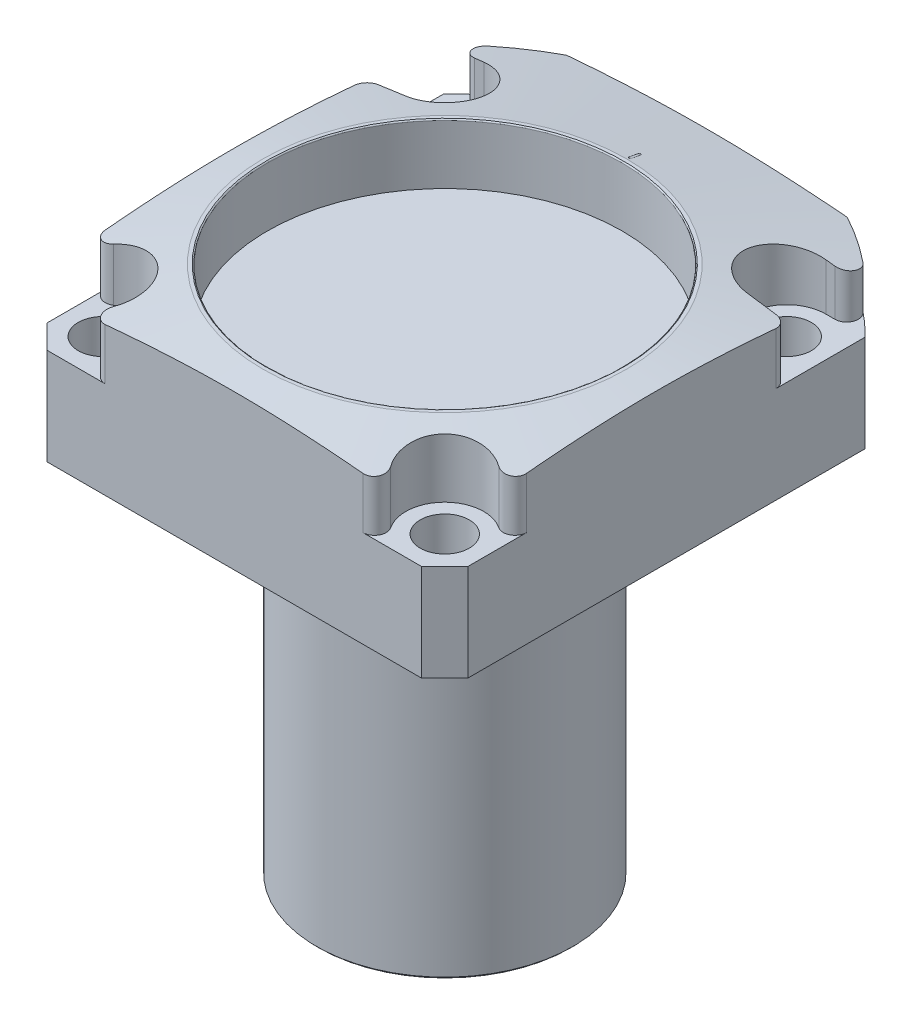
ISO-10303-21;
HEADER;
FILE_DESCRIPTION(('STEP AP214'),'2;1');
FILE_NAME('part.step','',(''),(''),'','','');
FILE_SCHEMA(('AUTOMOTIVE_DESIGN { 1 0 10303 214 1 1 1 1 }'));
ENDSEC;
DATA;
#1=APPLICATION_CONTEXT('core data for automotive mechanical design processes');
#2=APPLICATION_PROTOCOL_DEFINITION('international standard','automotive_design',2000,#1);
#3=PRODUCT_CONTEXT('',#1,'mechanical');
#4=PRODUCT('Part','Part','',(#3));
#5=PRODUCT_RELATED_PRODUCT_CATEGORY('part','',(#4));
#6=PRODUCT_DEFINITION_FORMATION('','',#4);
#7=PRODUCT_DEFINITION_CONTEXT('part definition',#1,'design');
#8=PRODUCT_DEFINITION('design','',#6,#7);
#9=PRODUCT_DEFINITION_SHAPE('','',#8);
#10=(LENGTH_UNIT() NAMED_UNIT(*) SI_UNIT(.MILLI.,.METRE.));
#11=(NAMED_UNIT(*) PLANE_ANGLE_UNIT() SI_UNIT($,.RADIAN.));
#12=(NAMED_UNIT(*) SI_UNIT($,.STERADIAN.) SOLID_ANGLE_UNIT());
#13=UNCERTAINTY_MEASURE_WITH_UNIT(LENGTH_MEASURE(1.E-05),#10,'distance_accuracy_value','');
#14=(GEOMETRIC_REPRESENTATION_CONTEXT(3) GLOBAL_UNCERTAINTY_ASSIGNED_CONTEXT((#13)) GLOBAL_UNIT_ASSIGNED_CONTEXT((#10,
#11,#12)) REPRESENTATION_CONTEXT('',''));
#15=CARTESIAN_POINT('',(0.,0.,0.));
#16=DIRECTION('',(0.,0.,1.));
#17=DIRECTION('',(1.,0.,0.));
#18=AXIS2_PLACEMENT_3D('',#15,#16,#17);
#19=CARTESIAN_POINT('',(-18.,0.876299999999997,-46.7614));
#20=DIRECTION('',(0.,1.,0.));
#21=DIRECTION('',(0.,0.,1.));
#22=AXIS2_PLACEMENT_3D('',#19,#20,#21);
#23=TOROIDAL_SURFACE('',#22,6.3373,1.7653);
#24=CARTESIAN_POINT('',(-18.,0.876299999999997,-38.6588));
#25=VERTEX_POINT('',#24);
#26=VERTEX_LOOP('',#25);
#27=FACE_BOUND('',#26,.T.);
#28=ADVANCED_FACE('F42',(#27),#23,.T.);
#29=CLOSED_SHELL('',(#28));
#30=MANIFOLD_SOLID_BREP('B2',#29);
#31=CARTESIAN_POINT('',(0.,29.7192952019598,0.));
#32=DIRECTION('',(0.,-1.,0.));
#33=DIRECTION('',(0.,0.,-1.));
#34=AXIS2_PLACEMENT_3D('',#31,#32,#33);
#35=CONICAL_SURFACE('',#34,63.5,1.39626340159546);
#36=CARTESIAN_POINT('',(-0.10217073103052,33.8916063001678,-39.8375169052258));
#37=CARTESIAN_POINT('',(-0.114985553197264,33.8925994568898,-39.8318516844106));
#38=CARTESIAN_POINT('',(-0.127300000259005,33.8937832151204,-39.8251003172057));
#39=CARTESIAN_POINT('',(-0.150599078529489,33.8964898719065,-39.8096686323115));
#40=CARTESIAN_POINT('',(-0.16158476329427,33.8980124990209,-39.8009898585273));
#41=CARTESIAN_POINT('',(-0.181923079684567,33.9013572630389,-39.7819328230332));
#42=CARTESIAN_POINT('',(-0.191275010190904,33.903179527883,-39.7715538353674));
#43=CARTESIAN_POINT('',(-0.208076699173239,33.9070708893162,-39.7494001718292));
#44=CARTESIAN_POINT('',(-0.215526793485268,33.9091399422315,-39.7376257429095));
#45=CARTESIAN_POINT('',(-0.228319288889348,33.9134678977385,-39.7130088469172));
#46=CARTESIAN_POINT('',(-0.233660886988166,33.915726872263,-39.7001659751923));
#47=CARTESIAN_POINT('',(-0.242083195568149,33.9203706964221,-39.6737785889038));
#48=CARTESIAN_POINT('',(-0.245163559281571,33.922755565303,-39.6602339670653));
#49=CARTESIAN_POINT('',(-0.24897818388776,33.9275867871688,-39.6328104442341));
#50=CARTESIAN_POINT('',(-0.249709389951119,33.9300332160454,-39.6189311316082));
#51=CARTESIAN_POINT('',(-0.248796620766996,33.9349151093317,-39.5912497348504));
#52=CARTESIAN_POINT('',(-0.247152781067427,33.9373505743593,-39.5774476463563));
#53=CARTESIAN_POINT('',(-0.241534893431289,33.9421427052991,-39.5503042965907));
#54=CARTESIAN_POINT('',(-0.237559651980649,33.9444993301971,-39.5369632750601));
#55=CARTESIAN_POINT('',(-0.227389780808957,33.9490651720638,-39.5111284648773));
#56=CARTESIAN_POINT('',(-0.22119510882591,33.9512743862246,-39.4986346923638));
#57=CARTESIAN_POINT('',(-0.206765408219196,33.9554806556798,-39.4748575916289));
#58=CARTESIAN_POINT('',(-0.198531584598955,33.9574778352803,-39.4635735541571));
#59=CARTESIAN_POINT('',(-0.180254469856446,33.9612038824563,-39.4425295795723));
#60=CARTESIAN_POINT('',(-0.170211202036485,33.9629327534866,-39.4327696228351));
#61=CARTESIAN_POINT('',(-0.148615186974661,33.9660698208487,-39.4150655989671));
#62=CARTESIAN_POINT('',(-0.137064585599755,33.9674784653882,-39.4071189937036));
#63=CARTESIAN_POINT('',(-0.112770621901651,33.969937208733,-39.393251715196));
#64=CARTESIAN_POINT('',(-0.100027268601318,33.9709873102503,-39.3873310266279));
#65=CARTESIAN_POINT('',(-0.0737317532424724,33.9726968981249,-39.3776934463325));
#66=CARTESIAN_POINT('',(-0.0601809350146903,33.973357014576,-39.3739729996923));
#67=CARTESIAN_POINT('',(-0.0326369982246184,33.9742699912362,-39.3688277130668));
#68=CARTESIAN_POINT('',(-0.0186438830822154,33.9745228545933,-39.3674028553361));
#69=CARTESIAN_POINT('',(0.00937087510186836,33.9746138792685,-39.3668899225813));
#70=CARTESIAN_POINT('',(0.0233924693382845,33.9744524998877,-39.3677992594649));
#71=CARTESIAN_POINT('',(0.0510814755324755,33.9737207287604,-39.3719231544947));
#72=CARTESIAN_POINT('',(0.0647488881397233,33.973150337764,-39.3751377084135));
#73=CARTESIAN_POINT('',(0.0913404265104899,33.9716172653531,-39.3837795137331));
#74=CARTESIAN_POINT('',(0.104264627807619,33.9706546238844,-39.3892065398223));
#75=CARTESIAN_POINT('',(0.129005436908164,33.9683650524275,-39.4021181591));
#76=CARTESIAN_POINT('',(0.140822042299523,33.9670381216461,-39.4096027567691));
#77=CARTESIAN_POINT('',(0.163024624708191,33.9640569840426,-39.4264241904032));
#78=CARTESIAN_POINT('',(0.173409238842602,33.9624024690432,-39.4357627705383));
#79=CARTESIAN_POINT('',(0.19244198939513,33.9588146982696,-39.4560219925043));
#80=CARTESIAN_POINT('',(0.20109010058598,33.9568814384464,-39.4669426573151));
#81=CARTESIAN_POINT('',(0.216418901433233,33.9527884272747,-39.490074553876));
#82=CARTESIAN_POINT('',(0.223096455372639,33.9506283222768,-39.5022878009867));
#83=CARTESIAN_POINT('',(0.234277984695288,33.9461460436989,-39.5276437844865));
#84=CARTESIAN_POINT('',(0.238781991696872,33.943823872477,-39.5407865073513));
#85=CARTESIAN_POINT('',(0.245495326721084,33.9390800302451,-39.5676495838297));
#86=CARTESIAN_POINT('',(0.247701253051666,33.9366582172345,-39.5813707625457));
#87=CARTESIAN_POINT('',(0.24974478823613,33.9317869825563,-39.6089846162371));
#88=CARTESIAN_POINT('',(0.249582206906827,33.9293375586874,-39.6228773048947));
#89=CARTESIAN_POINT('',(0.246891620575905,33.9244786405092,-39.6504509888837));
#90=CARTESIAN_POINT('',(0.244361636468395,33.9220691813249,-39.6641317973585));
#91=CARTESIAN_POINT('',(0.237005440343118,33.9173609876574,-39.690878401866));
#92=CARTESIAN_POINT('',(0.232179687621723,33.9150622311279,-39.7039443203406));
#93=CARTESIAN_POINT('',(0.220369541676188,33.9106407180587,-39.7290876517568));
#94=CARTESIAN_POINT('',(0.213385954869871,33.9085178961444,-39.7411654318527));
#95=CARTESIAN_POINT('',(0.197456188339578,33.9045064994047,-39.7639978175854));
#96=CARTESIAN_POINT('',(0.188509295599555,33.9026180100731,-39.7747519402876));
#97=CARTESIAN_POINT('',(0.167795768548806,33.8989334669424,-39.7957412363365));
#98=CARTESIAN_POINT('',(0.155825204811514,33.8971716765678,-39.8057821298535));
#99=CARTESIAN_POINT('',(0.130171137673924,33.8940617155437,-39.8235119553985));
#100=CARTESIAN_POINT('',(0.116484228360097,33.8927143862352,-39.8311961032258));
#101=CARTESIAN_POINT('',(0.102170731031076,33.8916063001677,-39.8375169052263));
#102=B_SPLINE_CURVE_WITH_KNOTS('',3,(#36,#37,#38,#39,#40,#41,#42,#43,#44,#45,#46,#47,#48,#49,
#50,#51,#52,#53,#54,#55,#56,#57,#58,#59,#60,#61,#62,#63,#64,#65,#66,#67,#68,#69,#70,#71,#72,#73,
#74,#75,#76,#77,#78,#79,#80,#81,#82,#83,#84,#85,#86,#87,#88,#89,#90,#91,#92,#93,#94,#95,#96,#97,
#98,#99,#100,#101),.UNSPECIFIED.,.F.,.F.,(4,2,2,2,2,2,2,2,2,2,2,2,2,2,2,2,2,2,2,2,2,2,2,2,2,2,2,
2,2,2,2,2,4),(0.,0.0420823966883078,0.0841312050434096,0.126198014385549,0.168257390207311,
0.210332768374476,0.252414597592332,0.294551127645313,0.336685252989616,0.378840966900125,
0.420997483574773,0.463129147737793,0.505260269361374,0.547332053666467,0.589403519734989,
0.631406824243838,0.673409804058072,0.715366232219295,0.757322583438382,0.799274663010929,
0.841226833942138,0.883218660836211,0.92521109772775,0.967270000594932,1.0093282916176,
1.0514487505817,1.09357259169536,1.13573167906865,1.17788233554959,1.22001725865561,
1.26216750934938,1.30905666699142,1.35604038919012),.UNSPECIFIED.);
#103=CARTESIAN_POINT('',(-0.249384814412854,33.9310643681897,-39.6130851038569));
#104=VERTEX_POINT('',#103);
#105=CARTESIAN_POINT('',(0.249384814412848,33.9310643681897,-39.6130851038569));
#106=VERTEX_POINT('',#105);
#107=EDGE_CURVE('E40',#104,#106,#102,.T.);
#108=ORIENTED_EDGE('',*,*,#107,.F.);
#109=CARTESIAN_POINT('',(-0.249406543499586,33.544309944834,-41.8065194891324));
#110=CARTESIAN_POINT('',(-0.249401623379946,33.6369207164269,-41.2812884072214));
#111=CARTESIAN_POINT('',(-0.249396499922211,33.7295314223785,-40.7560573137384));
#112=CARTESIAN_POINT('',(-0.249389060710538,33.8588681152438,-40.0225384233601));
#113=CARTESIAN_POINT('',(-0.249386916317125,33.8955941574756,-39.8142506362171));
#114=CARTESIAN_POINT('',(-0.249384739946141,33.9323201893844,-39.6059628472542));
#115=B_SPLINE_CURVE_WITH_KNOTS('',3,(#109,#110,#111,#112,#113,#114),.UNSPECIFIED.,.F.,.F.,(4,2,
4),(0.,1.60000000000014,2.23450251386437),.UNSPECIFIED.);
#116=CARTESIAN_POINT('',(-0.249404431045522,33.5837743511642,-41.5827017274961));
#117=VERTEX_POINT('',#116);
#118=EDGE_CURVE('E260',#117,#104,#115,.T.);
#119=ORIENTED_EDGE('',*,*,#118,.F.);
#120=CARTESIAN_POINT('',(0.249299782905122,33.5850304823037,-41.5755783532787));
#121=CARTESIAN_POINT('',(0.249718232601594,33.5825894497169,-41.5894196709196));
#122=CARTESIAN_POINT('',(0.248928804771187,33.5801442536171,-41.6032922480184));
#123=CARTESIAN_POINT('',(0.245009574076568,33.5753150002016,-41.6307041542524));
#124=CARTESIAN_POINT('',(0.241881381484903,33.5729309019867,-41.6442437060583));
#125=CARTESIAN_POINT('',(0.233358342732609,33.5682886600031,-41.6706201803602));
#126=CARTESIAN_POINT('',(0.227962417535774,33.5660305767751,-41.6834567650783));
#127=CARTESIAN_POINT('',(0.215060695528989,33.5617056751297,-41.7080533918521));
#128=CARTESIAN_POINT('',(0.207555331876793,33.5596388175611,-41.7198136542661));
#129=CARTESIAN_POINT('',(0.19064518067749,33.5557542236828,-41.7419252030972));
#130=CARTESIAN_POINT('',(0.181240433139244,33.5539364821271,-41.7522765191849));
#131=CARTESIAN_POINT('',(0.160796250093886,33.5506011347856,-41.7712760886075));
#132=CARTESIAN_POINT('',(0.149756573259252,33.5490835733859,-41.779924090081));
#133=CARTESIAN_POINT('',(0.12637481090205,33.5463938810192,-41.7952554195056));
#134=CARTESIAN_POINT('',(0.114034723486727,33.5452212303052,-41.8019417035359));
#135=CARTESIAN_POINT('',(0.0883896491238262,33.5432514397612,-41.8131750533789));
#136=CARTESIAN_POINT('',(0.0750847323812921,33.542454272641,-41.8177222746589));
#137=CARTESIAN_POINT('',(0.0479070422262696,33.5412586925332,-41.82454270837));
#138=CARTESIAN_POINT('',(0.0340350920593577,33.5408597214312,-41.8268191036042));
#139=CARTESIAN_POINT('',(0.00609978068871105,33.5404698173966,-41.8290437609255));
#140=CARTESIAN_POINT('',(-0.00796358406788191,33.5404788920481,-41.82899197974));
#141=CARTESIAN_POINT('',(-0.0358707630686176,33.5409046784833,-41.8265625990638));
#142=CARTESIAN_POINT('',(-0.0497147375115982,33.5413210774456,-41.8241867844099));
#143=CARTESIAN_POINT('',(-0.0768012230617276,33.5425493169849,-41.8171801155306));
#144=CARTESIAN_POINT('',(-0.0900437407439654,33.5433611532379,-41.8125492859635));
#145=CARTESIAN_POINT('',(-0.115555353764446,33.545357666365,-41.801163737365));
#146=CARTESIAN_POINT('',(-0.127824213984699,33.5465424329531,-41.7944085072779));
#147=CARTESIAN_POINT('',(-0.151037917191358,33.549251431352,-41.778967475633));
#148=CARTESIAN_POINT('',(-0.161982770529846,33.5507756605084,-41.7702816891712));
#149=CARTESIAN_POINT('',(-0.182250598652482,33.5541225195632,-41.75121702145));
#150=CARTESIAN_POINT('',(-0.191571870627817,33.5559454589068,-41.7408363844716));
#151=CARTESIAN_POINT('',(-0.208317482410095,33.55983783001,-41.7186811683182));
#152=CARTESIAN_POINT('',(-0.215741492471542,33.5619073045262,-41.7069063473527));
#153=CARTESIAN_POINT('',(-0.228494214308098,33.5662381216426,-41.6822767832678));
#154=CARTESIAN_POINT('',(-0.233818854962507,33.5684998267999,-41.669419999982));
#155=CARTESIAN_POINT('',(-0.242198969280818,33.5731472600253,-41.6430147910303));
#156=CARTESIAN_POINT('',(-0.2452566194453,33.5755328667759,-41.6294670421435));
#157=CARTESIAN_POINT('',(-0.248057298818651,33.5791188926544,-41.6091126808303));
#158=CARTESIAN_POINT('',(-0.248696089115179,33.5802992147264,-41.6024148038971));
#159=CARTESIAN_POINT('',(-0.249415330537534,33.5826633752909,-41.58900243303));
#160=CARTESIAN_POINT('',(-0.24949680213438,33.5838472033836,-41.5822879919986));
#161=CARTESIAN_POINT('',(-0.249299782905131,33.5850304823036,-41.575578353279));
#162=B_SPLINE_CURVE_WITH_KNOTS('',3,(#120,#121,#122,#123,#124,#125,#126,#127,#128,#129,#130,
#131,#132,#133,#134,#135,#136,#137,#138,#139,#140,#141,#142,#143,#144,#145,#146,#147,#148,#149,
#150,#151,#152,#153,#154,#155,#156,#157,#158,#159,#160,#161),.UNSPECIFIED.,.F.,.F.,(4,2,2,2,2,2,
2,2,2,2,2,2,2,2,2,2,2,2,2,2,4),(0.,0.042127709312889,0.0842264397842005,0.126345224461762,
0.168455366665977,0.210564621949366,0.252680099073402,0.294731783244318,0.336780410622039,
0.378770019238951,0.420760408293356,0.462718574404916,0.504676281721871,0.546644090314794,
0.588611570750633,0.63062280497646,0.672641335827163,0.714740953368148,0.756800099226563,
0.777273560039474,0.797709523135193),.UNSPECIFIED.);
#163=CARTESIAN_POINT('',(0.249404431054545,33.5837743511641,-41.5827017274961));
#164=VERTEX_POINT('',#163);
#165=EDGE_CURVE('E255',#164,#117,#162,.T.);
#166=ORIENTED_EDGE('',*,*,#165,.F.);
#167=CARTESIAN_POINT('',(0.249384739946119,33.9323201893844,-39.6059628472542));
#168=CARTESIAN_POINT('',(0.249390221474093,33.8397095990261,-40.1311939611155));
#169=CARTESIAN_POINT('',(0.249395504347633,33.7470989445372,-40.6564250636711));
#170=CARTESIAN_POINT('',(0.249402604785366,33.6177621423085,-41.3899439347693));
#171=CARTESIAN_POINT('',(0.249404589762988,33.5810360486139,-41.5982317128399));
#172=CARTESIAN_POINT('',(0.249406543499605,33.544309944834,-41.8065194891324));
#173=B_SPLINE_CURVE_WITH_KNOTS('',3,(#167,#168,#169,#170,#171,#172),.UNSPECIFIED.,.F.,.F.,(4,2,
4),(0.,1.60000000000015,2.23450251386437),.UNSPECIFIED.);
#174=EDGE_CURVE('E69',#106,#164,#173,.T.);
#175=ORIENTED_EDGE('',*,*,#174,.F.);
#176=EDGE_LOOP('',(#108,#119,#166,#175));
#177=FACE_BOUND('',#176,.T.);
#178=CARTESIAN_POINT('',(56.2837169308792,28.2254718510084,-44.8564000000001));
#179=CARTESIAN_POINT('',(54.7254730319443,28.4403020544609,-44.8564000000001));
#180=CARTESIAN_POINT('',(53.1667633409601,28.6518059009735,-44.8564000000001));
#181=CARTESIAN_POINT('',(50.0482663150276,29.0668445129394,-44.8564000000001));
#182=CARTESIAN_POINT('',(48.4884789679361,29.2703791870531,-44.8564000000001));
#183=CARTESIAN_POINT('',(45.3681691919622,29.6681003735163,-44.8564000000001));
#184=CARTESIAN_POINT('',(43.8076471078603,29.8622895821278,-44.8564000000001));
#185=CARTESIAN_POINT('',(40.6852788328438,30.2397599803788,-44.8564000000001));
#186=CARTESIAN_POINT('',(39.1234326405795,30.4230411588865,-44.8564000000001));
#187=CARTESIAN_POINT('',(35.9980221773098,30.7768452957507,-44.8564000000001));
#188=CARTESIAN_POINT('',(34.4344576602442,30.947366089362,-44.8564000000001));
#189=CARTESIAN_POINT('',(31.305782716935,31.2734442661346,-44.8564000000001));
#190=CARTESIAN_POINT('',(29.7406723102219,31.4290018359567,-44.8564000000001));
#191=CARTESIAN_POINT('',(26.6083658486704,31.7227709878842,-44.8564000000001));
#192=CARTESIAN_POINT('',(25.0411693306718,31.860977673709,-44.8564000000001));
#193=CARTESIAN_POINT('',(21.9050705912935,32.117359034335,-44.8564000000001));
#194=CARTESIAN_POINT('',(20.3361682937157,32.2355327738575,-44.8564000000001));
#195=CARTESIAN_POINT('',(18.766456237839,32.3423659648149,-44.8564000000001));
#196=B_SPLINE_CURVE_WITH_KNOTS('',3,(#178,#179,#180,#181,#182,#183,#184,#185,#186,#187,#188,
#189,#190,#191,#192,#193,#194,#195),.UNSPECIFIED.,.F.,.F.,(4,2,2,2,2,2,2,2,4),(0.,
4.71895657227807,9.43796721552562,14.1556081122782,18.8732538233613,23.5916980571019,
28.3100834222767,33.0297972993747,37.7497314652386),.UNSPECIFIED.);
#197=CARTESIAN_POINT('',(38.4800191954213,30.4951361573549,-44.8564000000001));
#198=VERTEX_POINT('',#197);
#199=CARTESIAN_POINT('',(36.5251999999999,30.7162065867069,-44.8564000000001));
#200=VERTEX_POINT('',#199);
#201=EDGE_CURVE('E702',#198,#200,#196,.T.);
#202=ORIENTED_EDGE('',*,*,#201,.F.);
#203=CARTESIAN_POINT('',(38.4800191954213,30.4951361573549,-44.8564000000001));
#204=CARTESIAN_POINT('',(38.5506887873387,30.4870237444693,-44.8563932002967));
#205=CARTESIAN_POINT('',(38.6213055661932,30.4784999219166,-44.8594094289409));
#206=CARTESIAN_POINT('',(38.7619264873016,30.4607041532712,-44.8714101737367));
#207=CARTESIAN_POINT('',(38.8319307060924,30.451432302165,-44.8803939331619));
#208=CARTESIAN_POINT('',(38.9707558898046,30.4322243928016,-44.9042379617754));
#209=CARTESIAN_POINT('',(39.0395781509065,30.4222891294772,-44.9190912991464));
#210=CARTESIAN_POINT('',(39.1756203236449,30.4018273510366,-44.9545325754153));
#211=CARTESIAN_POINT('',(39.2428402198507,30.3913008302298,-44.9751205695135));
#212=CARTESIAN_POINT('',(39.4414033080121,30.358951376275,-45.045269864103));
#213=CARTESIAN_POINT('',(39.5697629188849,30.336342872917,-45.1032360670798));
#214=CARTESIAN_POINT('',(39.8146450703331,30.2897580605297,-45.2397575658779));
#215=CARTESIAN_POINT('',(39.9311676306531,30.265781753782,-45.3183128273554));
#216=CARTESIAN_POINT('',(40.1503754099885,30.2168956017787,-45.4946560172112));
#217=CARTESIAN_POINT('',(40.2529137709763,30.191978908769,-45.5926249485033));
#218=CARTESIAN_POINT('',(40.4399174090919,30.1421451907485,-45.8045312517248));
#219=CARTESIAN_POINT('',(40.5243800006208,30.1172281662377,-45.9184709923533));
#220=CARTESIAN_POINT('',(40.673225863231,30.0679556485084,-46.1597825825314));
#221=CARTESIAN_POINT('',(40.7374984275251,30.0436039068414,-46.2872235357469));
#222=CARTESIAN_POINT('',(40.8434174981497,29.9962815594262,-46.5514221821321));
#223=CARTESIAN_POINT('',(40.8850652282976,29.9733108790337,-46.6881793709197));
#224=CARTESIAN_POINT('',(40.9442718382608,29.9294870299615,-46.966489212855));
#225=CARTESIAN_POINT('',(40.9619378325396,29.9086248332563,-47.1080176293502));
#226=CARTESIAN_POINT('',(40.9728422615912,29.8694833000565,-47.3923642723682));
#227=CARTESIAN_POINT('',(40.9660834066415,29.8512036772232,-47.5351823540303));
#228=CARTESIAN_POINT('',(40.9283901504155,29.8179460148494,-47.8161836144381));
#229=CARTESIAN_POINT('',(40.8977522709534,29.8029303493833,-47.9544021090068));
#230=CARTESIAN_POINT('',(40.8133562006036,29.7763358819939,-48.2240099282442));
#231=CARTESIAN_POINT('',(40.7595907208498,29.7647581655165,-48.3553970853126));
#232=CARTESIAN_POINT('',(40.631285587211,29.7455073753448,-48.6056366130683));
#233=CARTESIAN_POINT('',(40.5570348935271,29.7377839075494,-48.7246337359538));
#234=CARTESIAN_POINT('',(40.3895759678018,29.7262372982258,-48.9484627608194));
#235=CARTESIAN_POINT('',(40.2964043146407,29.7224067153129,-49.0533213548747));
#236=CARTESIAN_POINT('',(40.1718609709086,29.7201439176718,-49.171753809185));
#237=CARTESIAN_POINT('',(40.1480421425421,29.7198254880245,-49.1935344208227));
#238=CARTESIAN_POINT('',(40.0996082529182,29.719401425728,-49.2361243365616));
#239=CARTESIAN_POINT('',(40.0749943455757,29.7192954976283,-49.256934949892));
#240=CARTESIAN_POINT('',(40.0499783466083,29.7192952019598,-49.277268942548));
#241=B_SPLINE_CURVE_WITH_KNOTS('',3,(#203,#204,#205,#206,#207,#208,#209,#210,#211,#212,#213,
#214,#215,#216,#217,#218,#219,#220,#221,#222,#223,#224,#225,#226,#227,#228,#229,#230,#231,#232,
#233,#234,#235,#236,#237,#238,#239,#240),.UNSPECIFIED.,.F.,.F.,(4,2,2,2,2,2,2,2,2,2,2,2,2,2,2,2,
2,2,4),(0.,0.2133267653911,0.426626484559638,0.639675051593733,0.852725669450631,
1.27848394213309,1.70424150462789,2.13417310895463,2.56416854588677,2.99648217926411,
3.42877242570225,3.85912542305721,4.28943066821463,4.71447603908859,5.13965546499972,
5.55911964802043,5.97778049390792,6.07459930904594,6.17128341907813),.UNSPECIFIED.);
#242=CARTESIAN_POINT('',(40.0499783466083,29.7192952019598,-49.277268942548));
#243=VERTEX_POINT('',#242);
#244=EDGE_CURVE('E839',#198,#243,#241,.T.);
#245=ORIENTED_EDGE('',*,*,#244,.T.);
#246=CARTESIAN_POINT('',(0.,29.7192952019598,0.));
#247=DIRECTION('',(0.,-1.,0.));
#248=DIRECTION('',(0.,0.,-1.));
#249=AXIS2_PLACEMENT_3D('',#246,#247,#248);
#250=CIRCLE('',#249,63.5);
#251=CARTESIAN_POINT('',(29.9718277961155,29.7192952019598,-55.9816));
#252=VERTEX_POINT('',#251);
#253=EDGE_CURVE('E466',#252,#243,#250,.T.);
#254=ORIENTED_EDGE('',*,*,#253,.F.);
#255=CARTESIAN_POINT('',(-98.769265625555,20.8974649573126,-55.9816));
#256=CARTESIAN_POINT('',(-97.412355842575,21.1056120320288,-55.9816));
#257=CARTESIAN_POINT('',(-96.0552908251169,21.3127466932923,-55.9816));
#258=CARTESIAN_POINT('',(-93.3408189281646,21.724771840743,-55.9816));
#259=CARTESIAN_POINT('',(-91.9834120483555,21.9296623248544,-55.9816));
#260=CARTESIAN_POINT('',(-87.9106055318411,22.5406423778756,-55.9816));
#261=CARTESIAN_POINT('',(-85.1946497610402,22.9430359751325,-55.9816));
#262=CARTESIAN_POINT('',(-79.7605886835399,23.7358357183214,-55.9816));
#263=CARTESIAN_POINT('',(-77.0424831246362,24.126240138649,-55.9816));
#264=CARTESIAN_POINT('',(-71.604179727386,24.8921938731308,-55.9816));
#265=CARTESIAN_POINT('',(-68.8839818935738,25.267743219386,-55.9816));
#266=CARTESIAN_POINT('',(-63.448716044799,25.9993740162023,-55.9816));
#267=CARTESIAN_POINT('',(-60.7336549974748,26.355507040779,-55.9816));
#268=CARTESIAN_POINT('',(-55.3006122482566,27.044897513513,-55.9816));
#269=CARTESIAN_POINT('',(-52.5826305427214,27.3781549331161,-55.9816));
#270=CARTESIAN_POINT('',(-47.1429977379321,28.0161087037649,-55.9816));
#271=CARTESIAN_POINT('',(-44.421346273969,28.3208019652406,-55.9816));
#272=CARTESIAN_POINT('',(-38.9742469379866,28.8945382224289,-55.9816));
#273=CARTESIAN_POINT('',(-36.2487990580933,29.1635811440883,-55.9816));
#274=CARTESIAN_POINT('',(-30.7797960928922,29.658985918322,-55.9816));
#275=CARTESIAN_POINT('',(-28.0362201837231,29.885120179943,-55.9816));
#276=CARTESIAN_POINT('',(-22.5450981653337,30.283716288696,-55.9816));
#277=CARTESIAN_POINT('',(-19.7975520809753,30.4561784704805,-55.9816));
#278=CARTESIAN_POINT('',(-15.6743539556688,30.6679954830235,-55.9816));
#279=CARTESIAN_POINT('',(-14.2998848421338,30.7307814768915,-55.9816));
#280=CARTESIAN_POINT('',(-11.5502843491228,30.839846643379,-55.9816));
#281=CARTESIAN_POINT('',(-10.1751529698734,30.8861258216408,-55.9816));
#282=CARTESIAN_POINT('',(-7.42442631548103,30.961442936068,-55.9816));
#283=CARTESIAN_POINT('',(-6.04883104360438,30.9904809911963,-55.9816));
#284=CARTESIAN_POINT('',(-3.29737906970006,31.0308388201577,-55.9816));
#285=CARTESIAN_POINT('',(-1.92152236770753,31.0421585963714,-55.9816));
#286=CARTESIAN_POINT('',(0.832515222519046,31.0468915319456,-55.9816));
#287=CARTESIAN_POINT('',(2.21069616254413,31.0402748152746,-55.9816));
#288=CARTESIAN_POINT('',(4.96685516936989,31.0091843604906,-55.9816));
#289=CARTESIAN_POINT('',(6.34483323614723,30.9847106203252,-55.9816));
#290=CARTESIAN_POINT('',(9.10037723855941,30.9183129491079,-55.9816));
#291=CARTESIAN_POINT('',(10.4779431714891,30.8763889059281,-55.9816));
#292=CARTESIAN_POINT('',(13.2324531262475,30.7757687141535,-55.9816));
#293=CARTESIAN_POINT('',(14.6093971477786,30.7170725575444,-55.9816));
#294=CARTESIAN_POINT('',(18.7401155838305,30.5170640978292,-55.9816));
#295=CARTESIAN_POINT('',(21.4927655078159,30.3518573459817,-55.9816));
#296=CARTESIAN_POINT('',(25.6187331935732,30.0627607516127,-55.9816));
#297=CARTESIAN_POINT('',(26.9935614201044,29.9595135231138,-55.9816));
#298=CARTESIAN_POINT('',(29.7422227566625,29.7404362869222,-55.9816));
#299=CARTESIAN_POINT('',(31.1160558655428,29.6246062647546,-55.9816));
#300=CARTESIAN_POINT('',(34.1822655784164,29.3532264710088,-55.9816));
#301=CARTESIAN_POINT('',(35.8743783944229,29.194705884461,-55.9816));
#302=CARTESIAN_POINT('',(39.25710605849,28.862348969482,-55.9816));
#303=CARTESIAN_POINT('',(40.9477208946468,28.6885125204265,-55.9816));
#304=CARTESIAN_POINT('',(44.327569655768,28.3274167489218,-55.9816));
#305=CARTESIAN_POINT('',(46.0168035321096,28.1401569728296,-55.9816));
#306=CARTESIAN_POINT('',(49.3939245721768,27.7539283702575,-55.9816));
#307=CARTESIAN_POINT('',(51.0818117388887,27.5549595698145,-55.9816));
#308=CARTESIAN_POINT('',(54.4565936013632,27.146792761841,-55.9816));
#309=CARTESIAN_POINT('',(56.1434881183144,26.9375932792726,-55.9816));
#310=CARTESIAN_POINT('',(59.516150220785,26.5103101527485,-55.9816));
#311=CARTESIAN_POINT('',(61.2019178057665,26.2922265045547,-55.9816));
#312=CARTESIAN_POINT('',(64.5724037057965,25.8483231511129,-55.9816));
#313=CARTESIAN_POINT('',(66.2571220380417,25.6225035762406,-55.9816));
#314=CARTESIAN_POINT('',(69.6256395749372,25.1641033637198,-55.9816));
#315=CARTESIAN_POINT('',(71.309438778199,24.9315227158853,-55.9816));
#316=CARTESIAN_POINT('',(76.3613624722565,24.2246969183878,-55.9816));
#317=CARTESIAN_POINT('',(79.7282495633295,23.7416020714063,-55.9816));
#318=CARTESIAN_POINT('',(86.459365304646,22.7572622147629,-55.9816));
#319=CARTESIAN_POINT('',(89.8235939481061,22.2560171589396,-55.9816));
#320=CARTESIAN_POINT('',(96.5496102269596,21.2393824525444,-55.9816));
#321=CARTESIAN_POINT('',(99.9113980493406,20.7239940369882,-55.9816));
#322=CARTESIAN_POINT('',(106.633227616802,19.6819983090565,-55.9816));
#323=CARTESIAN_POINT('',(109.993269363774,19.155391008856,-55.9816));
#324=CARTESIAN_POINT('',(116.697998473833,18.0953895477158,-55.9816));
#325=CARTESIAN_POINT('',(120.042691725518,17.5620325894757,-55.9816));
#326=CARTESIAN_POINT('',(126.730916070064,16.4880844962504,-55.9816));
#327=CARTESIAN_POINT('',(130.074447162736,15.9474933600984,-55.9816));
#328=CARTESIAN_POINT('',(136.760628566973,14.8603614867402,-55.9816));
#329=CARTESIAN_POINT('',(140.103278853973,14.313820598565,-55.9816));
#330=CARTESIAN_POINT('',(146.787771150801,13.2158174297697,-55.9816));
#331=CARTESIAN_POINT('',(150.129613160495,12.6643551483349,-55.9816));
#332=CARTESIAN_POINT('',(156.80802731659,11.5580717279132,-55.9816));
#333=CARTESIAN_POINT('',(160.144600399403,11.0032562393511,-55.9816));
#334=CARTESIAN_POINT('',(166.817167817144,9.89015515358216,-55.9816));
#335=CARTESIAN_POINT('',(170.153162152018,9.33186955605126,-55.9816));
#336=CARTESIAN_POINT('',(176.824548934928,8.21236600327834,-55.9816));
#337=CARTESIAN_POINT('',(180.159941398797,7.65114814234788,-55.9816));
#338=CARTESIAN_POINT('',(186.830295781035,6.52616695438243,-55.9816));
#339=CARTESIAN_POINT('',(190.165257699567,5.962403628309,-55.9816));
#340=CARTESIAN_POINT('',(193.500037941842,5.39756965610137,-55.9816));
#341=B_SPLINE_CURVE_WITH_KNOTS('',3,(#255,#256,#257,#258,#259,#260,#261,#262,#263,#264,#265,
#266,#267,#268,#269,#270,#271,#272,#273,#274,#275,#276,#277,#278,#279,#280,#281,#282,#283,#284,
#285,#286,#287,#288,#289,#290,#291,#292,#293,#294,#295,#296,#297,#298,#299,#300,#301,#302,#303,
#304,#305,#306,#307,#308,#309,#310,#311,#312,#313,#314,#315,#316,#317,#318,#319,#320,#321,#322,
#323,#324,#325,#326,#327,#328,#329,#330,#331,#332,#333,#334,#335,#336,#337,#338,#339,#340),
.UNSPECIFIED.,.F.,.F.,(4,2,2,2,2,2,2,2,2,2,2,2,2,2,2,2,2,2,2,2,2,2,2,2,2,2,2,2,2,2,2,2,2,2,2,2,
2,2,2,2,2,2,4),(0.,4.11834412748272,8.23669206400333,16.4734782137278,24.7114443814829,
32.9493927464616,41.164270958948,49.3791594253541,57.5949354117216,65.8107284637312,
74.0689499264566,82.3271198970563,86.4547440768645,90.5823668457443,94.7099611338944,
98.8375548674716,102.972027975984,107.106501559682,111.241001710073,115.375503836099,
123.647540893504,127.783600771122,131.919665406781,137.018150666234,142.116676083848,
147.215373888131,152.314060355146,157.413484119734,162.512910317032,167.612250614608,
172.711598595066,182.915631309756,193.119689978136,203.322860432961,213.52601981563,
223.686865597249,233.84771301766,244.008818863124,254.169926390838,264.317084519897,
274.46424359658,284.61107829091,294.757909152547),.UNSPECIFIED.);
#342=CARTESIAN_POINT('',(-29.9718277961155,29.7192952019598,-55.9816));
#343=VERTEX_POINT('',#342);
#344=EDGE_CURVE('E531',#252,#343,#341,.F.);
#345=ORIENTED_EDGE('',*,*,#344,.T.);
#346=CARTESIAN_POINT('',(-40.0499783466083,29.7192952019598,-49.277268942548));
#347=VERTEX_POINT('',#346);
#348=EDGE_CURVE('E465',#347,#343,#250,.T.);
#349=ORIENTED_EDGE('',*,*,#348,.F.);
#350=CARTESIAN_POINT('',(-40.0499783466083,29.7192952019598,-49.277268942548));
#351=CARTESIAN_POINT('',(-40.1037526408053,29.7192941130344,-49.2335733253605));
#352=CARTESIAN_POINT('',(-40.1556904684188,29.719785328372,-49.1876236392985));
#353=CARTESIAN_POINT('',(-40.2555449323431,29.7217439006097,-49.0915710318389));
#354=CARTESIAN_POINT('',(-40.3034618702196,29.7232111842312,-49.0414684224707));
#355=CARTESIAN_POINT('',(-40.3948848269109,29.7271113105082,-48.93751465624));
#356=CARTESIAN_POINT('',(-40.4383955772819,29.7295431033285,-48.8836676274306));
#357=CARTESIAN_POINT('',(-40.5207550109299,29.735352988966,-48.772590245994));
#358=CARTESIAN_POINT('',(-40.5596037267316,29.7387310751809,-48.7153599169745));
#359=CARTESIAN_POINT('',(-40.6687635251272,29.7502571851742,-48.539150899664));
#360=CARTESIAN_POINT('',(-40.7317393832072,29.7597992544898,-48.415595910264));
#361=CARTESIAN_POINT('',(-40.8362350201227,29.7823255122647,-48.1601178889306));
#362=CARTESIAN_POINT('',(-40.8777568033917,29.7953093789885,-48.0281956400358));
#363=CARTESIAN_POINT('',(-40.9385851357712,29.8244619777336,-47.758806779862));
#364=CARTESIAN_POINT('',(-40.9577565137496,29.8406494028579,-47.6213115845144));
#365=CARTESIAN_POINT('',(-40.9730537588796,29.8757271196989,-47.3453760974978));
#366=CARTESIAN_POINT('',(-40.9691750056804,29.8946179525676,-47.2069356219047));
#367=CARTESIAN_POINT('',(-40.9384352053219,29.9348701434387,-46.9310890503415));
#368=CARTESIAN_POINT('',(-40.9112686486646,29.9562610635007,-46.7937213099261));
#369=CARTESIAN_POINT('',(-40.834451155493,30.0007325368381,-46.5257207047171));
#370=CARTESIAN_POINT('',(-40.7847998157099,30.0238131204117,-46.3950879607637));
#371=CARTESIAN_POINT('',(-40.6636726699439,30.0713687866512,-46.1424107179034));
#372=CARTESIAN_POINT('',(-40.5919126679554,30.0958584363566,-46.0205051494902));
#373=CARTESIAN_POINT('',(-40.4288771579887,30.1452712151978,-45.7906315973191));
#374=CARTESIAN_POINT('',(-40.3376013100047,30.1701943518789,-45.6826638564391));
#375=CARTESIAN_POINT('',(-40.137319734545,30.2199715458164,-45.4829060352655));
#376=CARTESIAN_POINT('',(-40.0281836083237,30.2448236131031,-45.3912461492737));
#377=CARTESIAN_POINT('',(-39.7956920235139,30.2935545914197,-45.2277428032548));
#378=CARTESIAN_POINT('',(-39.6723313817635,30.3174331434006,-45.1559065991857));
#379=CARTESIAN_POINT('',(-39.415041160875,30.3634658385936,-45.0343028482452));
#380=CARTESIAN_POINT('',(-39.2811213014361,30.3856215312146,-44.9845152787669));
#381=CARTESIAN_POINT('',(-39.0065188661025,30.4275200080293,-44.9085663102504));
#382=CARTESIAN_POINT('',(-38.865848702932,30.4472670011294,-44.8823631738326));
#383=CARTESIAN_POINT('',(-38.6834450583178,30.4706803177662,-44.8643896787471));
#384=CARTESIAN_POINT('',(-38.6428067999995,30.4757585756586,-44.8613932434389));
#385=CARTESIAN_POINT('',(-38.5614626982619,30.4856476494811,-44.8574011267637));
#386=CARTESIAN_POINT('',(-38.5207570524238,30.4904588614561,-44.8564024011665));
#387=CARTESIAN_POINT('',(-38.4800191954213,30.4951361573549,-44.8564000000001));
#388=B_SPLINE_CURVE_WITH_KNOTS('',3,(#350,#351,#352,#353,#354,#355,#356,#357,#358,#359,#360,
#361,#362,#363,#364,#365,#366,#367,#368,#369,#370,#371,#372,#373,#374,#375,#376,#377,#378,#379,
#380,#381,#382,#383,#384,#385,#386,#387),.UNSPECIFIED.,.F.,.F.,(4,2,2,2,2,2,2,2,2,2,2,2,2,2,2,2,
2,2,4),(0.,0.207798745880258,0.415581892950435,0.623139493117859,0.830695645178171,
1.24557823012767,1.66042204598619,2.07776195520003,2.49518552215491,2.91817051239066,
3.34116308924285,3.76983746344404,4.19851930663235,4.63048337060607,5.06260533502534,
5.49433407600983,5.92529727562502,6.04845585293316,6.17142661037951),.UNSPECIFIED.);
#389=CARTESIAN_POINT('',(-38.4800191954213,30.4951361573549,-44.8564000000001));
#390=VERTEX_POINT('',#389);
#391=EDGE_CURVE('E846',#347,#390,#388,.T.);
#392=ORIENTED_EDGE('',*,*,#391,.T.);
#393=CARTESIAN_POINT('',(-25.0528460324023,31.856657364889,-44.8564000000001));
#394=CARTESIAN_POINT('',(-26.6201576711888,31.7218619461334,-44.8564000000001));
#395=CARTESIAN_POINT('',(-28.1866240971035,31.5775734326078,-44.8564000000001));
#396=CARTESIAN_POINT('',(-31.3178926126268,31.2724104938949,-44.8564000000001));
#397=CARTESIAN_POINT('',(-32.8826947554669,31.1115366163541,-44.8564000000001));
#398=CARTESIAN_POINT('',(-36.0104723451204,30.7756253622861,-44.8564000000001));
#399=CARTESIAN_POINT('',(-37.5734480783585,30.6005906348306,-44.8564000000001));
#400=CARTESIAN_POINT('',(-40.6980033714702,30.2383892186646,-44.8564000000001));
#401=CARTESIAN_POINT('',(-42.2595829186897,30.0512224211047,-44.8564000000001));
#402=CARTESIAN_POINT('',(-45.381286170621,29.6665747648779,-44.8564000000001));
#403=CARTESIAN_POINT('',(-46.9414100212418,29.4690950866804,-44.8564000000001));
#404=CARTESIAN_POINT('',(-50.0605126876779,29.0653231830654,-44.8564000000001));
#405=CARTESIAN_POINT('',(-51.6194915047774,28.8590309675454,-44.8564000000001));
#406=CARTESIAN_POINT('',(-54.7367331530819,28.4388907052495,-44.8564000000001));
#407=CARTESIAN_POINT('',(-56.2949957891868,28.2250412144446,-44.8564000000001));
#408=CARTESIAN_POINT('',(-59.4106089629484,27.7908706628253,-44.8564000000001));
#409=CARTESIAN_POINT('',(-60.9679595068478,27.5705496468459,-44.8564000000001));
#410=CARTESIAN_POINT('',(-62.5249166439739,27.3475147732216,-44.8564000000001));
#411=B_SPLINE_CURVE_WITH_KNOTS('',3,(#393,#394,#395,#396,#397,#398,#399,#400,#401,#402,#403,
#404,#405,#406,#407,#408,#409,#410),.UNSPECIFIED.,.F.,.F.,(4,2,2,2,2,2,2,2,4),(0.,
4.71922199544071,9.43828821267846,14.1564736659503,18.8747014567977,23.5923903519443,
28.3100739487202,33.0286639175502,37.747221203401),.UNSPECIFIED.);
#412=CARTESIAN_POINT('',(-36.5251999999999,30.7162065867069,-44.8564000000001));
#413=VERTEX_POINT('',#412);
#414=EDGE_CURVE('E637',#413,#390,#411,.T.);
#415=ORIENTED_EDGE('',*,*,#414,.F.);
#416=CARTESIAN_POINT('',(-36.5253999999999,32.7801273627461,-28.1940000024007));
#417=CARTESIAN_POINT('',(-36.2940284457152,32.812425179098,-28.1939706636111));
#418=CARTESIAN_POINT('',(-36.0624930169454,32.8435885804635,-28.2036264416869));
#419=CARTESIAN_POINT('',(-35.6006898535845,32.9033462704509,-28.2422198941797));
#420=CARTESIAN_POINT('',(-35.3704221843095,32.9319404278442,-28.2711585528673));
#421=CARTESIAN_POINT('',(-34.9127795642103,32.9862553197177,-28.3482284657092));
#422=CARTESIAN_POINT('',(-34.6854045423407,33.0119761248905,-28.3963592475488));
#423=CARTESIAN_POINT('',(-34.2351654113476,33.0602617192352,-28.5115478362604));
#424=CARTESIAN_POINT('',(-34.0123011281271,33.0828266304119,-28.5786049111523));
#425=CARTESIAN_POINT('',(-33.5724638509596,33.124562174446,-28.731324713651));
#426=CARTESIAN_POINT('',(-33.3554968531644,33.1437294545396,-28.8170056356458));
#427=CARTESIAN_POINT('',(-32.9292673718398,33.1784125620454,-29.0063872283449));
#428=CARTESIAN_POINT('',(-32.7200049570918,33.1939283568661,-29.1100880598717));
#429=CARTESIAN_POINT('',(-32.3108297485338,33.2211091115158,-29.3347600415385));
#430=CARTESIAN_POINT('',(-32.1109126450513,33.2327758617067,-29.455723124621));
#431=CARTESIAN_POINT('',(-31.721814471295,33.2521194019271,-29.7141120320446));
#432=CARTESIAN_POINT('',(-31.5326332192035,33.2597962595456,-29.8515375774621));
#433=CARTESIAN_POINT('',(-31.1687139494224,33.2709897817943,-30.1400459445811));
#434=CARTESIAN_POINT('',(-30.993824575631,33.2745574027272,-30.2909359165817));
#435=CARTESIAN_POINT('',(-30.6571590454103,33.277659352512,-30.606732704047));
#436=CARTESIAN_POINT('',(-30.4953827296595,33.2771937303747,-30.7716393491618));
#437=CARTESIAN_POINT('',(-30.186080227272,33.2722348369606,-31.1143094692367));
#438=CARTESIAN_POINT('',(-30.0385564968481,33.2677408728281,-31.292075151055));
#439=CARTESIAN_POINT('',(-29.7588377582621,33.2547819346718,-31.6591460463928));
#440=CARTESIAN_POINT('',(-29.6266427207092,33.2463169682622,-31.8484512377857));
#441=CARTESIAN_POINT('',(-29.3793172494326,33.2255916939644,-32.2359418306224));
#442=CARTESIAN_POINT('',(-29.2640801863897,33.2133567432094,-32.4340605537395));
#443=CARTESIAN_POINT('',(-29.0503697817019,33.1852184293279,-32.8389780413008));
#444=CARTESIAN_POINT('',(-28.951902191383,33.1693138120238,-33.0457797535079));
#445=CARTESIAN_POINT('',(-28.7724320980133,33.1340318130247,-33.466479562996));
#446=CARTESIAN_POINT('',(-28.6914253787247,33.1146552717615,-33.6803759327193));
#447=CARTESIAN_POINT('',(-28.547337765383,33.0726486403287,-34.113816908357));
#448=CARTESIAN_POINT('',(-28.4842574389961,33.0500184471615,-34.333361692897));
#449=CARTESIAN_POINT('',(-28.3758558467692,33.0015183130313,-34.7787398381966));
#450=CARTESIAN_POINT('',(-28.3307141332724,32.9756188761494,-35.004613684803));
#451=CARTESIAN_POINT('',(-28.2593064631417,32.9210348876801,-35.4589960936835));
#452=CARTESIAN_POINT('',(-28.2330410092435,32.8923502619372,-35.6875047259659));
#453=CARTESIAN_POINT('',(-28.1994865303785,32.8324921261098,-36.1455667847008));
#454=CARTESIAN_POINT('',(-28.1921960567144,32.8013188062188,-36.3751201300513));
#455=CARTESIAN_POINT('',(-28.1965581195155,32.736773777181,-36.8338112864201));
#456=CARTESIAN_POINT('',(-28.2082169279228,32.7034013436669,-37.0629489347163));
#457=CARTESIAN_POINT('',(-28.2507287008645,32.6341388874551,-37.5234307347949));
#458=CARTESIAN_POINT('',(-28.2819330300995,32.5982136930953,-37.7547371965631));
#459=CARTESIAN_POINT('',(-28.3635652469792,32.5247362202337,-38.213671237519));
#460=CARTESIAN_POINT('',(-28.413993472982,32.4871839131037,-38.4412987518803));
#461=CARTESIAN_POINT('',(-28.5336832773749,32.4107662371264,-38.8913760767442));
#462=CARTESIAN_POINT('',(-28.6029490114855,32.3719005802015,-39.1138247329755));
#463=CARTESIAN_POINT('',(-28.75976566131,32.2931927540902,-39.5519205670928));
#464=CARTESIAN_POINT('',(-28.8473109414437,32.2533508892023,-39.767569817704));
#465=CARTESIAN_POINT('',(-29.0416566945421,32.1723262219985,-40.1941655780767));
#466=CARTESIAN_POINT('',(-29.14874977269,32.1311321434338,-40.4049766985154));
#467=CARTESIAN_POINT('',(-29.3804185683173,32.0483547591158,-40.8166780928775));
#468=CARTESIAN_POINT('',(-29.5049940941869,32.006771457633,-41.0175684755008));
#469=CARTESIAN_POINT('',(-29.7707498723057,31.9235159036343,-41.4080341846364));
#470=CARTESIAN_POINT('',(-29.9119304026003,31.8818436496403,-41.5976093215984));
#471=CARTESIAN_POINT('',(-30.2099042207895,31.7987012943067,-41.9641070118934));
#472=CARTESIAN_POINT('',(-30.3666972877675,31.7572311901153,-42.1410297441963));
#473=CARTESIAN_POINT('',(-30.6959180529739,31.6744907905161,-42.4821225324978));
#474=CARTESIAN_POINT('',(-30.86844423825,31.6332237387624,-42.6461983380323));
#475=CARTESIAN_POINT('',(-31.2269432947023,31.5514590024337,-42.9590125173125));
#476=CARTESIAN_POINT('',(-31.4129115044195,31.5109610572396,-43.1077561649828));
#477=CARTESIAN_POINT('',(-31.7971344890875,31.4309565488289,-43.3889446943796));
#478=CARTESIAN_POINT('',(-31.9953953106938,31.3914504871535,-43.5213814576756));
#479=CARTESIAN_POINT('',(-32.4027116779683,31.3136957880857,-43.7688710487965));
#480=CARTESIAN_POINT('',(-32.6117668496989,31.2754471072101,-43.8839244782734));
#481=CARTESIAN_POINT('',(-33.0385700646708,31.2005453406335,-44.0954621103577));
#482=CARTESIAN_POINT('',(-33.2562911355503,31.1638879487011,-44.1919992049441));
#483=CARTESIAN_POINT('',(-33.699436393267,31.0922676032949,-44.3661582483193));
#484=CARTESIAN_POINT('',(-33.9248603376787,31.0573045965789,-44.4437807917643));
#485=CARTESIAN_POINT('',(-34.381496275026,30.9893186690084,-44.5793968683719));
#486=CARTESIAN_POINT('',(-34.6127004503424,30.9562933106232,-44.6374155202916));
#487=CARTESIAN_POINT('',(-35.0794138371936,30.8923345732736,-44.7334468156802));
#488=CARTESIAN_POINT('',(-35.3149208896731,30.8614001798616,-44.7714692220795));
#489=CARTESIAN_POINT('',(-35.7132801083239,30.8112628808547,-44.8183387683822));
#490=CARTESIAN_POINT('',(-35.8754374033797,30.7914558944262,-44.8326176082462));
#491=CARTESIAN_POINT('',(-36.2001697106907,30.7529718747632,-44.8516440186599));
#492=CARTESIAN_POINT('',(-36.3627435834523,30.7342930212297,-44.8564073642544));
#493=CARTESIAN_POINT('',(-36.5253999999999,30.7161843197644,-44.8563999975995));
#494=B_SPLINE_CURVE_WITH_KNOTS('',3,(#416,#417,#418,#419,#420,#421,#422,#423,#424,#425,#426,
#427,#428,#429,#430,#431,#432,#433,#434,#435,#436,#437,#438,#439,#440,#441,#442,#443,#444,#445,
#446,#447,#448,#449,#450,#451,#452,#453,#454,#455,#456,#457,#458,#459,#460,#461,#462,#463,#464,
#465,#466,#467,#468,#469,#470,#471,#472,#473,#474,#475,#476,#477,#478,#479,#480,#481,#482,#483,
#484,#485,#486,#487,#488,#489,#490,#491,#492,#493),.UNSPECIFIED.,.F.,.F.,(4,2,2,2,2,2,2,2,2,2,2,
2,2,2,2,2,2,2,2,2,2,2,2,2,2,2,2,2,2,2,2,2,2,2,2,2,2,2,4),(0.,0.700650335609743,1.40133643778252,
2.10200529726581,2.8026470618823,3.5039764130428,4.20531202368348,4.90632095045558,
5.60731800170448,6.29952548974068,6.99172456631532,7.68404272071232,8.37635954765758,
9.06411786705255,9.75211158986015,10.4399389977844,11.1277881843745,11.8223585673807,
12.5169474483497,13.2114832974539,13.9062490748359,14.6138777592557,15.3215188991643,
16.0293162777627,16.7368957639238,17.456095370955,18.1752870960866,18.8944908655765,
19.6136844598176,20.3377377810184,21.0615412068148,21.7857035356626,22.5098407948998,
23.2318776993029,23.9538919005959,24.6749774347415,25.3957105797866,25.8874029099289,
26.378279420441),.UNSPECIFIED.);
#495=CARTESIAN_POINT('',(-36.5251999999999,32.7801552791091,-28.1940000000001));
#496=VERTEX_POINT('',#495);
#497=EDGE_CURVE('E493',#496,#413,#494,.T.);
#498=ORIENTED_EDGE('',*,*,#497,.F.);
#499=CARTESIAN_POINT('',(-62.7162222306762,28.7914452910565,-28.1940000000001));
#500=CARTESIAN_POINT('',(-61.1634575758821,29.0411337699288,-28.1940000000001));
#501=CARTESIAN_POINT('',(-59.6104563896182,29.2893636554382,-28.1940000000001));
#502=CARTESIAN_POINT('',(-56.5038663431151,29.782127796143,-28.1940000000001));
#503=CARTESIAN_POINT('',(-54.9502774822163,30.0266620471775,-28.1940000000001));
#504=CARTESIAN_POINT('',(-51.8425515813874,30.5112324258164,-28.1940000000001));
#505=CARTESIAN_POINT('',(-50.2884146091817,30.7512689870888,-28.1940000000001));
#506=CARTESIAN_POINT('',(-47.1792893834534,31.2258036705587,-28.1940000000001));
#507=CARTESIAN_POINT('',(-45.624301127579,31.4603017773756,-28.1940000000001));
#508=CARTESIAN_POINT('',(-42.5131676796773,31.9224004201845,-28.1940000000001));
#509=CARTESIAN_POINT('',(-40.9570224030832,32.1500003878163,-28.1940000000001));
#510=CARTESIAN_POINT('',(-37.8434885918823,32.5964715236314,-28.1940000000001));
#511=CARTESIAN_POINT('',(-36.2861000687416,32.8153427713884,-28.1940000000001));
#512=CARTESIAN_POINT('',(-33.9487965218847,33.1352974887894,-28.1940000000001));
#513=CARTESIAN_POINT('',(-33.1694533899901,33.2405620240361,-28.1940000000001));
#514=CARTESIAN_POINT('',(-31.6103465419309,33.4479218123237,-28.1940000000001));
#515=CARTESIAN_POINT('',(-30.8305828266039,33.5500170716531,-28.1940000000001));
#516=CARTESIAN_POINT('',(-29.2705689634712,33.7506222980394,-28.1940000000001));
#517=CARTESIAN_POINT('',(-28.4903188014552,33.8491321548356,-28.1940000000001));
#518=CARTESIAN_POINT('',(-26.9293080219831,34.0420629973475,-28.1940000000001));
#519=CARTESIAN_POINT('',(-26.1485474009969,34.1364839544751,-28.1940000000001));
#520=CARTESIAN_POINT('',(-25.3675130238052,34.2286096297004,-28.1940000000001));
#521=B_SPLINE_CURVE_WITH_KNOTS('',3,(#499,#500,#501,#502,#503,#504,#505,#506,#507,#508,#509,
#510,#511,#512,#513,#514,#515,#516,#517,#518,#519,#520),.UNSPECIFIED.,.F.,.F.,(4,2,2,2,2,2,2,2,
2,2,4),(0.,4.71813765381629,9.43628061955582,14.1539662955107,18.8716650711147,23.5897515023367,
28.3077949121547,30.6670494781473,33.0262993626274,35.3856217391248,37.7449606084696),.UNSPECIFIED.);
#522=CARTESIAN_POINT('',(-42.5069,31.922106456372,-28.1940000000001));
#523=VERTEX_POINT('',#522);
#524=EDGE_CURVE('E647',#523,#496,#521,.T.);
#525=ORIENTED_EDGE('',*,*,#524,.F.);
#526=CARTESIAN_POINT('',(-42.5069,31.9221064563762,-28.1940000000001));
#527=CARTESIAN_POINT('',(-42.5765757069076,31.9118675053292,-28.1940064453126));
#528=CARTESIAN_POINT('',(-42.6462902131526,31.9019015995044,-28.1910745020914));
#529=CARTESIAN_POINT('',(-42.7853126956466,31.882578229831,-28.1793628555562));
#530=CARTESIAN_POINT('',(-42.8546206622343,31.8732207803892,-28.1705830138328));
#531=CARTESIAN_POINT('',(-42.9923262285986,31.8551793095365,-28.1472073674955));
#532=CARTESIAN_POINT('',(-43.0607240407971,31.8464951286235,-28.1326129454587));
#533=CARTESIAN_POINT('',(-43.1961130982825,31.8298578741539,-28.0977053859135));
#534=CARTESIAN_POINT('',(-43.2631043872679,31.8219047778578,-28.0773924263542));
#535=CARTESIAN_POINT('',(-43.4613613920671,31.7992113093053,-28.0079909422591));
#536=CARTESIAN_POINT('',(-43.5899169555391,31.7856358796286,-27.9504386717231));
#537=CARTESIAN_POINT('',(-43.83563068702,31.7620095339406,-27.8143811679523));
#538=CARTESIAN_POINT('',(-43.9527929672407,31.7519573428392,-27.7358835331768));
#539=CARTESIAN_POINT('',(-44.1713001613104,31.7357162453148,-27.5609449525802));
#540=CARTESIAN_POINT('',(-44.2727881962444,31.7294906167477,-27.4646864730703));
#541=CARTESIAN_POINT('',(-44.4583124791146,31.7209222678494,-27.2564301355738));
#542=CARTESIAN_POINT('',(-44.5423462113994,31.7185801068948,-27.1444300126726));
#543=CARTESIAN_POINT('',(-44.6898340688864,31.7178463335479,-26.9089808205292));
#544=CARTESIAN_POINT('',(-44.7534613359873,31.7194204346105,-26.7856401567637));
#545=CARTESIAN_POINT('',(-44.859320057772,31.7264067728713,-26.5302223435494));
#546=CARTESIAN_POINT('',(-44.9015618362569,31.7318171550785,-26.3981494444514));
#547=CARTESIAN_POINT('',(-44.9536906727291,31.7440107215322,-26.1719303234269));
#548=CARTESIAN_POINT('',(-44.9695936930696,31.7498112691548,-26.0790692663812));
#549=CARTESIAN_POINT('',(-44.9907986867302,31.763039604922,-25.8923940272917));
#550=CARTESIAN_POINT('',(-44.9961157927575,31.7704650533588,-25.7985813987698));
#551=CARTESIAN_POINT('',(-44.9961,31.778669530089,-25.7048000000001));
#552=B_SPLINE_CURVE_WITH_KNOTS('',3,(#526,#527,#528,#529,#530,#531,#532,#533,#534,#535,#536,
#537,#538,#539,#540,#541,#542,#543,#544,#545,#546,#547,#548,#549,#550,#551),.UNSPECIFIED.,.F.,
.F.,(4,2,2,2,2,2,2,2,2,2,2,2,4),(0.,0.211207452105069,0.422419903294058,0.633582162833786,
0.84473785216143,1.26702890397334,1.6891669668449,2.1071879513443,2.52526914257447,
2.93970297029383,3.3539365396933,3.63653282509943,3.91872484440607),.UNSPECIFIED.);
#553=CARTESIAN_POINT('',(-44.9961,31.778669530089,-25.7048000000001));
#554=VERTEX_POINT('',#553);
#555=EDGE_CURVE('E367',#523,#554,#552,.T.);
#556=ORIENTED_EDGE('',*,*,#555,.T.);
#557=CARTESIAN_POINT('',(-44.9961,20.5636829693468,-106.292351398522));
#558=CARTESIAN_POINT('',(-44.9961,20.7749890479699,-104.991010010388));
#559=CARTESIAN_POINT('',(-44.9961,20.9857243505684,-103.689575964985));
#560=CARTESIAN_POINT('',(-44.9961,21.4059297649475,-101.086503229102));
#561=CARTESIAN_POINT('',(-44.9961,21.6153998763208,-99.7848645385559));
#562=CARTESIAN_POINT('',(-44.9961,22.2417283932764,-95.8796035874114));
#563=CARTESIAN_POINT('',(-44.9961,22.6565033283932,-93.2756466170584));
#564=CARTESIAN_POINT('',(-44.9961,23.4791606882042,-88.0672276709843));
#565=CARTESIAN_POINT('',(-44.9961,23.8870446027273,-85.4627659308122));
#566=CARTESIAN_POINT('',(-44.9961,24.6943863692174,-80.2525366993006));
#567=CARTESIAN_POINT('',(-44.9961,25.0938442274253,-77.6467692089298));
#568=CARTESIAN_POINT('',(-44.9961,25.8818607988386,-72.4358638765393));
#569=CARTESIAN_POINT('',(-44.9961,26.2704285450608,-69.8307274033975));
#570=CARTESIAN_POINT('',(-44.9961,27.0341912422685,-64.6184873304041));
#571=CARTESIAN_POINT('',(-44.9961,27.4093861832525,-62.0113837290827));
#572=CARTESIAN_POINT('',(-44.9961,28.1427311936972,-56.7939537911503));
#573=CARTESIAN_POINT('',(-44.9961,28.5008759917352,-54.1836267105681));
#574=CARTESIAN_POINT('',(-44.9961,29.194915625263,-48.9599957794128));
#575=CARTESIAN_POINT('',(-44.9961,29.5308104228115,-46.3466919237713));
#576=CARTESIAN_POINT('',(-44.9961,30.1751230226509,-41.1038294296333));
#577=CARTESIAN_POINT('',(-44.9961,30.4833999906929,-38.4742533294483));
#578=CARTESIAN_POINT('',(-44.9961,31.061649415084,-33.2108400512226));
#579=CARTESIAN_POINT('',(-44.9961,31.3316216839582,-30.5770028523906));
#580=CARTESIAN_POINT('',(-44.9961,31.8218839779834,-25.3061105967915));
#581=CARTESIAN_POINT('',(-44.9961,32.0422022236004,-22.6690582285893));
#582=CARTESIAN_POINT('',(-44.9961,32.3260824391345,-18.7101463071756));
#583=CARTESIAN_POINT('',(-44.9961,32.4129433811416,-17.3899452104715));
#584=CARTESIAN_POINT('',(-44.9961,32.5695846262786,-14.7485360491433));
#585=CARTESIAN_POINT('',(-44.9961,32.6393651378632,-13.4273279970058));
#586=CARTESIAN_POINT('',(-44.9961,32.7605356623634,-10.7822206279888));
#587=CARTESIAN_POINT('',(-44.9961,32.8118999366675,-9.45832012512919));
#588=CARTESIAN_POINT('',(-44.9961,32.8949714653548,-6.8098986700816));
#589=CARTESIAN_POINT('',(-44.9961,32.9266787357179,-5.48537771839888));
#590=CARTESIAN_POINT('',(-44.9961,32.9696910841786,-2.83602485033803));
#591=CARTESIAN_POINT('',(-44.9961,32.9809965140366,-1.51119293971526));
#592=CARTESIAN_POINT('',(-44.9961,32.9829314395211,1.13848612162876));
#593=CARTESIAN_POINT('',(-44.9961,32.9735609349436,2.46333327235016));
#594=CARTESIAN_POINT('',(-44.9961,32.9343641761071,5.11325854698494));
#595=CARTESIAN_POINT('',(-44.9961,32.9045296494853,6.43833654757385));
#596=CARTESIAN_POINT('',(-44.9961,32.8251008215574,9.08789686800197));
#597=CARTESIAN_POINT('',(-44.9961,32.775506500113,10.4123791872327));
#598=CARTESIAN_POINT('',(-44.9961,32.6576583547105,13.0605120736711));
#599=CARTESIAN_POINT('',(-44.9961,32.5894044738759,14.3841626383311));
#600=CARTESIAN_POINT('',(-44.9961,32.4356209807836,17.0304497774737));
#601=CARTESIAN_POINT('',(-44.9961,32.3500913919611,18.3530863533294));
#602=CARTESIAN_POINT('',(-44.9961,32.1293426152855,21.4779449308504));
#603=CARTESIAN_POINT('',(-44.9961,31.9873636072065,23.2796896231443));
#604=CARTESIAN_POINT('',(-44.9961,31.6782021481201,26.8810200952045));
#605=CARTESIAN_POINT('',(-44.9961,31.5110192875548,28.6806058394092));
#606=CARTESIAN_POINT('',(-44.9961,31.1552982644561,32.2778292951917));
#607=CARTESIAN_POINT('',(-44.9961,30.966758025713,34.0754668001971));
#608=CARTESIAN_POINT('',(-44.9961,30.5717939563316,37.6687534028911));
#609=CARTESIAN_POINT('',(-44.9961,30.365370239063,39.4644025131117));
#610=CARTESIAN_POINT('',(-44.9961,29.9375316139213,43.0545993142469));
#611=CARTESIAN_POINT('',(-44.9961,29.7161110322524,44.8491463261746));
#612=CARTESIAN_POINT('',(-44.9961,29.2608472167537,48.4366607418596));
#613=CARTESIAN_POINT('',(-44.9961,29.0270039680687,50.2296281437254));
#614=CARTESIAN_POINT('',(-44.9961,28.5489718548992,53.8140949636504));
#615=CARTESIAN_POINT('',(-44.9961,28.3047834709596,55.6055944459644));
#616=CARTESIAN_POINT('',(-44.9961,27.8077450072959,59.1873878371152));
#617=CARTESIAN_POINT('',(-44.9961,27.5548949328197,60.9776817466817));
#618=CARTESIAN_POINT('',(-44.9961,27.0414929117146,64.5601909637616));
#619=CARTESIAN_POINT('',(-44.9961,26.7809288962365,66.3524045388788));
#620=CARTESIAN_POINT('',(-44.9961,26.2536372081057,69.9359235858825));
#621=CARTESIAN_POINT('',(-44.9961,25.9869095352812,71.7272290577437));
#622=CARTESIAN_POINT('',(-44.9961,25.448221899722,75.3090646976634));
#623=CARTESIAN_POINT('',(-44.9961,25.1762619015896,77.0995948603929));
#624=CARTESIAN_POINT('',(-44.9961,24.6278718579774,80.6799709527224));
#625=CARTESIAN_POINT('',(-44.9961,24.351441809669,82.4698168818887));
#626=CARTESIAN_POINT('',(-44.9961,23.5165530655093,87.837639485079));
#627=CARTESIAN_POINT('',(-44.9961,22.9523710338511,91.4147261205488));
#628=CARTESIAN_POINT('',(-44.9961,21.8126111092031,98.5670677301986));
#629=CARTESIAN_POINT('',(-44.9961,21.2370332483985,102.142322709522));
#630=CARTESIAN_POINT('',(-44.9961,20.0754515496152,109.301856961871));
#631=CARTESIAN_POINT('',(-44.9961,19.4894221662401,112.886132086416));
#632=CARTESIAN_POINT('',(-44.9961,18.3105269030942,120.053558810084));
#633=CARTESIAN_POINT('',(-44.9961,17.7176610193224,123.636710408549));
#634=CARTESIAN_POINT('',(-44.9961,16.5264724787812,130.802367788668));
#635=CARTESIAN_POINT('',(-44.9961,15.9281494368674,134.384873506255));
#636=CARTESIAN_POINT('',(-44.9961,14.7271506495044,141.549155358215));
#637=CARTESIAN_POINT('',(-44.9961,14.1244749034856,145.130931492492));
#638=CARTESIAN_POINT('',(-44.9961,12.917492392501,152.282539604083));
#639=CARTESIAN_POINT('',(-44.9961,12.3131968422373,155.852373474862));
#640=CARTESIAN_POINT('',(-44.9961,11.1016976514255,162.991547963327));
#641=CARTESIAN_POINT('',(-44.9961,10.494494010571,166.560888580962));
#642=CARTESIAN_POINT('',(-44.9961,9.27771242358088,173.698882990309));
#643=CARTESIAN_POINT('',(-44.9961,8.66813466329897,177.267536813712));
#644=CARTESIAN_POINT('',(-44.9961,7.4469254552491,184.404491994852));
#645=CARTESIAN_POINT('',(-44.9961,6.83529400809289,187.972793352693));
#646=CARTESIAN_POINT('',(-44.9961,6.22281901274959,191.540949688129));
#647=B_SPLINE_CURVE_WITH_KNOTS('',3,(#557,#558,#559,#560,#561,#562,#563,#564,#565,#566,#567,
#568,#569,#570,#571,#572,#573,#574,#575,#576,#577,#578,#579,#580,#581,#582,#583,#584,#585,#586,
#587,#588,#589,#590,#591,#592,#593,#594,#595,#596,#597,#598,#599,#600,#601,#602,#603,#604,#605,
#606,#607,#608,#609,#610,#611,#612,#613,#614,#615,#616,#617,#618,#619,#620,#621,#622,#623,#624,
#625,#626,#627,#628,#629,#630,#631,#632,#633,#634,#635,#636,#637,#638,#639,#640,#641,#642,#643,
#644,#645,#646),.UNSPECIFIED.,.F.,.F.,(4,2,2,2,2,2,2,2,2,2,2,2,2,2,2,2,2,2,2,2,2,2,2,2,2,2,2,2,
2,2,2,2,2,2,2,2,2,2,2,2,2,2,2,2,4),(0.,3.95515551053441,7.91031229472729,15.8206567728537,
23.7292685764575,31.6378745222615,39.5397137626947,47.4415589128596,55.3458314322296,
63.2501174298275,71.1926542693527,79.1352299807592,87.0732801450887,91.0423546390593,
95.0113806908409,98.9859324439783,102.960480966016,106.934960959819,110.909440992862,
114.885528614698,118.861620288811,122.837724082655,126.813822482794,132.235592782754,
137.657451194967,143.0798371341,148.502188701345,153.926603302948,159.351024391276,
164.775193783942,170.199359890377,175.632514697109,181.065669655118,186.498861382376,
191.932056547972,202.795943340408,213.659799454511,224.555392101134,235.450991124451,
246.347365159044,257.243740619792,268.105598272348,278.967457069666,289.828482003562,
300.689503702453),.UNSPECIFIED.);
#648=CARTESIAN_POINT('',(-44.9961,31.6168063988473,27.508530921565));
#649=VERTEX_POINT('',#648);
#650=EDGE_CURVE('E563',#554,#649,#647,.T.);
#651=ORIENTED_EDGE('',*,*,#650,.T.);
#652=CARTESIAN_POINT('',(-44.9961,31.6168063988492,27.5085309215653));
#653=CARTESIAN_POINT('',(-44.996106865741,31.610453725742,27.5775927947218));
#654=CARTESIAN_POINT('',(-44.9932258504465,31.6045144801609,27.6466910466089));
#655=CARTESIAN_POINT('',(-44.9817214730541,31.5934980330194,27.7844768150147));
#656=CARTESIAN_POINT('',(-44.9730981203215,31.588420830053,27.8531643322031));
#657=CARTESIAN_POINT('',(-44.9501485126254,31.5791660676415,27.9896095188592));
#658=CARTESIAN_POINT('',(-44.9358252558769,31.5749880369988,28.0573676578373));
#659=CARTESIAN_POINT('',(-44.9015791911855,31.5675564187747,28.1914842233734));
#660=CARTESIAN_POINT('',(-44.8816565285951,31.564302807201,28.2578426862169));
#661=CARTESIAN_POINT('',(-44.8136235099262,31.5559613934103,28.4542018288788));
#662=CARTESIAN_POINT('',(-44.7572437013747,31.5522912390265,28.5815124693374));
#663=CARTESIAN_POINT('',(-44.6240991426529,31.5488523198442,28.8249082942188));
#664=CARTESIAN_POINT('',(-44.5473403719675,31.549082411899,28.9409967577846));
#665=CARTESIAN_POINT('',(-44.3759817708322,31.5534201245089,29.1582888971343));
#666=CARTESIAN_POINT('',(-44.2814597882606,31.5575111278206,29.2595542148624));
#667=CARTESIAN_POINT('',(-44.0770715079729,31.5694386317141,29.444951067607));
#668=CARTESIAN_POINT('',(-43.9672025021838,31.5772757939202,29.529079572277));
#669=CARTESIAN_POINT('',(-43.7350502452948,31.5965055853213,29.6780524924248));
#670=CARTESIAN_POINT('',(-43.6127418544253,31.6079055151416,29.7428567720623));
#671=CARTESIAN_POINT('',(-43.3594015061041,31.6339519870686,29.8512519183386));
#672=CARTESIAN_POINT('',(-43.2283700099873,31.6485983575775,29.8948439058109));
#673=CARTESIAN_POINT('',(-42.9599483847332,31.6809117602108,29.9600867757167));
#674=CARTESIAN_POINT('',(-42.8225088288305,31.6986067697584,29.9815202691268));
#675=CARTESIAN_POINT('',(-42.5462818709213,31.7364572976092,30.0012689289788));
#676=CARTESIAN_POINT('',(-42.4074940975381,31.7566135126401,29.99957753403));
#677=CARTESIAN_POINT('',(-42.1304749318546,31.7991549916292,29.9730928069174));
#678=CARTESIAN_POINT('',(-41.9922793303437,31.8215678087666,29.9479722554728));
#679=CARTESIAN_POINT('',(-41.7223496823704,31.8677750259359,29.8749840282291));
#680=CARTESIAN_POINT('',(-41.590609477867,31.8915680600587,29.8271385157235));
#681=CARTESIAN_POINT('',(-41.4060946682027,31.9267512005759,29.7420090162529));
#682=CARTESIAN_POINT('',(-41.3492769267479,31.937862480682,29.7130919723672));
#683=CARTESIAN_POINT('',(-41.2381437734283,31.9601586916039,29.6510551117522));
#684=CARTESIAN_POINT('',(-41.1838238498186,31.9713434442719,29.6179433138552));
#685=CARTESIAN_POINT('',(-41.130828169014,31.9825491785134,29.5827881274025));
#686=B_SPLINE_CURVE_WITH_KNOTS('',3,(#652,#653,#654,#655,#656,#657,#658,#659,#660,#661,#662,
#663,#664,#665,#666,#667,#668,#669,#670,#671,#672,#673,#674,#675,#676,#677,#678,#679,#680,#681,
#682,#683,#684,#685),.UNSPECIFIED.,.F.,.F.,(4,2,2,2,2,2,2,2,2,2,2,2,2,2,2,2,4),(0.,
0.207995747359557,0.415991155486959,0.623877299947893,0.831758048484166,1.24744064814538,
1.66300141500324,2.07678173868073,2.49063516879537,2.90534226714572,3.32002745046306,
3.73874342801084,4.1575782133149,4.58235160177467,5.00671156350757,5.2006989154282,
5.39432087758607),.UNSPECIFIED.);
#687=CARTESIAN_POINT('',(-41.1308281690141,31.9825491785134,29.5827881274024));
#688=VERTEX_POINT('',#687);
#689=EDGE_CURVE('E374',#649,#688,#686,.T.);
#690=ORIENTED_EDGE('',*,*,#689,.T.);
#691=CARTESIAN_POINT('',(-30.6343519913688,31.6902328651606,42.4164480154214));
#692=CARTESIAN_POINT('',(-30.46629221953,31.7315977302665,42.2484328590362));
#693=CARTESIAN_POINT('',(-30.305491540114,31.7732372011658,42.0732324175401));
#694=CARTESIAN_POINT('',(-29.9994628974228,31.8567740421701,41.709790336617));
#695=CARTESIAN_POINT('',(-29.8542342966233,31.8986714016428,41.5215492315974));
#696=CARTESIAN_POINT('',(-29.580443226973,31.9824199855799,41.1334160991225));
#697=CARTESIAN_POINT('',(-29.4518743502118,32.0242712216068,40.9335285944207));
#698=CARTESIAN_POINT('',(-29.2122497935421,32.1076382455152,40.5234545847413));
#699=CARTESIAN_POINT('',(-29.1011939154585,32.1491540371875,40.3132681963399));
#700=CARTESIAN_POINT('',(-28.8973500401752,32.2315554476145,39.8839635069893));
#701=CARTESIAN_POINT('',(-28.804571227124,32.2724407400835,39.6648407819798));
#702=CARTESIAN_POINT('',(-28.6380411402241,32.3532330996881,39.2193006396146));
#703=CARTESIAN_POINT('',(-28.5642901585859,32.3931401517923,38.9928831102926));
#704=CARTESIAN_POINT('',(-28.4364056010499,32.4716292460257,38.5344095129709));
#705=CARTESIAN_POINT('',(-28.3822672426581,32.5102116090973,38.3023548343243));
#706=CARTESIAN_POINT('',(-28.2940306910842,32.5857179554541,37.8342005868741));
#707=CARTESIAN_POINT('',(-28.2599323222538,32.6226419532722,37.5981010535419));
#708=CARTESIAN_POINT('',(-28.2121985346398,32.6943257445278,37.1245929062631));
#709=CARTESIAN_POINT('',(-28.1984733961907,32.7290943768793,36.8871946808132));
#710=CARTESIAN_POINT('',(-28.1913806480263,32.796300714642,36.4117656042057));
#711=CARTESIAN_POINT('',(-28.1980127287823,32.8287384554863,36.173734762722));
#712=CARTESIAN_POINT('',(-28.2316752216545,32.8909488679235,35.6987413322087));
#713=CARTESIAN_POINT('',(-28.2587077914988,32.9207212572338,35.461778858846));
#714=CARTESIAN_POINT('',(-28.3330664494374,32.9772695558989,34.9906966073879));
#715=CARTESIAN_POINT('',(-28.3803922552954,33.0040455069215,34.7565767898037));
#716=CARTESIAN_POINT('',(-28.494172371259,33.0538959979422,34.2965819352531));
#717=CARTESIAN_POINT('',(-28.5603140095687,33.0770221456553,34.0706351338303));
#718=CARTESIAN_POINT('',(-28.7116020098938,33.1198002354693,33.6248589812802));
#719=CARTESIAN_POINT('',(-28.7967479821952,33.1394522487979,33.4050295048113));
#720=CARTESIAN_POINT('',(-28.9854770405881,33.1750394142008,32.9731589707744));
#721=CARTESIAN_POINT('',(-29.0890572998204,33.1909751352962,32.7611167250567));
#722=CARTESIAN_POINT('',(-29.3139550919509,33.2189316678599,32.3463864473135));
#723=CARTESIAN_POINT('',(-29.4352723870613,33.2309525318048,32.1436982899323));
#724=CARTESIAN_POINT('',(-29.6923040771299,33.2507324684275,31.7529823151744));
#725=CARTESIAN_POINT('',(-29.8276996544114,33.2585684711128,31.564748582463));
#726=CARTESIAN_POINT('',(-30.1137735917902,33.2702231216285,31.2001464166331));
#727=CARTESIAN_POINT('',(-30.2644516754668,33.274041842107,31.023777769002));
#728=CARTESIAN_POINT('',(-30.5800032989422,33.2776125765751,30.6842027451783));
#729=CARTESIAN_POINT('',(-30.7448762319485,33.2773647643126,30.5209958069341));
#730=CARTESIAN_POINT('',(-31.087623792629,33.2728060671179,30.2089214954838));
#731=CARTESIAN_POINT('',(-31.265498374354,33.2684951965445,30.0600540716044));
#732=CARTESIAN_POINT('',(-31.631002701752,33.2559330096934,29.7792174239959));
#733=CARTESIAN_POINT('',(-31.8185095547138,33.2477237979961,29.6470863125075));
#734=CARTESIAN_POINT('',(-32.2036944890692,33.2274815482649,29.3987697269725));
#735=CARTESIAN_POINT('',(-32.4013760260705,33.2154472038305,29.2825897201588));
#736=CARTESIAN_POINT('',(-32.8053976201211,33.1877054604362,29.0670246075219));
#737=CARTESIAN_POINT('',(-33.0117360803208,33.1719987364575,28.9676364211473));
#738=CARTESIAN_POINT('',(-33.4316462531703,33.1370974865,28.786264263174));
#739=CARTESIAN_POINT('',(-33.6452182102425,33.1179028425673,28.7042808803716));
#740=CARTESIAN_POINT('',(-34.0793450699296,33.0761258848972,28.5577994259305));
#741=CARTESIAN_POINT('',(-34.2999332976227,33.0535245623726,28.493405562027));
#742=CARTESIAN_POINT('',(-34.7453593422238,33.0052693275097,28.3831053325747));
#743=CARTESIAN_POINT('',(-34.9701972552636,32.9796153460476,28.3371993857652));
#744=CARTESIAN_POINT('',(-35.4225626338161,32.9255294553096,28.2641118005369));
#745=CARTESIAN_POINT('',(-35.650090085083,32.8970975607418,28.2369300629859));
#746=CARTESIAN_POINT('',(-36.1062885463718,32.837744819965,28.2013935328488));
#747=CARTESIAN_POINT('',(-36.3349595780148,32.8068239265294,28.1930390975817));
#748=CARTESIAN_POINT('',(-36.7958715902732,32.7422368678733,28.1951545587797));
#749=CARTESIAN_POINT('',(-37.028105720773,32.7085323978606,28.2059533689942));
#750=CARTESIAN_POINT('',(-37.4905673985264,32.639177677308,28.2468640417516));
#751=CARTESIAN_POINT('',(-37.720794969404,32.6035274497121,28.2769756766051));
#752=CARTESIAN_POINT('',(-38.1777802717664,32.5305859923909,28.3562543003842));
#753=CARTESIAN_POINT('',(-38.4045365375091,32.4932940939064,28.4054291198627));
#754=CARTESIAN_POINT('',(-38.8529534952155,32.4174011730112,28.5224410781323));
#755=CARTESIAN_POINT('',(-39.074614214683,32.3788001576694,28.5902781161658));
#756=CARTESIAN_POINT('',(-39.5154331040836,32.2998711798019,28.7455458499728));
#757=CARTESIAN_POINT('',(-39.7344676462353,32.2595244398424,28.8333181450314));
#758=CARTESIAN_POINT('',(-40.1641214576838,32.178131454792,29.0270232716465));
#759=CARTESIAN_POINT('',(-40.3747436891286,32.1370854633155,29.1329496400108));
#760=CARTESIAN_POINT('',(-40.7859786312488,32.0546352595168,29.3620992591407));
#761=CARTESIAN_POINT('',(-40.9866016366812,32.0132314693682,29.485304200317));
#762=CARTESIAN_POINT('',(-41.3766135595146,31.930336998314,29.7481841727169));
#763=CARTESIAN_POINT('',(-41.5660078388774,31.8888463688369,29.887851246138));
#764=CARTESIAN_POINT('',(-41.8657164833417,31.8211059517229,30.1290931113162));
#765=CARTESIAN_POINT('',(-41.9797550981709,31.7947974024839,30.2260640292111));
#766=CARTESIAN_POINT('',(-42.2022796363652,31.7423688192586,30.4258569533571));
#767=CARTESIAN_POINT('',(-42.3107744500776,31.7162485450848,30.5286689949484));
#768=CARTESIAN_POINT('',(-42.4164480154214,31.6902328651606,30.6343519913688));
#769=B_SPLINE_CURVE_WITH_KNOTS('',3,(#691,#692,#693,#694,#695,#696,#697,#698,#699,#700,#701,
#702,#703,#704,#705,#706,#707,#708,#709,#710,#711,#712,#713,#714,#715,#716,#717,#718,#719,#720,
#721,#722,#723,#724,#725,#726,#727,#728,#729,#730,#731,#732,#733,#734,#735,#736,#737,#738,#739,
#740,#741,#742,#743,#744,#745,#746,#747,#748,#749,#750,#751,#752,#753,#754,#755,#756,#757,#758,
#759,#760,#761,#762,#763,#764,#765,#766,#767,#768),.UNSPECIFIED.,.F.,.F.,(4,2,2,2,2,2,2,2,2,2,2,
2,2,2,2,2,2,2,2,2,2,2,2,2,2,2,2,2,2,2,2,2,2,2,2,2,2,2,4),(0.,0.723420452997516,1.44681127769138,
2.16992302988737,2.893026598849,3.61649260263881,4.33996971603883,5.0632702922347,
5.78656452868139,6.50666397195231,7.22675246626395,7.94691713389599,8.66707178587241,
9.37589594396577,10.0847055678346,10.7934065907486,11.5020981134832,12.1972694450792,
12.8924282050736,13.5875572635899,14.2826838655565,14.9704677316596,15.658486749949,
16.3463794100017,17.0342953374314,17.7262024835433,18.4181253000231,19.1100444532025,
19.8019767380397,20.5059066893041,21.2098283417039,21.9140394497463,22.6182467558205,
23.335578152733,24.0526546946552,24.7689770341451,25.4849545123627,25.9407205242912,
26.3957310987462),.UNSPECIFIED.);
#770=CARTESIAN_POINT('',(-29.5892850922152,31.9804805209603,41.14060657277));
#771=VERTEX_POINT('',#770);
#772=EDGE_CURVE('E480',#771,#688,#769,.T.);
#773=ORIENTED_EDGE('',*,*,#772,.F.);
#774=CARTESIAN_POINT('',(-29.5892850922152,31.9804805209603,41.14060657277));
#775=CARTESIAN_POINT('',(-29.6284949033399,31.9680084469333,41.1995319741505));
#776=CARTESIAN_POINT('',(-29.6651749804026,31.9555613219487,41.2601045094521));
#777=CARTESIAN_POINT('',(-29.7332560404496,31.9307913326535,41.3841699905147));
#778=CARTESIAN_POINT('',(-29.7646570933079,31.9184684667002,41.4476628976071));
#779=CARTESIAN_POINT('',(-29.8505474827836,31.8818255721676,41.6418140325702));
#780=CARTESIAN_POINT('',(-29.8968157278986,31.8578020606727,41.7762826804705));
#781=CARTESIAN_POINT('',(-29.9658573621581,31.8112499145,42.0513955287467));
#782=CARTESIAN_POINT('',(-29.988615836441,31.7887222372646,42.1920435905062));
#783=CARTESIAN_POINT('',(-30.0098272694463,31.7457852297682,42.4754620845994));
#784=CARTESIAN_POINT('',(-30.0082880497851,31.7253752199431,42.6182318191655));
#785=CARTESIAN_POINT('',(-29.9808792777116,31.6873710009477,42.9007295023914));
#786=CARTESIAN_POINT('',(-29.9551869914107,31.6697573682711,43.0404720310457));
#787=CARTESIAN_POINT('',(-29.880288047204,31.6376482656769,43.313912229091));
#788=CARTESIAN_POINT('',(-29.831079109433,31.6231530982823,43.4476093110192));
#789=CARTESIAN_POINT('',(-29.7112775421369,31.5978661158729,43.7031381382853));
#790=CARTESIAN_POINT('',(-29.640992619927,31.5870254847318,43.8251093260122));
#791=CARTESIAN_POINT('',(-29.4807382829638,31.5690710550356,44.0556424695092));
#792=CARTESIAN_POINT('',(-29.3907722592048,31.5619566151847,44.1642067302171));
#793=CARTESIAN_POINT('',(-29.194945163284,31.551714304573,44.3634504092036));
#794=CARTESIAN_POINT('',(-29.0892961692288,31.5485378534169,44.4543358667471));
#795=CARTESIAN_POINT('',(-28.8642660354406,31.5460968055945,44.6172656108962));
#796=CARTESIAN_POINT('',(-28.7448819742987,31.5468330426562,44.6893058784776));
#797=CARTESIAN_POINT('',(-28.496554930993,31.5521819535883,44.8121150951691));
#798=CARTESIAN_POINT('',(-28.3676676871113,31.55677344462,44.8629980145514));
#799=CARTESIAN_POINT('',(-28.1034958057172,31.5696823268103,44.9426314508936));
#800=CARTESIAN_POINT('',(-27.9682192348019,31.5779951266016,44.9714091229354));
#801=CARTESIAN_POINT('',(-27.7794971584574,31.5918925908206,44.995481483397));
#802=CARTESIAN_POINT('',(-27.7270360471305,31.5959980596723,45.0004804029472));
#803=CARTESIAN_POINT('',(-27.6220398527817,31.6046962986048,45.0071353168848));
#804=CARTESIAN_POINT('',(-27.5695050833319,31.6092881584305,45.008797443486));
#805=CARTESIAN_POINT('',(-27.5169690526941,31.6141197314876,45.0088));
#806=B_SPLINE_CURVE_WITH_KNOTS('',3,(#774,#775,#776,#777,#778,#779,#780,#781,#782,#783,#784,
#785,#786,#787,#788,#789,#790,#791,#792,#793,#794,#795,#796,#797,#798,#799,#800,#801,#802,#803,
#804,#805),.UNSPECIFIED.,.F.,.F.,(4,2,2,2,2,2,2,2,2,2,2,2,2,2,2,4),(0.,0.215475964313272,
0.430949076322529,0.861396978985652,1.29211779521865,1.72269996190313,2.15014643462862,
2.5776343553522,2.99916203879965,3.42061715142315,3.83681957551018,4.25311068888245,
4.66712933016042,5.08063855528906,5.23912994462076,5.39732979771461),.UNSPECIFIED.);
#807=CARTESIAN_POINT('',(-27.5169690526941,31.6141197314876,45.0088));
#808=VERTEX_POINT('',#807);
#809=EDGE_CURVE('E886',#771,#808,#806,.T.);
#810=ORIENTED_EDGE('',*,*,#809,.T.);
#811=CARTESIAN_POINT('',(-83.9722640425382,24.1166834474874,45.0088));
#812=CARTESIAN_POINT('',(-82.8486108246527,24.2913085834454,45.0088));
#813=CARTESIAN_POINT('',(-81.7248397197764,24.4651748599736,45.0088));
#814=CARTESIAN_POINT('',(-79.4770377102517,24.8112252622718,45.0088));
#815=CARTESIAN_POINT('',(-78.3530068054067,24.9834093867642,45.0088));
#816=CARTESIAN_POINT('',(-74.9804706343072,25.4971945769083,45.0088));
#817=CARTESIAN_POINT('',(-72.7315421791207,25.8360253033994,45.0088));
#818=CARTESIAN_POINT('',(-68.2322369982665,26.5046699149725,45.0088));
#819=CARTESIAN_POINT('',(-65.9818602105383,26.8344833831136,45.0088));
#820=CARTESIAN_POINT('',(-61.4795002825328,27.4829584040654,45.0088));
#821=CARTESIAN_POINT('',(-59.2275171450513,27.8016199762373,45.0088));
#822=CARTESIAN_POINT('',(-54.7273454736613,28.4242742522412,45.0088));
#823=CARTESIAN_POINT('',(-52.4791618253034,28.7283021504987,45.0088));
#824=CARTESIAN_POINT('',(-47.9805110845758,29.3190670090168,45.0088));
#825=CARTESIAN_POINT('',(-45.7300439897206,29.605803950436,45.0088));
#826=CARTESIAN_POINT('',(-41.2260558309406,30.157576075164,45.0088));
#827=CARTESIAN_POINT('',(-38.9725343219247,30.4226076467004,45.0088));
#828=CARTESIAN_POINT('',(-34.4624089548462,30.9253077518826,45.0088));
#829=CARTESIAN_POINT('',(-32.2058050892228,31.1629762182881,45.0088));
#830=CARTESIAN_POINT('',(-27.677421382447,31.6052916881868,45.0088));
#831=CARTESIAN_POINT('',(-25.4056238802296,31.8097595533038,45.0088));
#832=CARTESIAN_POINT('',(-20.8585402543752,32.176236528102,45.0088));
#833=CARTESIAN_POINT('',(-18.583254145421,32.3382458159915,45.0088));
#834=CARTESIAN_POINT('',(-15.1685502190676,32.5433462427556,45.0088));
#835=CARTESIAN_POINT('',(-14.0302562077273,32.6053851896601,45.0088));
#836=CARTESIAN_POINT('',(-11.7530157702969,32.7159479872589,45.0088));
#837=CARTESIAN_POINT('',(-10.6140693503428,32.764471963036,45.0088));
#838=CARTESIAN_POINT('',(-8.33566087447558,32.8472297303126,45.0088));
#839=CARTESIAN_POINT('',(-7.19619882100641,32.8814635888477,45.0088));
#840=CARTESIAN_POINT('',(-4.91692307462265,32.9350609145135,45.0088));
#841=CARTESIAN_POINT('',(-3.77710938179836,32.9544243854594,45.0088));
#842=CARTESIAN_POINT('',(-1.49540728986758,32.9779574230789,45.0088));
#843=CARTESIAN_POINT('',(-0.353518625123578,32.9821013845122,45.0088));
#844=CARTESIAN_POINT('',(1.93021107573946,32.975049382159,45.0088));
#845=CARTESIAN_POINT('',(3.07205211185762,32.9638534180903,45.0088));
#846=CARTESIAN_POINT('',(5.35549006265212,32.9263230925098,45.0088));
#847=CARTESIAN_POINT('',(6.49708697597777,32.8999886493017,45.0088));
#848=CARTESIAN_POINT('',(8.77984585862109,32.8326416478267,45.0088));
#849=CARTESIAN_POINT('',(9.92100782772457,32.7916290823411,45.0088));
#850=CARTESIAN_POINT('',(12.2032161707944,32.6955858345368,45.0088));
#851=CARTESIAN_POINT('',(13.3442622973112,32.6405493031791,45.0088));
#852=CARTESIAN_POINT('',(15.6256445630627,32.5173143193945,45.0088));
#853=CARTESIAN_POINT('',(16.765980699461,32.449115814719,45.0088));
#854=CARTESIAN_POINT('',(19.0458458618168,32.3005152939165,45.0088));
#855=CARTESIAN_POINT('',(20.185374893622,32.2201133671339,45.0088));
#856=CARTESIAN_POINT('',(22.4635845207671,32.0481173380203,45.0088));
#857=CARTESIAN_POINT('',(23.602265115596,31.9565232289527,45.0088));
#858=CARTESIAN_POINT('',(26.2469704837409,31.7318899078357,45.0088));
#859=CARTESIAN_POINT('',(27.7526706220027,31.5950284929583,45.0088));
#860=CARTESIAN_POINT('',(30.7625852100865,31.305774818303,45.0088));
#861=CARTESIAN_POINT('',(32.2667996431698,31.1533823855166,45.0088));
#862=CARTESIAN_POINT('',(35.2738734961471,30.835163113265,45.0088));
#863=CARTESIAN_POINT('',(36.776732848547,30.6693356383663,45.0088));
#864=CARTESIAN_POINT('',(39.7811224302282,30.3261290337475,45.0088));
#865=CARTESIAN_POINT('',(41.2826526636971,30.148749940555,45.0088));
#866=CARTESIAN_POINT('',(44.2848011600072,29.7840405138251,45.0088));
#867=CARTESIAN_POINT('',(45.7854191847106,29.5967082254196,45.0088));
#868=CARTESIAN_POINT('',(48.7855667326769,29.2135327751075,45.0088));
#869=CARTESIAN_POINT('',(50.2850962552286,29.0176896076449,45.0088));
#870=CARTESIAN_POINT('',(53.2831449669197,28.6186973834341,45.0088));
#871=CARTESIAN_POINT('',(54.781664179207,28.4155485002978,45.0088));
#872=CARTESIAN_POINT('',(57.7778371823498,28.0029566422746,45.0088));
#873=CARTESIAN_POINT('',(59.2754909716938,27.7935136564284,45.0088));
#874=CARTESIAN_POINT('',(62.2711140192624,27.3690407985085,45.0088));
#875=CARTESIAN_POINT('',(63.7690827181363,27.1540069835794,45.0088));
#876=CARTESIAN_POINT('',(66.764335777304,26.7192212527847,45.0088));
#877=CARTESIAN_POINT('',(68.2616201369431,26.4994693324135,45.0088));
#878=CARTESIAN_POINT('',(72.7525716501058,25.8340847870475,45.0088));
#879=CARTESIAN_POINT('',(75.7453312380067,25.3823242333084,45.0088));
#880=CARTESIAN_POINT('',(81.7285803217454,24.4663913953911,45.0088));
#881=CARTESIAN_POINT('',(84.7190700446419,24.0022205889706,45.0088));
#882=CARTESIAN_POINT('',(90.6985215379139,23.0641803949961,45.0088));
#883=CARTESIAN_POINT('',(93.6874833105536,22.5903110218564,45.0088));
#884=CARTESIAN_POINT('',(99.6532370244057,21.6366708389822,45.0088));
#885=CARTESIAN_POINT('',(102.63003344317,21.1569280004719,45.0088));
#886=CARTESIAN_POINT('',(108.582639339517,20.1913584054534,45.0088));
#887=CARTESIAN_POINT('',(111.558448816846,19.7055316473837,45.0088));
#888=CARTESIAN_POINT('',(117.509362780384,18.7289256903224,45.0088));
#889=CARTESIAN_POINT('',(120.484467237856,18.2381463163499,45.0088));
#890=CARTESIAN_POINT('',(126.434005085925,17.2525361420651,45.0088));
#891=CARTESIAN_POINT('',(129.408438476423,16.7577053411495,45.0088));
#892=CARTESIAN_POINT('',(135.351636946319,15.7655351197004,45.0088));
#893=CARTESIAN_POINT('',(138.320402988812,15.2682014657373,45.0088));
#894=CARTESIAN_POINT('',(144.25746335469,14.270725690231,45.0088));
#895=CARTESIAN_POINT('',(147.225757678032,13.7705835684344,45.0088));
#896=CARTESIAN_POINT('',(153.161822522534,12.7679487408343,45.0088));
#897=CARTESIAN_POINT('',(156.129593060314,12.2654561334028,45.0088));
#898=CARTESIAN_POINT('',(162.06478793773,11.2584362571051,45.0088));
#899=CARTESIAN_POINT('',(165.032212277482,10.7539089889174,45.0088));
#900=CARTESIAN_POINT('',(167.999491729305,10.248532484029,45.0088));
#901=B_SPLINE_CURVE_WITH_KNOTS('',3,(#811,#812,#813,#814,#815,#816,#817,#818,#819,#820,#821,
#822,#823,#824,#825,#826,#827,#828,#829,#830,#831,#832,#833,#834,#835,#836,#837,#838,#839,#840,
#841,#842,#843,#844,#845,#846,#847,#848,#849,#850,#851,#852,#853,#854,#855,#856,#857,#858,#859,
#860,#861,#862,#863,#864,#865,#866,#867,#868,#869,#870,#871,#872,#873,#874,#875,#876,#877,#878,
#879,#880,#881,#882,#883,#884,#885,#886,#887,#888,#889,#890,#891,#892,#893,#894,#895,#896,#897,
#898,#899,#900),.UNSPECIFIED.,.F.,.F.,(4,2,2,2,2,2,2,2,2,2,2,2,2,2,2,2,2,2,2,2,2,2,2,2,2,2,2,2,
2,2,2,2,2,2,2,2,2,2,2,2,2,2,2,2,4),(0.,3.41142361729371,6.82284982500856,13.6457637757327,
20.4689926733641,27.2922097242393,34.0981003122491,40.903998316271,47.7110265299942,
54.5180714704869,61.3607048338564,68.2033094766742,71.6231925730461,75.0430440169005,
78.4628794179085,81.8827139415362,85.3082993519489,88.7338848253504,92.1594887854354,
95.5850944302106,99.0121311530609,102.439181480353,105.866206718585,109.293234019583,
113.828858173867,118.364532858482,122.90042219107,127.436297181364,131.973066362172,
136.509838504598,141.046502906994,145.583175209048,150.123138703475,154.663106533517,
163.743060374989,172.821937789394,181.900801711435,190.946413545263,199.992027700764,
209.037962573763,218.083898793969,227.114302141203,236.144706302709,245.174735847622,
254.204762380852),.UNSPECIFIED.);
#902=CARTESIAN_POINT('',(27.5169690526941,31.6141197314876,45.0088));
#903=VERTEX_POINT('',#902);
#904=EDGE_CURVE('E567',#808,#903,#901,.T.);
#905=ORIENTED_EDGE('',*,*,#904,.T.);
#906=CARTESIAN_POINT('',(27.5169690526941,31.6141197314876,45.0088));
#907=CARTESIAN_POINT('',(27.5860309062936,31.6077669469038,45.0088068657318));
#908=CARTESIAN_POINT('',(27.6551291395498,31.6018275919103,45.0059258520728));
#909=CARTESIAN_POINT('',(27.7929148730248,31.5908109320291,44.9944214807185));
#910=CARTESIAN_POINT('',(27.8616023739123,31.5857336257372,44.9857981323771));
#911=CARTESIAN_POINT('',(27.9980475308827,31.5764786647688,44.9628485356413));
#912=CARTESIAN_POINT('',(28.0658056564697,31.5723005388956,44.9485252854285));
#913=CARTESIAN_POINT('',(28.1999221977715,31.5648687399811,44.914279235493));
#914=CARTESIAN_POINT('',(28.2662806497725,31.5616150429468,44.894356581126));
#915=CARTESIAN_POINT('',(28.4626397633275,31.5532733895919,44.8263235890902));
#916=CARTESIAN_POINT('',(28.5899503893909,31.5496030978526,44.7699438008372));
#917=CARTESIAN_POINT('',(28.8333461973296,31.5461639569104,44.636799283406));
#918=CARTESIAN_POINT('',(28.9494346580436,31.5463939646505,44.560040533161));
#919=CARTESIAN_POINT('',(29.1667267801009,31.5507315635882,44.3886819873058));
#920=CARTESIAN_POINT('',(29.2679920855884,31.5548225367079,44.2941600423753));
#921=CARTESIAN_POINT('',(29.4533889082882,31.5667500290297,44.08977186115));
#922=CARTESIAN_POINT('',(29.5375173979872,31.5745872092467,43.9799029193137));
#923=CARTESIAN_POINT('',(29.6864902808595,31.5938170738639,43.7477508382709));
#924=CARTESIAN_POINT('',(29.7512945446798,31.6052170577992,43.6254425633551));
#925=CARTESIAN_POINT('',(29.8596897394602,31.631263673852,43.3721023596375));
#926=CARTESIAN_POINT('',(29.9032817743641,31.6459101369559,43.2410708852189));
#927=CARTESIAN_POINT('',(29.9685247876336,31.6782237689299,42.9726490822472));
#928=CARTESIAN_POINT('',(29.9899583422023,31.6959189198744,42.8352093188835));
#929=CARTESIAN_POINT('',(30.0097070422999,31.7337696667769,42.5589824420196));
#930=CARTESIAN_POINT('',(30.008015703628,31.7539259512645,42.4201949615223));
#931=CARTESIAN_POINT('',(29.981531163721,31.7964674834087,42.1431768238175));
#932=CARTESIAN_POINT('',(29.9564108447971,31.8188802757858,42.00498194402));
#933=CARTESIAN_POINT('',(29.8834231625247,31.8650875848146,41.7350524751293));
#934=CARTESIAN_POINT('',(29.835577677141,31.8888807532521,41.6033118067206));
#935=CARTESIAN_POINT('',(29.7502021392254,31.9241656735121,41.4182635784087));
#936=CARTESIAN_POINT('',(29.7209987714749,31.935379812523,41.3609333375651));
#937=CARTESIAN_POINT('',(29.6583129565,31.9578826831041,41.2488233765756));
#938=CARTESIAN_POINT('',(29.6248386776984,31.9691712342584,41.1940390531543));
#939=CARTESIAN_POINT('',(29.5892850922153,31.9804805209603,41.1406065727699));
#940=B_SPLINE_CURVE_WITH_KNOTS('',3,(#906,#907,#908,#909,#910,#911,#912,#913,#914,#915,#916,
#917,#918,#919,#920,#921,#922,#923,#924,#925,#926,#927,#928,#929,#930,#931,#932,#933,#934,#935,
#936,#937,#938,#939),.UNSPECIFIED.,.F.,.F.,(4,2,2,2,2,2,2,2,2,2,2,2,2,2,2,2,4),(0.,
0.207995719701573,0.415991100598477,0.623877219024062,0.83175794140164,1.24744048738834,
1.66300121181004,2.07678142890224,2.49063468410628,2.90534147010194,3.32002667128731,
3.73874330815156,4.15757735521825,4.58234816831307,5.00671087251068,5.20248010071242,
5.3978803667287),.UNSPECIFIED.);
#941=CARTESIAN_POINT('',(29.5892850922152,31.9804805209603,41.14060657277));
#942=VERTEX_POINT('',#941);
#943=EDGE_CURVE('E881',#903,#942,#940,.T.);
#944=ORIENTED_EDGE('',*,*,#943,.T.);
#945=CARTESIAN_POINT('',(42.4164480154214,31.6902328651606,30.6343519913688));
#946=CARTESIAN_POINT('',(42.2484328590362,31.7315977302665,30.46629221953));
#947=CARTESIAN_POINT('',(42.0732324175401,31.7732372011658,30.305491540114));
#948=CARTESIAN_POINT('',(41.709790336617,31.8567740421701,29.9994628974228));
#949=CARTESIAN_POINT('',(41.5215492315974,31.8986714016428,29.8542342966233));
#950=CARTESIAN_POINT('',(41.1334160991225,31.9824199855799,29.5804432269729));
#951=CARTESIAN_POINT('',(40.9335285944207,32.0242712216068,29.4518743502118));
#952=CARTESIAN_POINT('',(40.5234545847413,32.1076382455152,29.2122497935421));
#953=CARTESIAN_POINT('',(40.31326819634,32.1491540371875,29.1011939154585));
#954=CARTESIAN_POINT('',(39.8839635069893,32.2315554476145,28.8973500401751));
#955=CARTESIAN_POINT('',(39.6648407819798,32.2724407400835,28.804571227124));
#956=CARTESIAN_POINT('',(39.2193006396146,32.3532330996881,28.6380411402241));
#957=CARTESIAN_POINT('',(38.9928831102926,32.3931401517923,28.5642901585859));
#958=CARTESIAN_POINT('',(38.5344095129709,32.4716292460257,28.4364056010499));
#959=CARTESIAN_POINT('',(38.3023548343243,32.5102116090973,28.3822672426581));
#960=CARTESIAN_POINT('',(37.8342005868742,32.5857179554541,28.2940306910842));
#961=CARTESIAN_POINT('',(37.5981010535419,32.6226419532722,28.2599323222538));
#962=CARTESIAN_POINT('',(37.1245929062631,32.6943257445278,28.2121985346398));
#963=CARTESIAN_POINT('',(36.8871946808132,32.7290943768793,28.1984733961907));
#964=CARTESIAN_POINT('',(36.4117656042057,32.796300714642,28.1913806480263));
#965=CARTESIAN_POINT('',(36.173734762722,32.8287384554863,28.1980127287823));
#966=CARTESIAN_POINT('',(35.6987413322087,32.8909488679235,28.2316752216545));
#967=CARTESIAN_POINT('',(35.461778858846,32.9207212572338,28.2587077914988));
#968=CARTESIAN_POINT('',(34.9906966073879,32.9772695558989,28.3330664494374));
#969=CARTESIAN_POINT('',(34.7565767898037,33.0040455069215,28.3803922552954));
#970=CARTESIAN_POINT('',(34.2965819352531,33.0538959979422,28.494172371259));
#971=CARTESIAN_POINT('',(34.0706351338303,33.0770221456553,28.5603140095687));
#972=CARTESIAN_POINT('',(33.6248589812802,33.1198002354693,28.7116020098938));
#973=CARTESIAN_POINT('',(33.4050295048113,33.1394522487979,28.7967479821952));
#974=CARTESIAN_POINT('',(32.9731589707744,33.1750394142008,28.9854770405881));
#975=CARTESIAN_POINT('',(32.7611167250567,33.1909751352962,29.0890572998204));
#976=CARTESIAN_POINT('',(32.3463864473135,33.2189316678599,29.3139550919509));
#977=CARTESIAN_POINT('',(32.1436982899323,33.2309525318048,29.4352723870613));
#978=CARTESIAN_POINT('',(31.7529823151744,33.2507324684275,29.6923040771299));
#979=CARTESIAN_POINT('',(31.564748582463,33.2585684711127,29.8276996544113));
#980=CARTESIAN_POINT('',(31.2001464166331,33.2702231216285,30.1137735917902));
#981=CARTESIAN_POINT('',(31.023777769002,33.274041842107,30.2644516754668));
#982=CARTESIAN_POINT('',(30.6842027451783,33.2776125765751,30.5800032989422));
#983=CARTESIAN_POINT('',(30.5209958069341,33.2773647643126,30.7448762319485));
#984=CARTESIAN_POINT('',(30.2089214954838,33.2728060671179,31.087623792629));
#985=CARTESIAN_POINT('',(30.0600540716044,33.2684951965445,31.265498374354));
#986=CARTESIAN_POINT('',(29.7792174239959,33.2559330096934,31.631002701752));
#987=CARTESIAN_POINT('',(29.6470863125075,33.2477237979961,31.8185095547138));
#988=CARTESIAN_POINT('',(29.3987697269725,33.2274815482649,32.2036944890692));
#989=CARTESIAN_POINT('',(29.2825897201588,33.2154472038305,32.4013760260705));
#990=CARTESIAN_POINT('',(29.0670246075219,33.1877054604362,32.8053976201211));
#991=CARTESIAN_POINT('',(28.9676364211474,33.1719987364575,33.0117360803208));
#992=CARTESIAN_POINT('',(28.7862642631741,33.1370974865,33.4316462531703));
#993=CARTESIAN_POINT('',(28.7042808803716,33.1179028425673,33.6452182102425));
#994=CARTESIAN_POINT('',(28.5577994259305,33.0761258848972,34.0793450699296));
#995=CARTESIAN_POINT('',(28.493405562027,33.0535245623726,34.2999332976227));
#996=CARTESIAN_POINT('',(28.3831053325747,33.0052693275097,34.7453593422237));
#997=CARTESIAN_POINT('',(28.3371993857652,32.9796153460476,34.9701972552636));
#998=CARTESIAN_POINT('',(28.2641118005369,32.9255294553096,35.4225626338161));
#999=CARTESIAN_POINT('',(28.2369300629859,32.8970975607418,35.650090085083));
#1000=CARTESIAN_POINT('',(28.2013935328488,32.837744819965,36.1062885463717));
#1001=CARTESIAN_POINT('',(28.1930390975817,32.8068239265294,36.3349595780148));
#1002=CARTESIAN_POINT('',(28.1951545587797,32.7422368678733,36.7958715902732));
#1003=CARTESIAN_POINT('',(28.2059533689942,32.7085323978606,37.028105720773));
#1004=CARTESIAN_POINT('',(28.2468640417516,32.639177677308,37.4905673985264));
#1005=CARTESIAN_POINT('',(28.2769756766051,32.6035274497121,37.720794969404));
#1006=CARTESIAN_POINT('',(28.3562543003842,32.5305859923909,38.1777802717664));
#1007=CARTESIAN_POINT('',(28.4054291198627,32.4932940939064,38.4045365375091));
#1008=CARTESIAN_POINT('',(28.5224410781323,32.4174011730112,38.8529534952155));
#1009=CARTESIAN_POINT('',(28.5902781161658,32.3788001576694,39.074614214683));
#1010=CARTESIAN_POINT('',(28.7455458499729,32.2998711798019,39.5154331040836));
#1011=CARTESIAN_POINT('',(28.8333181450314,32.2595244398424,39.7344676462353));
#1012=CARTESIAN_POINT('',(29.0270232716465,32.178131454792,40.1641214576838));
#1013=CARTESIAN_POINT('',(29.1329496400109,32.1370854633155,40.3747436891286));
#1014=CARTESIAN_POINT('',(29.3620992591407,32.0546352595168,40.7859786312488));
#1015=CARTESIAN_POINT('',(29.485304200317,32.0132314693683,40.9866016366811));
#1016=CARTESIAN_POINT('',(29.7481841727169,31.930336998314,41.3766135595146));
#1017=CARTESIAN_POINT('',(29.887851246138,31.8888463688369,41.5660078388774));
#1018=CARTESIAN_POINT('',(30.1290931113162,31.8211059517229,41.8657164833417));
#1019=CARTESIAN_POINT('',(30.2260640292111,31.7947974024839,41.9797550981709));
#1020=CARTESIAN_POINT('',(30.4258569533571,31.7423688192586,42.2022796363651));
#1021=CARTESIAN_POINT('',(30.5286689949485,31.7162485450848,42.3107744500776));
#1022=CARTESIAN_POINT('',(30.6343519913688,31.6902328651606,42.4164480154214));
#1023=B_SPLINE_CURVE_WITH_KNOTS('',3,(#945,#946,#947,#948,#949,#950,#951,#952,#953,#954,#955,
#956,#957,#958,#959,#960,#961,#962,#963,#964,#965,#966,#967,#968,#969,#970,#971,#972,#973,#974,
#975,#976,#977,#978,#979,#980,#981,#982,#983,#984,#985,#986,#987,#988,#989,#990,#991,#992,#993,
#994,#995,#996,#997,#998,#999,#1000,#1001,#1002,#1003,#1004,#1005,#1006,#1007,#1008,#1009,#1010,
#1011,#1012,#1013,#1014,#1015,#1016,#1017,#1018,#1019,#1020,#1021,#1022),.UNSPECIFIED.,.F.,.F.,
(4,2,2,2,2,2,2,2,2,2,2,2,2,2,2,2,2,2,2,2,2,2,2,2,2,2,2,2,2,2,2,2,2,2,2,2,2,2,4),(0.,
0.723420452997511,1.44681127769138,2.16992302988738,2.893026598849,3.6164926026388,
4.33996971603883,5.0632702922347,5.78656452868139,6.50666397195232,7.22675246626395,
7.94691713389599,8.66707178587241,9.37589594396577,10.0847055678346,10.7934065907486,
11.5020981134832,12.1972694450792,12.8924282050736,13.5875572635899,14.2826838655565,
14.9704677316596,15.658486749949,16.3463794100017,17.0342953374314,17.7262024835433,
18.4181253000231,19.1100444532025,19.8019767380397,20.5059066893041,21.2098283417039,
21.9140394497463,22.6182467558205,23.335578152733,24.0526546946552,24.7689770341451,
25.4849545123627,25.9407205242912,26.3957310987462),.UNSPECIFIED.);
#1024=CARTESIAN_POINT('',(41.1308281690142,31.9825491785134,29.5827881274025));
#1025=VERTEX_POINT('',#1024);
#1026=EDGE_CURVE('E362',#1025,#942,#1023,.T.);
#1027=ORIENTED_EDGE('',*,*,#1026,.F.);
#1028=CARTESIAN_POINT('',(41.1308281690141,31.9825491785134,29.5827881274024));
#1029=CARTESIAN_POINT('',(41.1898068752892,31.9700781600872,29.6219136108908));
#1030=CARTESIAN_POINT('',(41.2504291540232,31.9576328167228,29.6585072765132));
#1031=CARTESIAN_POINT('',(41.374586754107,31.9328678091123,29.7264118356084));
#1032=CARTESIAN_POINT('',(41.4381220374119,31.9205481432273,29.7577227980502));
#1033=CARTESIAN_POINT('',(41.6323888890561,31.8839169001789,29.8433383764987));
#1034=CARTESIAN_POINT('',(41.7669194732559,31.8599039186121,29.8894170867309));
#1035=CARTESIAN_POINT('',(42.0421239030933,31.8133779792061,29.9580720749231));
#1036=CARTESIAN_POINT('',(42.1828015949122,31.7908659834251,29.9806334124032));
#1037=CARTESIAN_POINT('',(42.4662457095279,31.7479650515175,30.0014482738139));
#1038=CARTESIAN_POINT('',(42.6090114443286,31.7275754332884,29.9997096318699));
#1039=CARTESIAN_POINT('',(42.8914644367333,31.6896163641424,29.9719071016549));
#1040=CARTESIAN_POINT('',(43.0311665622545,31.6720274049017,29.9460209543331));
#1041=CARTESIAN_POINT('',(43.3044935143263,31.6399709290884,29.8707442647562));
#1042=CARTESIAN_POINT('',(43.4381177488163,31.6255037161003,29.8213514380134));
#1043=CARTESIAN_POINT('',(43.6934709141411,31.6002747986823,29.7012005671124));
#1044=CARTESIAN_POINT('',(43.8153397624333,31.5894642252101,29.6307501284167));
#1045=CARTESIAN_POINT('',(44.0456416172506,31.5715714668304,29.4701854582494));
#1046=CARTESIAN_POINT('',(44.1540769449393,31.5644886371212,29.3800746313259));
#1047=CARTESIAN_POINT('',(44.3530438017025,31.5543097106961,29.1839830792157));
#1048=CARTESIAN_POINT('',(44.4437813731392,31.5511650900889,29.0782138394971));
#1049=CARTESIAN_POINT('',(44.6063979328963,31.5487875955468,28.8529702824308));
#1050=CARTESIAN_POINT('',(44.6782728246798,31.5495555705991,28.7334929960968));
#1051=CARTESIAN_POINT('',(44.8007420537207,31.5549669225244,28.4850054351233));
#1052=CARTESIAN_POINT('',(44.8514496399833,31.5595892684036,28.3560503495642));
#1053=CARTESIAN_POINT('',(44.9307235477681,31.5725583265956,28.0917748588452));
#1054=CARTESIAN_POINT('',(44.9593173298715,31.5809003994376,27.956462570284));
#1055=CARTESIAN_POINT('',(44.9830636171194,31.5947955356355,27.768270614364));
#1056=CARTESIAN_POINT('',(44.9879566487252,31.5988650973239,27.7163645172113));
#1057=CARTESIAN_POINT('',(44.9944705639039,31.6074809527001,27.6124828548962));
#1058=CARTESIAN_POINT('',(44.9960974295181,31.6120263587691,27.5605075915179));
#1059=CARTESIAN_POINT('',(44.9961,31.6168063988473,27.5085309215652));
#1060=B_SPLINE_CURVE_WITH_KNOTS('',3,(#1028,#1029,#1030,#1031,#1032,#1033,#1034,#1035,#1036,
#1037,#1038,#1039,#1040,#1041,#1042,#1043,#1044,#1045,#1046,#1047,#1048,#1049,#1050,#1051,#1052,
#1053,#1054,#1055,#1056,#1057,#1058,#1059),.UNSPECIFIED.,.F.,.F.,(4,2,2,2,2,2,2,2,2,2,2,2,2,2,2,
4),(0.,0.215468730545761,0.430934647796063,0.861368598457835,1.29207583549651,1.72264421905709,
2.15006814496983,2.57753361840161,2.99903691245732,3.42046727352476,3.83665227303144,
4.25292758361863,4.66694627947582,5.08045002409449,5.23725363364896,5.39376979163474),.UNSPECIFIED.);
#1061=CARTESIAN_POINT('',(44.9961,31.6168063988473,27.5085309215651));
#1062=VERTEX_POINT('',#1061);
#1063=EDGE_CURVE('E875',#1025,#1062,#1060,.T.);
#1064=ORIENTED_EDGE('',*,*,#1063,.T.);
#1065=CARTESIAN_POINT('',(44.9961,20.5636829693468,-106.292351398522));
#1066=CARTESIAN_POINT('',(44.9961,20.7749890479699,-104.991010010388));
#1067=CARTESIAN_POINT('',(44.9961,20.9857243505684,-103.689575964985));
#1068=CARTESIAN_POINT('',(44.9961,21.4059297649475,-101.086503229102));
#1069=CARTESIAN_POINT('',(44.9961,21.6153998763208,-99.7848645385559));
#1070=CARTESIAN_POINT('',(44.9961,22.2417283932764,-95.8796035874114));
#1071=CARTESIAN_POINT('',(44.9961,22.6565033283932,-93.2756466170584));
#1072=CARTESIAN_POINT('',(44.9961,23.4791606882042,-88.0672276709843));
#1073=CARTESIAN_POINT('',(44.9961,23.8870446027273,-85.4627659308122));
#1074=CARTESIAN_POINT('',(44.9961,24.6943863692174,-80.2525366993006));
#1075=CARTESIAN_POINT('',(44.9961,25.0938442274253,-77.6467692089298));
#1076=CARTESIAN_POINT('',(44.9961,25.8818607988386,-72.4358638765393));
#1077=CARTESIAN_POINT('',(44.9961,26.2704285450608,-69.8307274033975));
#1078=CARTESIAN_POINT('',(44.9961,27.0341912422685,-64.6184873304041));
#1079=CARTESIAN_POINT('',(44.9961,27.4093861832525,-62.0113837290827));
#1080=CARTESIAN_POINT('',(44.9961,28.1427311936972,-56.7939537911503));
#1081=CARTESIAN_POINT('',(44.9961,28.5008759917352,-54.1836267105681));
#1082=CARTESIAN_POINT('',(44.9961,29.194915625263,-48.9599957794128));
#1083=CARTESIAN_POINT('',(44.9961,29.5308104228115,-46.3466919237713));
#1084=CARTESIAN_POINT('',(44.9961,30.1751230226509,-41.1038294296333));
#1085=CARTESIAN_POINT('',(44.9961,30.4833999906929,-38.4742533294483));
#1086=CARTESIAN_POINT('',(44.9961,31.061649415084,-33.2108400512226));
#1087=CARTESIAN_POINT('',(44.9961,31.3316216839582,-30.5770028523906));
#1088=CARTESIAN_POINT('',(44.9961,31.8218839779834,-25.3061105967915));
#1089=CARTESIAN_POINT('',(44.9961,32.0422022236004,-22.6690582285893));
#1090=CARTESIAN_POINT('',(44.9961,32.3260824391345,-18.7101463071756));
#1091=CARTESIAN_POINT('',(44.9961,32.4129433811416,-17.3899452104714));
#1092=CARTESIAN_POINT('',(44.9961,32.5695846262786,-14.7485360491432));
#1093=CARTESIAN_POINT('',(44.9961,32.6393651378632,-13.4273279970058));
#1094=CARTESIAN_POINT('',(44.9961,32.7605356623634,-10.7822206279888));
#1095=CARTESIAN_POINT('',(44.9961,32.8118999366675,-9.45832012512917));
#1096=CARTESIAN_POINT('',(44.9961,32.8949714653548,-6.80989867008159));
#1097=CARTESIAN_POINT('',(44.9961,32.9266787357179,-5.48537771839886));
#1098=CARTESIAN_POINT('',(44.9961,32.9696910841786,-2.83602485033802));
#1099=CARTESIAN_POINT('',(44.9961,32.9809965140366,-1.51119293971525));
#1100=CARTESIAN_POINT('',(44.9961,32.9829314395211,1.13848612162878));
#1101=CARTESIAN_POINT('',(44.9961,32.9735609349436,2.46333327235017));
#1102=CARTESIAN_POINT('',(44.9961,32.9343641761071,5.11325854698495));
#1103=CARTESIAN_POINT('',(44.9961,32.9045296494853,6.43833654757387));
#1104=CARTESIAN_POINT('',(44.9961,32.8251008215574,9.08789686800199));
#1105=CARTESIAN_POINT('',(44.9961,32.775506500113,10.4123791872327));
#1106=CARTESIAN_POINT('',(44.9961,32.6576583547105,13.0605120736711));
#1107=CARTESIAN_POINT('',(44.9961,32.5894044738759,14.3841626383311));
#1108=CARTESIAN_POINT('',(44.9961,32.4356209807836,17.0304497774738));
#1109=CARTESIAN_POINT('',(44.9961,32.3500913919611,18.3530863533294));
#1110=CARTESIAN_POINT('',(44.9961,32.1293426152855,21.4779449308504));
#1111=CARTESIAN_POINT('',(44.9961,31.9873636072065,23.2796896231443));
#1112=CARTESIAN_POINT('',(44.9961,31.6782021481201,26.8810200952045));
#1113=CARTESIAN_POINT('',(44.9961,31.5110192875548,28.6806058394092));
#1114=CARTESIAN_POINT('',(44.9961,31.1552982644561,32.2778292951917));
#1115=CARTESIAN_POINT('',(44.9961,30.966758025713,34.0754668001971));
#1116=CARTESIAN_POINT('',(44.9961,30.5717939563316,37.6687534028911));
#1117=CARTESIAN_POINT('',(44.9961,30.365370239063,39.4644025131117));
#1118=CARTESIAN_POINT('',(44.9961,29.9375316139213,43.0545993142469));
#1119=CARTESIAN_POINT('',(44.9961,29.7161110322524,44.8491463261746));
#1120=CARTESIAN_POINT('',(44.9961,29.2608472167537,48.4366607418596));
#1121=CARTESIAN_POINT('',(44.9961,29.0270039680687,50.2296281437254));
#1122=CARTESIAN_POINT('',(44.9961,28.5489718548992,53.8140949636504));
#1123=CARTESIAN_POINT('',(44.9961,28.3047834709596,55.6055944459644));
#1124=CARTESIAN_POINT('',(44.9961,27.8077450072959,59.1873878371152));
#1125=CARTESIAN_POINT('',(44.9961,27.5548949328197,60.9776817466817));
#1126=CARTESIAN_POINT('',(44.9961,27.0414929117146,64.5601909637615));
#1127=CARTESIAN_POINT('',(44.9961,26.7809288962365,66.3524045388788));
#1128=CARTESIAN_POINT('',(44.9961,26.2536372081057,69.9359235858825));
#1129=CARTESIAN_POINT('',(44.9961,25.9869095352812,71.7272290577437));
#1130=CARTESIAN_POINT('',(44.9961,25.448221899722,75.3090646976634));
#1131=CARTESIAN_POINT('',(44.9961,25.1762619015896,77.0995948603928));
#1132=CARTESIAN_POINT('',(44.9961,24.6278718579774,80.6799709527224));
#1133=CARTESIAN_POINT('',(44.9961,24.3514418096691,82.4698168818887));
#1134=CARTESIAN_POINT('',(44.9961,23.5165530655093,87.837639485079));
#1135=CARTESIAN_POINT('',(44.9961,22.9523710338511,91.4147261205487));
#1136=CARTESIAN_POINT('',(44.9961,21.8126111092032,98.5670677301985));
#1137=CARTESIAN_POINT('',(44.9961,21.2370332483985,102.142322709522));
#1138=CARTESIAN_POINT('',(44.9961,20.0754515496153,109.301856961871));
#1139=CARTESIAN_POINT('',(44.9961,19.4894221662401,112.886132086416));
#1140=CARTESIAN_POINT('',(44.9961,18.3105269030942,120.053558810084));
#1141=CARTESIAN_POINT('',(44.9961,17.7176610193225,123.636710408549));
#1142=CARTESIAN_POINT('',(44.9961,16.5264724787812,130.802367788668));
#1143=CARTESIAN_POINT('',(44.9961,15.9281494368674,134.384873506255));
#1144=CARTESIAN_POINT('',(44.9961,14.7271506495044,141.549155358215));
#1145=CARTESIAN_POINT('',(44.9961,14.1244749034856,145.130931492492));
#1146=CARTESIAN_POINT('',(44.9961,12.917492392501,152.282539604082));
#1147=CARTESIAN_POINT('',(44.9961,12.3131968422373,155.852373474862));
#1148=CARTESIAN_POINT('',(44.9961,11.1016976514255,162.991547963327));
#1149=CARTESIAN_POINT('',(44.9961,10.494494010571,166.560888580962));
#1150=CARTESIAN_POINT('',(44.9961,9.27771242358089,173.698882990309));
#1151=CARTESIAN_POINT('',(44.9961,8.66813466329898,177.267536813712));
#1152=CARTESIAN_POINT('',(44.9961,7.44692545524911,184.404491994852));
#1153=CARTESIAN_POINT('',(44.9961,6.8352940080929,187.972793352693));
#1154=CARTESIAN_POINT('',(44.9961,6.2228190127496,191.540949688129));
#1155=B_SPLINE_CURVE_WITH_KNOTS('',3,(#1065,#1066,#1067,#1068,#1069,#1070,#1071,#1072,#1073,
#1074,#1075,#1076,#1077,#1078,#1079,#1080,#1081,#1082,#1083,#1084,#1085,#1086,#1087,#1088,#1089,
#1090,#1091,#1092,#1093,#1094,#1095,#1096,#1097,#1098,#1099,#1100,#1101,#1102,#1103,#1104,#1105,
#1106,#1107,#1108,#1109,#1110,#1111,#1112,#1113,#1114,#1115,#1116,#1117,#1118,#1119,#1120,#1121,
#1122,#1123,#1124,#1125,#1126,#1127,#1128,#1129,#1130,#1131,#1132,#1133,#1134,#1135,#1136,#1137,
#1138,#1139,#1140,#1141,#1142,#1143,#1144,#1145,#1146,#1147,#1148,#1149,#1150,#1151,#1152,#1153,
#1154),.UNSPECIFIED.,.F.,.F.,(4,2,2,2,2,2,2,2,2,2,2,2,2,2,2,2,2,2,2,2,2,2,2,2,2,2,2,2,2,2,2,2,2,
2,2,2,2,2,2,2,2,2,2,2,4),(0.,3.9551555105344,7.91031229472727,15.8206567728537,23.7292685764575,
31.6378745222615,39.5397137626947,47.4415589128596,55.3458314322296,63.2501174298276,
71.1926542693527,79.1352299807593,87.0732801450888,91.0423546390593,95.0113806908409,
98.9859324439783,102.960480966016,106.934960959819,110.909440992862,114.885528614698,
118.861620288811,122.837724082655,126.813822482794,132.235592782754,137.657451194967,
143.0798371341,148.502188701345,153.926603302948,159.351024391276,164.775193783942,
170.199359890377,175.632514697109,181.065669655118,186.498861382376,191.932056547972,
202.795943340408,213.659799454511,224.555392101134,235.450991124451,246.347365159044,
257.243740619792,268.105598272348,278.967457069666,289.828482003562,300.689503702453),.UNSPECIFIED.);
#1156=CARTESIAN_POINT('',(44.9961,31.778669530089,-25.7048000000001));
#1157=VERTEX_POINT('',#1156);
#1158=EDGE_CURVE('E445',#1062,#1157,#1155,.F.);
#1159=ORIENTED_EDGE('',*,*,#1158,.T.);
#1160=CARTESIAN_POINT('',(44.9961,31.778669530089,-25.7048000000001));
#1161=CARTESIAN_POINT('',(44.9961068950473,31.7726294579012,-25.7738473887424));
#1162=CARTESIAN_POINT('',(44.9932270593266,31.7670096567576,-25.8429298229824));
#1163=CARTESIAN_POINT('',(44.9817282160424,31.7566435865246,-25.9806809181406));
#1164=CARTESIAN_POINT('',(44.9731092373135,31.7518973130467,-26.049349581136));
#1165=CARTESIAN_POINT('',(44.9501734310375,31.7433138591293,-26.1857481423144));
#1166=CARTESIAN_POINT('',(44.9358601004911,31.7394761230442,-26.2534785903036));
#1167=CARTESIAN_POINT('',(44.9016398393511,31.7327316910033,-26.3875374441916));
#1168=CARTESIAN_POINT('',(44.8817330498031,31.7298249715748,-26.4538658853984));
#1169=CARTESIAN_POINT('',(44.8137583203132,31.7225311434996,-26.6501315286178));
#1170=CARTESIAN_POINT('',(44.7574314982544,31.7195686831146,-26.7773758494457));
#1171=CARTESIAN_POINT('',(44.6244241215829,31.7175422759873,-27.0206455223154));
#1172=CARTESIAN_POINT('',(44.5477486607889,31.718477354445,-27.1366736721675));
#1173=CARTESIAN_POINT('',(44.3765471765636,31.7242024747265,-27.3539146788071));
#1174=CARTESIAN_POINT('',(44.2820894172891,31.7289779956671,-27.4551816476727));
#1175=CARTESIAN_POINT('',(44.0778457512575,31.7422400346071,-27.6405879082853));
#1176=CARTESIAN_POINT('',(43.9680573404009,31.7507271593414,-27.72472439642));
#1177=CARTESIAN_POINT('',(43.7359854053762,31.7712148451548,-27.8737967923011));
#1178=CARTESIAN_POINT('',(43.6136657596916,31.7832257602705,-27.9386749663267));
#1179=CARTESIAN_POINT('',(43.360288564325,31.8104355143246,-28.0471966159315));
#1180=CARTESIAN_POINT('',(43.2292336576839,31.8256333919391,-28.0908464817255));
#1181=CARTESIAN_POINT('',(42.9991927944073,31.8542052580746,-28.146857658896));
#1182=CARTESIAN_POINT('',(42.9013818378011,31.8669179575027,-28.1645371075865));
#1183=CARTESIAN_POINT('',(42.7046633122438,31.8936053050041,-28.1881097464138));
#1184=CARTESIAN_POINT('',(42.6057575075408,31.9075781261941,-28.1940197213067));
#1185=CARTESIAN_POINT('',(42.5069,31.922106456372,-28.1940000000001));
#1186=B_SPLINE_CURVE_WITH_KNOTS('',3,(#1160,#1161,#1162,#1163,#1164,#1165,#1166,#1167,#1168,
#1169,#1170,#1171,#1172,#1173,#1174,#1175,#1176,#1177,#1178,#1179,#1180,#1181,#1182,#1183,#1184,
#1185),.UNSPECIFIED.,.F.,.F.,(4,2,2,2,2,2,2,2,2,2,2,2,4),(0.,0.207868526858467,
0.415736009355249,0.623476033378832,0.831210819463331,1.24659973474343,1.66188476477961,
2.07560692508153,2.4893967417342,2.9044147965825,3.31930784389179,3.61925108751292,
3.91876626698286),.UNSPECIFIED.);
#1187=CARTESIAN_POINT('',(42.5069,31.922106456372,-28.1940000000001));
#1188=VERTEX_POINT('',#1187);
#1189=EDGE_CURVE('E869',#1157,#1188,#1186,.T.);
#1190=ORIENTED_EDGE('',*,*,#1189,.T.);
#1191=CARTESIAN_POINT('',(18.8032769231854,34.9405120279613,-28.1940000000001));
#1192=CARTESIAN_POINT('',(19.5861381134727,34.8639092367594,-28.1940000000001));
#1193=CARTESIAN_POINT('',(20.3686747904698,34.7840503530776,-28.1940000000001));
#1194=CARTESIAN_POINT('',(21.933122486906,34.6185169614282,-28.1940000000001));
#1195=CARTESIAN_POINT('',(22.7150335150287,34.5328425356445,-28.1940000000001));
#1196=CARTESIAN_POINT('',(24.278225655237,34.3563780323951,-28.1940000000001));
#1197=CARTESIAN_POINT('',(25.0595068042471,34.2655882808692,-28.1940000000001));
#1198=CARTESIAN_POINT('',(26.6215325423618,34.0794896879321,-28.1940000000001));
#1199=CARTESIAN_POINT('',(27.402277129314,33.9841808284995,-28.1940000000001));
#1200=CARTESIAN_POINT('',(29.7434696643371,33.6923430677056,-28.1940000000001));
#1201=CARTESIAN_POINT('',(31.3031772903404,33.489868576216,-28.1940000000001));
#1202=CARTESIAN_POINT('',(34.4209650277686,33.072627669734,-28.1940000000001));
#1203=CARTESIAN_POINT('',(35.9790451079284,32.857861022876,-28.1940000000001));
#1204=CARTESIAN_POINT('',(39.0935850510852,32.4187520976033,-28.1940000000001));
#1205=CARTESIAN_POINT('',(40.6500451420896,32.1944114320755,-28.1940000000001));
#1206=CARTESIAN_POINT('',(43.7618416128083,31.7381517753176,-28.1940000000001));
#1207=CARTESIAN_POINT('',(45.3171779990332,31.5062328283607,-28.1940000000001));
#1208=CARTESIAN_POINT('',(48.4272301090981,31.0363083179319,-28.1940000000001));
#1209=CARTESIAN_POINT('',(49.9819456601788,30.7983016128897,-28.1940000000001));
#1210=CARTESIAN_POINT('',(52.3134509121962,30.4376354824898,-28.1940000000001));
#1211=CARTESIAN_POINT('',(53.0905241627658,30.316804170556,-28.1940000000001));
#1212=CARTESIAN_POINT('',(54.6444976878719,30.0740378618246,-28.1940000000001));
#1213=CARTESIAN_POINT('',(55.4213979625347,29.9521028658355,-28.1940000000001));
#1214=CARTESIAN_POINT('',(56.1982203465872,29.8296734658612,-28.1940000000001));
#1215=B_SPLINE_CURVE_WITH_KNOTS('',3,(#1191,#1192,#1193,#1194,#1195,#1196,#1197,#1198,#1199,
#1200,#1201,#1202,#1203,#1204,#1205,#1206,#1207,#1208,#1209,#1210,#1211,#1212,#1213,#1214),
.UNSPECIFIED.,.F.,.F.,(4,2,2,2,2,2,2,2,2,2,2,4),(0.,2.35978476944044,4.71953619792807,
7.07913743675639,9.43874808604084,14.1570608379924,18.8754626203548,23.5930726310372,
28.3106550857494,33.0291287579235,35.3883626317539,37.7475947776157),.UNSPECIFIED.);
#1216=CARTESIAN_POINT('',(36.5251999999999,32.7801552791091,-28.1940000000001));
#1217=VERTEX_POINT('',#1216);
#1218=EDGE_CURVE('E694',#1217,#1188,#1215,.T.);
#1219=ORIENTED_EDGE('',*,*,#1218,.F.);
#1220=CARTESIAN_POINT('',(36.5253999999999,30.7161843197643,-44.8563999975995));
#1221=CARTESIAN_POINT('',(36.2890403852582,30.7424959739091,-44.8564315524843));
#1222=CARTESIAN_POINT('',(36.0528251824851,30.7700191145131,-44.8463541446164));
#1223=CARTESIAN_POINT('',(35.5823972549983,30.8273243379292,-44.8062398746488));
#1224=CARTESIAN_POINT('',(35.3481843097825,30.8571061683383,-44.7762052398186));
#1225=CARTESIAN_POINT('',(34.8836873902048,30.9187353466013,-44.6964805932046));
#1226=CARTESIAN_POINT('',(34.6533992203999,30.9505802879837,-44.6468131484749));
#1227=CARTESIAN_POINT('',(34.1981064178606,31.0161894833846,-44.5282530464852));
#1228=CARTESIAN_POINT('',(33.9731018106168,31.0499537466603,-44.4593602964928));
#1229=CARTESIAN_POINT('',(33.5299658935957,31.1192113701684,-44.3029039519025));
#1230=CARTESIAN_POINT('',(33.3118343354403,31.1547046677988,-44.2153410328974));
#1231=CARTESIAN_POINT('',(32.8838749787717,31.2272331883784,-44.022184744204));
#1232=CARTESIAN_POINT('',(32.6740502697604,31.2642689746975,-43.9165847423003));
#1233=CARTESIAN_POINT('',(32.264287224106,31.3396471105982,-43.6881965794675));
#1234=CARTESIAN_POINT('',(32.0643465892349,31.3779891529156,-43.5654124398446));
#1235=CARTESIAN_POINT('',(31.675666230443,31.4557622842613,-43.3035353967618));
#1236=CARTESIAN_POINT('',(31.4869267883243,31.4951934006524,-43.1644420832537));
#1237=CARTESIAN_POINT('',(31.1203720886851,31.5752479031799,-42.8696868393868));
#1238=CARTESIAN_POINT('',(30.9426646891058,31.6158786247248,-42.7138927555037));
#1239=CARTESIAN_POINT('',(30.6011867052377,31.6977473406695,-42.3878521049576));
#1240=CARTESIAN_POINT('',(30.4374165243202,31.7389853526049,-42.2176051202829));
#1241=CARTESIAN_POINT('',(30.1249551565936,31.8217965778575,-41.8638747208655));
#1242=CARTESIAN_POINT('',(29.9762637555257,31.8633697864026,-41.6803914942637));
#1243=CARTESIAN_POINT('',(29.694946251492,31.9465825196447,-41.301415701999));
#1244=CARTESIAN_POINT('',(29.5623254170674,31.9882220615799,-41.1059192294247));
#1245=CARTESIAN_POINT('',(29.3132815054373,32.0715447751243,-40.7029519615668));
#1246=CARTESIAN_POINT('',(29.1969762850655,32.113226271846,-40.4954079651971));
#1247=CARTESIAN_POINT('',(28.982496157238,32.196029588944,-40.0710473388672));
#1248=CARTESIAN_POINT('',(28.8843212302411,32.2371514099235,-39.8542307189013));
#1249=CARTESIAN_POINT('',(28.7068156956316,32.3185162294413,-39.4128210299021));
#1250=CARTESIAN_POINT('',(28.6274875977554,32.3587591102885,-39.1882269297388));
#1251=CARTESIAN_POINT('',(28.4883241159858,32.4380124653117,-38.7329502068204));
#1252=CARTESIAN_POINT('',(28.4284821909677,32.477023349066,-38.5022696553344));
#1253=CARTESIAN_POINT('',(28.3288270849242,32.5534172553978,-38.0367932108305));
#1254=CARTESIAN_POINT('',(28.2889787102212,32.5908030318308,-37.8020053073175));
#1255=CARTESIAN_POINT('',(28.2295070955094,32.6636739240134,-37.329593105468));
#1256=CARTESIAN_POINT('',(28.2098834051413,32.6991590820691,-37.0919688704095));
#1257=CARTESIAN_POINT('',(28.1910804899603,32.7678834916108,-36.6155849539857));
#1258=CARTESIAN_POINT('',(28.1919014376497,32.8011227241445,-36.376825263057));
#1259=CARTESIAN_POINT('',(28.2140691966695,32.8650109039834,-35.8999179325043));
#1260=CARTESIAN_POINT('',(28.2354152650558,32.8956599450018,-35.6617702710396));
#1261=CARTESIAN_POINT('',(28.2981681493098,32.9536673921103,-35.190823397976));
#1262=CARTESIAN_POINT('',(28.3393191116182,32.9810623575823,-34.9579945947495));
#1263=CARTESIAN_POINT('',(28.4413381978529,33.0326865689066,-34.4964289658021));
#1264=CARTESIAN_POINT('',(28.5021989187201,33.0569169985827,-34.2676906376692));
#1265=CARTESIAN_POINT('',(28.643286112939,33.1019420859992,-33.8158941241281));
#1266=CARTESIAN_POINT('',(28.7235143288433,33.1227364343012,-33.5928364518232));
#1267=CARTESIAN_POINT('',(28.9028150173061,33.1606320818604,-33.1541027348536));
#1268=CARTESIAN_POINT('',(29.0018872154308,33.1777334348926,-32.9384265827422));
#1269=CARTESIAN_POINT('',(29.2161209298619,33.2077354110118,-32.5201524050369));
#1270=CARTESIAN_POINT('',(29.330937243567,33.2207103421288,-32.317382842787));
#1271=CARTESIAN_POINT('',(29.5772585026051,33.2427357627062,-31.9220221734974));
#1272=CARTESIAN_POINT('',(29.7087632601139,33.2517862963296,-31.7294309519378));
#1273=CARTESIAN_POINT('',(29.9875142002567,33.2658455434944,-31.3558807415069));
#1274=CARTESIAN_POINT('',(30.1347583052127,33.2708547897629,-31.1749202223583));
#1275=CARTESIAN_POINT('',(30.4439380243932,33.2767680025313,-30.8259466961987));
#1276=CARTESIAN_POINT('',(30.6058735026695,33.2776720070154,-30.6579335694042));
#1277=CARTESIAN_POINT('',(30.9407831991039,33.2753799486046,-30.3384432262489));
#1278=CARTESIAN_POINT('',(31.1135618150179,33.2722435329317,-30.1867604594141));
#1279=CARTESIAN_POINT('',(31.4709889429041,33.2620131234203,-29.89824045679));
#1280=CARTESIAN_POINT('',(31.6556374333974,33.254919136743,-29.7614031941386));
#1281=CARTESIAN_POINT('',(32.0355287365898,33.236860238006,-29.5034857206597));
#1282=CARTESIAN_POINT('',(32.2307746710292,33.2258941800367,-29.3824101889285));
#1283=CARTESIAN_POINT('',(32.6304005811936,33.2002275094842,-29.156884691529));
#1284=CARTESIAN_POINT('',(32.8347803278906,33.1855269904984,-29.0524343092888));
#1285=CARTESIAN_POINT('',(33.2514447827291,33.1525504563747,-28.8607320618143));
#1286=CARTESIAN_POINT('',(33.4637379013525,33.1342705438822,-28.7734991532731));
#1287=CARTESIAN_POINT('',(33.8945109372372,33.0943592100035,-28.616920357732));
#1288=CARTESIAN_POINT('',(34.1129907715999,33.0727278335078,-28.5475742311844));
#1289=CARTESIAN_POINT('',(34.5543482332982,33.0263843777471,-28.4272433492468));
#1290=CARTESIAN_POINT('',(34.777220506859,33.0016758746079,-28.376237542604));
#1291=CARTESIAN_POINT('',(35.2259938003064,32.9494326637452,-28.292763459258));
#1292=CARTESIAN_POINT('',(35.4518933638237,32.9218992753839,-28.2602865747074));
#1293=CARTESIAN_POINT('',(35.8194505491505,32.8751881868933,-28.2227374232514));
#1294=CARTESIAN_POINT('',(35.9606484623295,32.8567898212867,-28.2119457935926));
#1295=CARTESIAN_POINT('',(36.2430460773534,32.8191100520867,-28.197580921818));
#1296=CARTESIAN_POINT('',(36.3842453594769,32.7998302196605,-28.1939953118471));
#1297=CARTESIAN_POINT('',(36.5253999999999,32.7801273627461,-28.1940000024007));
#1298=B_SPLINE_CURVE_WITH_KNOTS('',3,(#1220,#1221,#1222,#1223,#1224,#1225,#1226,#1227,#1228,
#1229,#1230,#1231,#1232,#1233,#1234,#1235,#1236,#1237,#1238,#1239,#1240,#1241,#1242,#1243,#1244,
#1245,#1246,#1247,#1248,#1249,#1250,#1251,#1252,#1253,#1254,#1255,#1256,#1257,#1258,#1259,#1260,
#1261,#1262,#1263,#1264,#1265,#1266,#1267,#1268,#1269,#1270,#1271,#1272,#1273,#1274,#1275,#1276,
#1277,#1278,#1279,#1280,#1281,#1282,#1283,#1284,#1285,#1286,#1287,#1288,#1289,#1290,#1291,#1292,
#1293,#1294,#1295,#1296,#1297),.UNSPECIFIED.,.F.,.F.,(4,2,2,2,2,2,2,2,2,2,2,2,2,2,2,2,2,2,2,2,2,
2,2,2,2,2,2,2,2,2,2,2,2,2,2,2,2,2,4),(0.,0.713228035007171,1.42637648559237,2.13870757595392,
2.85104210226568,3.56335085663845,4.27592209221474,4.98832685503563,5.70074953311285,
6.4192965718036,7.13786439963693,7.85642201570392,8.575214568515,9.29895794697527,
10.0227005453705,10.746539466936,11.4701351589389,12.1924526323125,12.9147540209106,
13.6370615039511,14.359342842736,15.0725339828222,15.7854575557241,16.4984452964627,
17.2114226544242,17.9107192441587,18.6100079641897,19.3092044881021,20.0083945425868,
20.6973800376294,21.3863642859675,22.0755526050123,22.7647236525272,23.4546493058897,
24.1445657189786,24.8336876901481,25.5224892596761,25.9507192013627,26.3782135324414),.UNSPECIFIED.);
#1299=EDGE_CURVE('E354',#200,#1217,#1298,.T.);
#1300=ORIENTED_EDGE('',*,*,#1299,.F.);
#1301=EDGE_LOOP('',(#202,#245,#254,#345,#349,#392,#415,#498,#525,#556,#651,#690,#773,#810,#905,
#944,#1027,#1064,#1159,#1190,#1219,#1300));
#1302=FACE_BOUND('',#1301,.T.);
#1303=CARTESIAN_POINT('',(0.,34.0614,0.));
#1304=DIRECTION('',(0.,-1.,0.));
#1305=DIRECTION('',(0.,0.,-1.));
#1306=AXIS2_PLACEMENT_3D('',#1303,#1304,#1305);
#1307=CIRCLE('',#1306,38.8747);
#1308=CARTESIAN_POINT('',(0.,34.0614,-38.8747));
#1309=VERTEX_POINT('',#1308);
#1310=EDGE_CURVE('E453',#1309,#1309,#1307,.T.);
#1311=ORIENTED_EDGE('',*,*,#1310,.T.);
#1312=EDGE_LOOP('',(#1311));
#1313=FACE_BOUND('',#1312,.T.);
#1314=ADVANCED_FACE('F55',(#177,#1302,#1313),#35,.T.);
#1315=CARTESIAN_POINT('',(0.,-8.96894233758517,0.));
#1316=DIRECTION('',(0.,-1.,0.));
#1317=DIRECTION('',(0.,0.,-1.));
#1318=AXIS2_PLACEMENT_3D('',#1315,#1316,#1317);
#1319=CYLINDRICAL_SURFACE('',#1318,63.5);
#1320=ORIENTED_EDGE('',*,*,#253,.T.);
#1321=DIRECTION('',(0.,-1.,0.));
#1322=VECTOR('',#1321,1.);
#1323=CARTESIAN_POINT('',(40.0499783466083,-8.96894233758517,-49.277268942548));
#1324=LINE('',#1323,#1322);
#1325=CARTESIAN_POINT('',(40.0499783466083,20.6502,-49.277268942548));
#1326=VERTEX_POINT('',#1325);
#1327=EDGE_CURVE('E837',#243,#1326,#1324,.T.);
#1328=ORIENTED_EDGE('',*,*,#1327,.T.);
#1329=CARTESIAN_POINT('',(0.,20.6502,0.));
#1330=DIRECTION('',(0.,-1.,0.));
#1331=DIRECTION('',(0.,0.,-1.));
#1332=AXIS2_PLACEMENT_3D('',#1329,#1330,#1331);
#1333=CIRCLE('',#1332,63.5);
#1334=CARTESIAN_POINT('',(44.9961,20.6502,-44.8062605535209));
#1335=VERTEX_POINT('',#1334);
#1336=EDGE_CURVE('E548',#1335,#1326,#1333,.F.);
#1337=ORIENTED_EDGE('',*,*,#1336,.F.);
#1338=DIRECTION('',(0.,-1.,0.));
#1339=VECTOR('',#1338,1.);
#1340=CARTESIAN_POINT('',(44.9961,-8.96894233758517,-44.8062605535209));
#1341=LINE('',#1340,#1339);
#1342=CARTESIAN_POINT('',(44.9961,0.,-44.8062605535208));
#1343=VERTEX_POINT('',#1342);
#1344=EDGE_CURVE('E454',#1335,#1343,#1341,.T.);
#1345=ORIENTED_EDGE('',*,*,#1344,.T.);
#1346=CARTESIAN_POINT('',(0.,0.,0.));
#1347=DIRECTION('',(0.,-1.,0.));
#1348=DIRECTION('',(0.,0.,-1.));
#1349=AXIS2_PLACEMENT_3D('',#1346,#1347,#1348);
#1350=CIRCLE('',#1349,63.5);
#1351=CARTESIAN_POINT('',(29.9718277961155,0.,-55.9816));
#1352=VERTEX_POINT('',#1351);
#1353=EDGE_CURVE('E462',#1352,#1343,#1350,.T.);
#1354=ORIENTED_EDGE('',*,*,#1353,.F.);
#1355=DIRECTION('',(0.,-1.,0.));
#1356=VECTOR('',#1355,1.);
#1357=CARTESIAN_POINT('',(29.9718277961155,-8.96894233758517,-55.9816));
#1358=LINE('',#1357,#1356);
#1359=EDGE_CURVE('E538',#1352,#252,#1358,.F.);
#1360=ORIENTED_EDGE('',*,*,#1359,.T.);
#1361=EDGE_LOOP('',(#1320,#1328,#1337,#1345,#1354,#1360));
#1362=FACE_BOUND('',#1361,.T.);
#1363=ADVANCED_FACE('F398',(#1362),#1319,.T.);
#1364=CARTESIAN_POINT('',(0.,20.6502,0.));
#1365=DIRECTION('',(0.,-1.,0.));
#1366=DIRECTION('',(0.,0.,-1.));
#1367=AXIS2_PLACEMENT_3D('',#1364,#1365,#1366);
#1368=CIRCLE('',#1367,63.5);
#1369=CARTESIAN_POINT('',(-40.0499783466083,20.6502,-49.277268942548));
#1370=VERTEX_POINT('',#1369);
#1371=CARTESIAN_POINT('',(-44.9961,20.6502,-44.8062605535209));
#1372=VERTEX_POINT('',#1371);
#1373=EDGE_CURVE('E731',#1370,#1372,#1368,.F.);
#1374=ORIENTED_EDGE('',*,*,#1373,.F.);
#1375=DIRECTION('',(0.,-1.,0.));
#1376=VECTOR('',#1375,1.);
#1377=CARTESIAN_POINT('',(-40.0499783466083,-8.96894233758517,-49.277268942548));
#1378=LINE('',#1377,#1376);
#1379=EDGE_CURVE('E832',#1370,#347,#1378,.F.);
#1380=ORIENTED_EDGE('',*,*,#1379,.T.);
#1381=ORIENTED_EDGE('',*,*,#348,.T.);
#1382=DIRECTION('',(0.,-1.,0.));
#1383=VECTOR('',#1382,1.);
#1384=CARTESIAN_POINT('',(-29.9718277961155,-8.96894233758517,-55.9816));
#1385=LINE('',#1384,#1383);
#1386=CARTESIAN_POINT('',(-29.9718277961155,0.,-55.9816));
#1387=VERTEX_POINT('',#1386);
#1388=EDGE_CURVE('E539',#343,#1387,#1385,.T.);
#1389=ORIENTED_EDGE('',*,*,#1388,.T.);
#1390=CARTESIAN_POINT('',(-44.9961,0.,-44.8062605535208));
#1391=VERTEX_POINT('',#1390);
#1392=EDGE_CURVE('E461',#1391,#1387,#1350,.T.);
#1393=ORIENTED_EDGE('',*,*,#1392,.F.);
#1394=DIRECTION('',(0.,-1.,0.));
#1395=VECTOR('',#1394,1.);
#1396=CARTESIAN_POINT('',(-44.9961,-8.96894233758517,-44.8062605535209));
#1397=LINE('',#1396,#1395);
#1398=EDGE_CURVE('E565',#1391,#1372,#1397,.F.);
#1399=ORIENTED_EDGE('',*,*,#1398,.T.);
#1400=EDGE_LOOP('',(#1374,#1380,#1381,#1389,#1393,#1399));
#1401=FACE_BOUND('',#1400,.T.);
#1402=ADVANCED_FACE('F402',(#1401),#1319,.T.);
#1403=CARTESIAN_POINT('',(63.5,0.,0.));
#1404=DIRECTION('',(0.,-1.,0.));
#1405=DIRECTION('',(0.,0.,-1.));
#1406=AXIS2_PLACEMENT_3D('',#1403,#1404,#1405);
#1407=PLANE('',#1406);
#1408=CARTESIAN_POINT('',(-18.,0.,-46.7614));
#1409=DIRECTION('',(0.,1.,0.));
#1410=DIRECTION('',(-1.,0.,0.));
#1411=AXIS2_PLACEMENT_3D('',#1408,#1409,#1410);
#1412=CIRCLE('',#1411,7.9375);
#1413=CARTESIAN_POINT('',(-25.9375,0.,-46.7614));
#1414=VERTEX_POINT('',#1413);
#1415=EDGE_CURVE('E971',#1414,#1414,#1412,.T.);
#1416=ORIENTED_EDGE('',*,*,#1415,.T.);
#1417=EDGE_LOOP('',(#1416));
#1418=FACE_BOUND('',#1417,.T.);
#1419=CARTESIAN_POINT('',(0.,0.,0.));
#1420=DIRECTION('',(0.,-1.,0.));
#1421=DIRECTION('',(0.,0.,-1.));
#1422=AXIS2_PLACEMENT_3D('',#1419,#1420,#1421);
#1423=CIRCLE('',#1422,27.78252);
#1424=CARTESIAN_POINT('',(0.,0.,-27.78252));
#1425=VERTEX_POINT('',#1424);
#1426=EDGE_CURVE('E778',#1425,#1425,#1423,.F.);
#1427=ORIENTED_EDGE('',*,*,#1426,.T.);
#1428=EDGE_LOOP('',(#1427));
#1429=FACE_BOUND('',#1428,.T.);
#1430=CARTESIAN_POINT('',(36.5251999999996,0.,36.5252000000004));
#1431=DIRECTION('',(0.,-1.,0.));
#1432=DIRECTION('',(-1.,0.,0.));
#1433=AXIS2_PLACEMENT_3D('',#1430,#1431,#1432);
#1434=CIRCLE('',#1433,5.2451);
#1435=CARTESIAN_POINT('',(31.2800999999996,0.,36.5252000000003));
#1436=VERTEX_POINT('',#1435);
#1437=EDGE_CURVE('E484',#1436,#1436,#1434,.T.);
#1438=ORIENTED_EDGE('',*,*,#1437,.F.);
#1439=EDGE_LOOP('',(#1438));
#1440=FACE_BOUND('',#1439,.T.);
#1441=CARTESIAN_POINT('',(36.5252000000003,0.,-36.5251999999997));
#1442=DIRECTION('',(0.,-1.,0.));
#1443=DIRECTION('',(0.,0.,1.));
#1444=AXIS2_PLACEMENT_3D('',#1441,#1442,#1443);
#1445=CIRCLE('',#1444,5.2451);
#1446=CARTESIAN_POINT('',(36.5252000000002,0.,-31.2800999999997));
#1447=VERTEX_POINT('',#1446);
#1448=EDGE_CURVE('E629',#1447,#1447,#1445,.T.);
#1449=ORIENTED_EDGE('',*,*,#1448,.F.);
#1450=EDGE_LOOP('',(#1449));
#1451=FACE_BOUND('',#1450,.T.);
#1452=CARTESIAN_POINT('',(-36.5251999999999,0.,-36.5252000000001));
#1453=DIRECTION('',(0.,-1.,0.));
#1454=DIRECTION('',(1.,0.,0.));
#1455=AXIS2_PLACEMENT_3D('',#1452,#1453,#1454);
#1456=CIRCLE('',#1455,5.2451);
#1457=CARTESIAN_POINT('',(-31.2800999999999,0.,-36.5252000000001));
#1458=VERTEX_POINT('',#1457);
#1459=EDGE_CURVE('E626',#1458,#1458,#1456,.T.);
#1460=ORIENTED_EDGE('',*,*,#1459,.F.);
#1461=EDGE_LOOP('',(#1460));
#1462=FACE_BOUND('',#1461,.T.);
#1463=CARTESIAN_POINT('',(-36.5252,0.,36.5252));
#1464=DIRECTION('',(0.,-1.,0.));
#1465=DIRECTION('',(0.,0.,-1.));
#1466=AXIS2_PLACEMENT_3D('',#1463,#1464,#1465);
#1467=CIRCLE('',#1466,5.2451);
#1468=CARTESIAN_POINT('',(-36.5252,0.,31.2801));
#1469=VERTEX_POINT('',#1468);
#1470=EDGE_CURVE('E623',#1469,#1469,#1467,.T.);
#1471=ORIENTED_EDGE('',*,*,#1470,.F.);
#1472=EDGE_LOOP('',(#1471));
#1473=FACE_BOUND('',#1472,.T.);
#1474=ORIENTED_EDGE('',*,*,#1392,.T.);
#1475=DIRECTION('',(1.,0.,0.));
#1476=VECTOR('',#1475,1.);
#1477=CARTESIAN_POINT('',(63.5,0.,-55.9816));
#1478=LINE('',#1477,#1476);
#1479=EDGE_CURVE('E477',#1387,#1352,#1478,.T.);
#1480=ORIENTED_EDGE('',*,*,#1479,.T.);
#1481=ORIENTED_EDGE('',*,*,#1353,.T.);
#1482=DIRECTION('',(0.,0.,1.));
#1483=VECTOR('',#1482,1.);
#1484=CARTESIAN_POINT('',(44.9961,0.,0.));
#1485=LINE('',#1484,#1483);
#1486=CARTESIAN_POINT('',(44.9961,0.,40.0088));
#1487=VERTEX_POINT('',#1486);
#1488=EDGE_CURVE('E474',#1343,#1487,#1485,.T.);
#1489=ORIENTED_EDGE('',*,*,#1488,.T.);
#1490=DIRECTION('',(-0.707106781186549,0.,0.707106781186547));
#1491=VECTOR('',#1490,1.);
#1492=CARTESIAN_POINT('',(39.9961,0.,45.0088));
#1493=LINE('',#1492,#1491);
#1494=CARTESIAN_POINT('',(39.9961,0.,45.0088));
#1495=VERTEX_POINT('',#1494);
#1496=EDGE_CURVE('E619',#1487,#1495,#1493,.T.);
#1497=ORIENTED_EDGE('',*,*,#1496,.T.);
#1498=DIRECTION('',(-1.,0.,0.));
#1499=VECTOR('',#1498,1.);
#1500=CARTESIAN_POINT('',(-39.9961,0.,45.0088));
#1501=LINE('',#1500,#1499);
#1502=CARTESIAN_POINT('',(-39.9961,0.,45.0088));
#1503=VERTEX_POINT('',#1502);
#1504=EDGE_CURVE('E617',#1495,#1503,#1501,.T.);
#1505=ORIENTED_EDGE('',*,*,#1504,.T.);
#1506=DIRECTION('',(-0.707106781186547,0.,-0.707106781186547));
#1507=VECTOR('',#1506,1.);
#1508=CARTESIAN_POINT('',(-44.9961,0.,40.0088));
#1509=LINE('',#1508,#1507);
#1510=CARTESIAN_POINT('',(-44.9961,0.,40.0088));
#1511=VERTEX_POINT('',#1510);
#1512=EDGE_CURVE('E616',#1503,#1511,#1509,.T.);
#1513=ORIENTED_EDGE('',*,*,#1512,.T.);
#1514=DIRECTION('',(0.,0.,-1.));
#1515=VECTOR('',#1514,1.);
#1516=CARTESIAN_POINT('',(-44.9961,0.,40.0088));
#1517=LINE('',#1516,#1515);
#1518=EDGE_CURVE('E605',#1511,#1391,#1517,.T.);
#1519=ORIENTED_EDGE('',*,*,#1518,.T.);
#1520=EDGE_LOOP('',(#1474,#1480,#1481,#1489,#1497,#1505,#1513,#1519));
#1521=FACE_BOUND('',#1520,.T.);
#1522=ADVANCED_FACE('F407',(#1418,#1429,#1440,#1451,#1462,#1473,#1521),#1407,.T.);
#1523=CARTESIAN_POINT('',(0.,-8.96894233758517,0.));
#1524=DIRECTION('',(0.,-1.,0.));
#1525=DIRECTION('',(0.,0.,-1.));
#1526=AXIS2_PLACEMENT_3D('',#1523,#1524,#1525);
#1527=CYLINDRICAL_SURFACE('',#1526,27.3812);
#1528=CARTESIAN_POINT('',(0.,-78.49362,0.));
#1529=DIRECTION('',(0.,-1.,0.));
#1530=DIRECTION('',(0.,0.,-1.));
#1531=AXIS2_PLACEMENT_3D('',#1528,#1529,#1530);
#1532=CIRCLE('',#1531,27.3812);
#1533=CARTESIAN_POINT('',(0.,-78.49362,-27.3812));
#1534=VERTEX_POINT('',#1533);
#1535=EDGE_CURVE('E261',#1534,#1534,#1532,.F.);
#1536=ORIENTED_EDGE('',*,*,#1535,.T.);
#1537=EDGE_LOOP('',(#1536));
#1538=FACE_BOUND('',#1537,.T.);
#1539=CARTESIAN_POINT('',(0.,-0.401320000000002,0.));
#1540=DIRECTION('',(0.,-1.,0.));
#1541=DIRECTION('',(0.,0.,-1.));
#1542=AXIS2_PLACEMENT_3D('',#1539,#1540,#1541);
#1543=CIRCLE('',#1542,27.3812);
#1544=CARTESIAN_POINT('',(0.,-0.401320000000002,-27.3812));
#1545=VERTEX_POINT('',#1544);
#1546=EDGE_CURVE('E775',#1545,#1545,#1543,.T.);
#1547=ORIENTED_EDGE('',*,*,#1546,.T.);
#1548=EDGE_LOOP('',(#1547));
#1549=FACE_BOUND('',#1548,.T.);
#1550=ADVANCED_FACE('F413',(#1538,#1549),#1527,.T.);
#1551=CARTESIAN_POINT('',(27.3812,-78.994,0.));
#1552=DIRECTION('',(0.,-1.,0.));
#1553=DIRECTION('',(0.,0.,-1.));
#1554=AXIS2_PLACEMENT_3D('',#1551,#1552,#1553);
#1555=PLANE('',#1554);
#1556=CARTESIAN_POINT('',(0.,-78.994,0.));
#1557=DIRECTION('',(0.,-1.,0.));
#1558=DIRECTION('',(0.,0.,-1.));
#1559=AXIS2_PLACEMENT_3D('',#1556,#1557,#1558);
#1560=CIRCLE('',#1559,26.88082);
#1561=CARTESIAN_POINT('',(0.,-78.994,-26.88082));
#1562=VERTEX_POINT('',#1561);
#1563=EDGE_CURVE('E780',#1562,#1562,#1560,.T.);
#1564=ORIENTED_EDGE('',*,*,#1563,.T.);
#1565=EDGE_LOOP('',(#1564));
#1566=FACE_BOUND('',#1565,.T.);
#1567=ADVANCED_FACE('F417',(#1566),#1555,.T.);
#1568=CARTESIAN_POINT('',(37.8968,21.2344,0.));
#1569=DIRECTION('',(0.,1.,0.));
#1570=DIRECTION('',(0.,0.,1.));
#1571=AXIS2_PLACEMENT_3D('',#1568,#1569,#1570);
#1572=PLANE('',#1571);
#1573=CARTESIAN_POINT('',(0.,21.2344,0.));
#1574=DIRECTION('',(0.,-1.,0.));
#1575=DIRECTION('',(0.,0.,-1.));
#1576=AXIS2_PLACEMENT_3D('',#1573,#1574,#1575);
#1577=CIRCLE('',#1576,37.8968);
#1578=CARTESIAN_POINT('',(0.,21.2344,-37.8968));
#1579=VERTEX_POINT('',#1578);
#1580=EDGE_CURVE('E458',#1579,#1579,#1577,.T.);
#1581=ORIENTED_EDGE('',*,*,#1580,.F.);
#1582=EDGE_LOOP('',(#1581));
#1583=FACE_BOUND('',#1582,.T.);
#1584=ADVANCED_FACE('F421',(#1583),#1572,.T.);
#1585=CARTESIAN_POINT('',(0.,-8.96894233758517,0.));
#1586=DIRECTION('',(0.,-1.,0.));
#1587=DIRECTION('',(0.,0.,-1.));
#1588=AXIS2_PLACEMENT_3D('',#1585,#1586,#1587);
#1589=CYLINDRICAL_SURFACE('',#1588,37.8968);
#1590=CARTESIAN_POINT('',(0.,33.8074,0.));
#1591=DIRECTION('',(0.,1.,0.));
#1592=DIRECTION('',(0.,0.,1.));
#1593=AXIS2_PLACEMENT_3D('',#1590,#1591,#1592);
#1594=CIRCLE('',#1593,37.8968);
#1595=CARTESIAN_POINT('',(0.,33.8074,37.8968));
#1596=VERTEX_POINT('',#1595);
#1597=EDGE_CURVE('E471',#1596,#1596,#1594,.T.);
#1598=ORIENTED_EDGE('',*,*,#1597,.T.);
#1599=EDGE_LOOP('',(#1598));
#1600=FACE_BOUND('',#1599,.T.);
#1601=ORIENTED_EDGE('',*,*,#1580,.T.);
#1602=EDGE_LOOP('',(#1601));
#1603=FACE_BOUND('',#1602,.T.);
#1604=ADVANCED_FACE('F425',(#1600,#1603),#1589,.F.);
#1605=CARTESIAN_POINT('',(37.8968,34.0614,0.));
#1606=DIRECTION('',(0.,1.,0.));
#1607=DIRECTION('',(0.,0.,1.));
#1608=AXIS2_PLACEMENT_3D('',#1605,#1606,#1607);
#1609=PLANE('',#1608);
#1610=CARTESIAN_POINT('',(0.,34.0614,0.));
#1611=DIRECTION('',(0.,1.,0.));
#1612=DIRECTION('',(0.,0.,1.));
#1613=AXIS2_PLACEMENT_3D('',#1610,#1611,#1612);
#1614=CIRCLE('',#1613,38.1508);
#1615=CARTESIAN_POINT('',(0.,34.0614,38.1508));
#1616=VERTEX_POINT('',#1615);
#1617=EDGE_CURVE('E468',#1616,#1616,#1614,.F.);
#1618=ORIENTED_EDGE('',*,*,#1617,.T.);
#1619=EDGE_LOOP('',(#1618));
#1620=FACE_BOUND('',#1619,.T.);
#1621=ORIENTED_EDGE('',*,*,#1310,.F.);
#1622=EDGE_LOOP('',(#1621));
#1623=FACE_BOUND('',#1622,.T.);
#1624=ADVANCED_FACE('F429',(#1620,#1623),#1609,.T.);
#1625=CARTESIAN_POINT('',(0.,33.8074,0.));
#1626=DIRECTION('',(0.,1.,0.));
#1627=DIRECTION('',(0.,0.,1.));
#1628=AXIS2_PLACEMENT_3D('',#1625,#1626,#1627);
#1629=TOROIDAL_SURFACE('',#1628,38.1508,0.254);
#1630=ORIENTED_EDGE('',*,*,#1597,.F.);
#1631=EDGE_LOOP('',(#1630));
#1632=FACE_BOUND('',#1631,.T.);
#1633=ORIENTED_EDGE('',*,*,#1617,.F.);
#1634=EDGE_LOOP('',(#1633));
#1635=FACE_BOUND('',#1634,.T.);
#1636=ADVANCED_FACE('F433',(#1632,#1635),#1629,.T.);
#1637=CARTESIAN_POINT('',(39.9961,34.0614,45.0088));
#1638=DIRECTION('',(0.707106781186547,0.,0.707106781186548));
#1639=DIRECTION('',(0.707106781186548,0.,-0.707106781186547));
#1640=AXIS2_PLACEMENT_3D('',#1637,#1638,#1639);
#1641=PLANE('',#1640);
#1642=DIRECTION('',(0.707106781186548,0.,-0.707106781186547));
#1643=VECTOR('',#1642,1.);
#1644=CARTESIAN_POINT('',(44.9961,20.6502,40.0088));
#1645=LINE('',#1644,#1643);
#1646=CARTESIAN_POINT('',(39.9961,20.6502,45.0088));
#1647=VERTEX_POINT('',#1646);
#1648=CARTESIAN_POINT('',(44.9961,20.6502,40.0088));
#1649=VERTEX_POINT('',#1648);
#1650=EDGE_CURVE('E675',#1647,#1649,#1645,.T.);
#1651=ORIENTED_EDGE('',*,*,#1650,.F.);
#1652=DIRECTION('',(0.,-1.,0.));
#1653=VECTOR('',#1652,1.);
#1654=CARTESIAN_POINT('',(39.9961,34.0614,45.0088));
#1655=LINE('',#1654,#1653);
#1656=EDGE_CURVE('E608',#1647,#1495,#1655,.T.);
#1657=ORIENTED_EDGE('',*,*,#1656,.T.);
#1658=ORIENTED_EDGE('',*,*,#1496,.F.);
#1659=DIRECTION('',(0.,-1.,0.));
#1660=VECTOR('',#1659,1.);
#1661=CARTESIAN_POINT('',(44.9961,34.0614,40.0088));
#1662=LINE('',#1661,#1660);
#1663=EDGE_CURVE('E551',#1649,#1487,#1662,.T.);
#1664=ORIENTED_EDGE('',*,*,#1663,.F.);
#1665=EDGE_LOOP('',(#1651,#1657,#1658,#1664));
#1666=FACE_BOUND('',#1665,.T.);
#1667=ADVANCED_FACE('F442',(#1666),#1641,.T.);
#1668=CARTESIAN_POINT('',(-39.9961,34.0614,45.0088));
#1669=DIRECTION('',(0.,0.,1.));
#1670=DIRECTION('',(1.,0.,0.));
#1671=AXIS2_PLACEMENT_3D('',#1668,#1669,#1670);
#1672=PLANE('',#1671);
#1673=DIRECTION('',(1.,0.,0.));
#1674=VECTOR('',#1673,1.);
#1675=CARTESIAN_POINT('',(39.9961,20.6502,45.0088));
#1676=LINE('',#1675,#1674);
#1677=CARTESIAN_POINT('',(27.5169690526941,20.6502,45.0088));
#1678=VERTEX_POINT('',#1677);
#1679=EDGE_CURVE('E713',#1678,#1647,#1676,.T.);
#1680=ORIENTED_EDGE('',*,*,#1679,.F.);
#1681=DIRECTION('',(0.,-1.,0.));
#1682=VECTOR('',#1681,1.);
#1683=CARTESIAN_POINT('',(27.5169690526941,31.0515039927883,45.0088));
#1684=LINE('',#1683,#1682);
#1685=EDGE_CURVE('E813',#1678,#903,#1684,.F.);
#1686=ORIENTED_EDGE('',*,*,#1685,.T.);
#1687=ORIENTED_EDGE('',*,*,#904,.F.);
#1688=DIRECTION('',(0.,-1.,0.));
#1689=VECTOR('',#1688,1.);
#1690=CARTESIAN_POINT('',(-27.5169690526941,20.6502,45.0088));
#1691=LINE('',#1690,#1689);
#1692=CARTESIAN_POINT('',(-27.5169690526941,20.6502,45.0088));
#1693=VERTEX_POINT('',#1692);
#1694=EDGE_CURVE('E816',#808,#1693,#1691,.T.);
#1695=ORIENTED_EDGE('',*,*,#1694,.T.);
#1696=DIRECTION('',(1.,0.,0.));
#1697=VECTOR('',#1696,1.);
#1698=CARTESIAN_POINT('',(-39.9961,20.6502,45.0088));
#1699=LINE('',#1698,#1697);
#1700=CARTESIAN_POINT('',(-39.9961,20.6502,45.0088));
#1701=VERTEX_POINT('',#1700);
#1702=EDGE_CURVE('E485',#1701,#1693,#1699,.T.);
#1703=ORIENTED_EDGE('',*,*,#1702,.F.);
#1704=DIRECTION('',(0.,-1.,0.));
#1705=VECTOR('',#1704,1.);
#1706=CARTESIAN_POINT('',(-39.9961,34.0614,45.0088));
#1707=LINE('',#1706,#1705);
#1708=EDGE_CURVE('E599',#1701,#1503,#1707,.T.);
#1709=ORIENTED_EDGE('',*,*,#1708,.T.);
#1710=ORIENTED_EDGE('',*,*,#1504,.F.);
#1711=ORIENTED_EDGE('',*,*,#1656,.F.);
#1712=EDGE_LOOP('',(#1680,#1686,#1687,#1695,#1703,#1709,#1710,#1711));
#1713=FACE_BOUND('',#1712,.T.);
#1714=ADVANCED_FACE('F582',(#1713),#1672,.T.);
#1715=CARTESIAN_POINT('',(-44.9961,34.0614,40.0088));
#1716=DIRECTION('',(-0.707106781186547,0.,0.707106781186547));
#1717=DIRECTION('',(0.707106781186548,0.,0.707106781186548));
#1718=AXIS2_PLACEMENT_3D('',#1715,#1716,#1717);
#1719=PLANE('',#1718);
#1720=DIRECTION('',(0.707106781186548,0.,0.707106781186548));
#1721=VECTOR('',#1720,1.);
#1722=CARTESIAN_POINT('',(-44.9961,20.6502,40.0088));
#1723=LINE('',#1722,#1721);
#1724=CARTESIAN_POINT('',(-44.9961,20.6502,40.0088));
#1725=VERTEX_POINT('',#1724);
#1726=EDGE_CURVE('E595',#1725,#1701,#1723,.T.);
#1727=ORIENTED_EDGE('',*,*,#1726,.F.);
#1728=DIRECTION('',(0.,-1.,0.));
#1729=VECTOR('',#1728,1.);
#1730=CARTESIAN_POINT('',(-44.9961,34.0614,40.0088));
#1731=LINE('',#1730,#1729);
#1732=EDGE_CURVE('E580',#1725,#1511,#1731,.T.);
#1733=ORIENTED_EDGE('',*,*,#1732,.T.);
#1734=ORIENTED_EDGE('',*,*,#1512,.F.);
#1735=ORIENTED_EDGE('',*,*,#1708,.F.);
#1736=EDGE_LOOP('',(#1727,#1733,#1734,#1735));
#1737=FACE_BOUND('',#1736,.T.);
#1738=ADVANCED_FACE('F585',(#1737),#1719,.T.);
#1739=CARTESIAN_POINT('',(-44.9961,34.0614,40.0088));
#1740=DIRECTION('',(-1.,0.,0.));
#1741=DIRECTION('',(0.,0.,1.));
#1742=AXIS2_PLACEMENT_3D('',#1739,#1740,#1741);
#1743=PLANE('',#1742);
#1744=DIRECTION('',(0.,0.,1.));
#1745=VECTOR('',#1744,1.);
#1746=CARTESIAN_POINT('',(-44.9961,20.6502,33.2140039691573));
#1747=LINE('',#1746,#1745);
#1748=CARTESIAN_POINT('',(-44.9961,20.6502,27.5085309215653));
#1749=VERTEX_POINT('',#1748);
#1750=EDGE_CURVE('E601',#1749,#1725,#1747,.T.);
#1751=ORIENTED_EDGE('',*,*,#1750,.F.);
#1752=DIRECTION('',(0.,-1.,0.));
#1753=VECTOR('',#1752,1.);
#1754=CARTESIAN_POINT('',(-44.9961,31.0546355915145,27.5085309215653));
#1755=LINE('',#1754,#1753);
#1756=EDGE_CURVE('E753',#1749,#649,#1755,.F.);
#1757=ORIENTED_EDGE('',*,*,#1756,.T.);
#1758=ORIENTED_EDGE('',*,*,#650,.F.);
#1759=DIRECTION('',(0.,1.,0.));
#1760=VECTOR('',#1759,1.);
#1761=CARTESIAN_POINT('',(-44.9961,20.6502,-25.7048000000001));
#1762=LINE('',#1761,#1760);
#1763=CARTESIAN_POINT('',(-44.9961,20.6502,-25.7048000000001));
#1764=VERTEX_POINT('',#1763);
#1765=EDGE_CURVE('E757',#554,#1764,#1762,.F.);
#1766=ORIENTED_EDGE('',*,*,#1765,.T.);
#1767=DIRECTION('',(0.,0.,1.));
#1768=VECTOR('',#1767,1.);
#1769=CARTESIAN_POINT('',(-44.9961,20.6502,-44.8564000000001));
#1770=LINE('',#1769,#1768);
#1771=EDGE_CURVE('E719',#1372,#1764,#1770,.T.);
#1772=ORIENTED_EDGE('',*,*,#1771,.F.);
#1773=ORIENTED_EDGE('',*,*,#1398,.F.);
#1774=ORIENTED_EDGE('',*,*,#1518,.F.);
#1775=ORIENTED_EDGE('',*,*,#1732,.F.);
#1776=EDGE_LOOP('',(#1751,#1757,#1758,#1766,#1772,#1773,#1774,#1775));
#1777=FACE_BOUND('',#1776,.T.);
#1778=ADVANCED_FACE('F440',(#1777),#1743,.T.);
#1779=CARTESIAN_POINT('',(44.9961,34.0614,40.0088));
#1780=DIRECTION('',(1.,0.,0.));
#1781=DIRECTION('',(0.,0.,-1.));
#1782=AXIS2_PLACEMENT_3D('',#1779,#1780,#1781);
#1783=PLANE('',#1782);
#1784=DIRECTION('',(0.,0.,-1.));
#1785=VECTOR('',#1784,1.);
#1786=CARTESIAN_POINT('',(44.9961,20.6502,-44.8564000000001));
#1787=LINE('',#1786,#1785);
#1788=CARTESIAN_POINT('',(44.9961,20.6502,-25.7048000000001));
#1789=VERTEX_POINT('',#1788);
#1790=EDGE_CURVE('E920',#1789,#1335,#1787,.T.);
#1791=ORIENTED_EDGE('',*,*,#1790,.F.);
#1792=DIRECTION('',(0.,1.,0.));
#1793=VECTOR('',#1792,1.);
#1794=CARTESIAN_POINT('',(44.9961,31.5531943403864,-25.7048000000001));
#1795=LINE('',#1794,#1793);
#1796=EDGE_CURVE('E826',#1789,#1157,#1795,.T.);
#1797=ORIENTED_EDGE('',*,*,#1796,.T.);
#1798=ORIENTED_EDGE('',*,*,#1158,.F.);
#1799=DIRECTION('',(0.,-1.,0.));
#1800=VECTOR('',#1799,1.);
#1801=CARTESIAN_POINT('',(44.9961,20.6502,27.5085309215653));
#1802=LINE('',#1801,#1800);
#1803=CARTESIAN_POINT('',(44.9961,20.6502,27.5085309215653));
#1804=VERTEX_POINT('',#1803);
#1805=EDGE_CURVE('E829',#1062,#1804,#1802,.T.);
#1806=ORIENTED_EDGE('',*,*,#1805,.T.);
#1807=DIRECTION('',(0.,0.,-1.));
#1808=VECTOR('',#1807,1.);
#1809=CARTESIAN_POINT('',(44.9961,20.6502,33.2140039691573));
#1810=LINE('',#1809,#1808);
#1811=EDGE_CURVE('E709',#1649,#1804,#1810,.T.);
#1812=ORIENTED_EDGE('',*,*,#1811,.F.);
#1813=ORIENTED_EDGE('',*,*,#1663,.T.);
#1814=ORIENTED_EDGE('',*,*,#1488,.F.);
#1815=ORIENTED_EDGE('',*,*,#1344,.F.);
#1816=EDGE_LOOP('',(#1791,#1797,#1798,#1806,#1812,#1813,#1814,#1815));
#1817=FACE_BOUND('',#1816,.T.);
#1818=ADVANCED_FACE('F435',(#1817),#1783,.T.);
#1819=CARTESIAN_POINT('',(-44.9961,34.0614,-55.9816));
#1820=DIRECTION('',(0.,0.,-1.));
#1821=DIRECTION('',(-1.,0.,0.));
#1822=AXIS2_PLACEMENT_3D('',#1819,#1820,#1821);
#1823=PLANE('',#1822);
#1824=CARTESIAN_POINT('',(-18.,17.018,-55.9816));
#1825=DIRECTION('',(0.,0.,1.));
#1826=DIRECTION('',(1.,0.,0.));
#1827=AXIS2_PLACEMENT_3D('',#1824,#1825,#1826);
#1828=CIRCLE('',#1827,10.4775);
#1829=CARTESIAN_POINT('',(-7.52249999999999,17.018,-55.9816));
#1830=VERTEX_POINT('',#1829);
#1831=EDGE_CURVE('E949',#1830,#1830,#1828,.T.);
#1832=ORIENTED_EDGE('',*,*,#1831,.T.);
#1833=EDGE_LOOP('',(#1832));
#1834=FACE_BOUND('',#1833,.T.);
#1835=ORIENTED_EDGE('',*,*,#1479,.F.);
#1836=ORIENTED_EDGE('',*,*,#1388,.F.);
#1837=ORIENTED_EDGE('',*,*,#344,.F.);
#1838=ORIENTED_EDGE('',*,*,#1359,.F.);
#1839=EDGE_LOOP('',(#1835,#1836,#1837,#1838));
#1840=FACE_BOUND('',#1839,.T.);
#1841=ADVANCED_FACE('F439',(#1834,#1840),#1823,.T.);
#1842=CARTESIAN_POINT('',(-36.5252,34.0614,36.5252));
#1843=DIRECTION('',(0.,-1.,0.));
#1844=DIRECTION('',(0.,0.,-1.));
#1845=AXIS2_PLACEMENT_3D('',#1842,#1843,#1844);
#1846=CYLINDRICAL_SURFACE('',#1845,5.2451);
#1847=CARTESIAN_POINT('',(-36.5252,20.6502,36.5252));
#1848=DIRECTION('',(0.,-1.,0.));
#1849=DIRECTION('',(0.,0.,-1.));
#1850=AXIS2_PLACEMENT_3D('',#1847,#1848,#1849);
#1851=CIRCLE('',#1850,5.2451);
#1852=CARTESIAN_POINT('',(-36.5252,20.6502,31.2801));
#1853=VERTEX_POINT('',#1852);
#1854=EDGE_CURVE('E481',#1853,#1853,#1851,.F.);
#1855=ORIENTED_EDGE('',*,*,#1854,.T.);
#1856=EDGE_LOOP('',(#1855));
#1857=FACE_BOUND('',#1856,.T.);
#1858=ORIENTED_EDGE('',*,*,#1470,.T.);
#1859=EDGE_LOOP('',(#1858));
#1860=FACE_BOUND('',#1859,.T.);
#1861=ADVANCED_FACE('F519',(#1857,#1860),#1846,.F.);
#1862=CARTESIAN_POINT('',(-36.5251999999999,34.0614,-36.5252000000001));
#1863=DIRECTION('',(0.,-1.,0.));
#1864=DIRECTION('',(0.,0.,-1.));
#1865=AXIS2_PLACEMENT_3D('',#1862,#1863,#1864);
#1866=CYLINDRICAL_SURFACE('',#1865,5.2451);
#1867=CARTESIAN_POINT('',(-36.5251999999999,20.6502,-36.5252000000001));
#1868=DIRECTION('',(0.,-1.,0.));
#1869=DIRECTION('',(0.,0.,-1.));
#1870=AXIS2_PLACEMENT_3D('',#1867,#1868,#1869);
#1871=CIRCLE('',#1870,5.2451);
#1872=CARTESIAN_POINT('',(-36.5251999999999,20.6502,-41.7703000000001));
#1873=VERTEX_POINT('',#1872);
#1874=EDGE_CURVE('E494',#1873,#1873,#1871,.F.);
#1875=ORIENTED_EDGE('',*,*,#1874,.T.);
#1876=EDGE_LOOP('',(#1875));
#1877=FACE_BOUND('',#1876,.T.);
#1878=ORIENTED_EDGE('',*,*,#1459,.T.);
#1879=EDGE_LOOP('',(#1878));
#1880=FACE_BOUND('',#1879,.T.);
#1881=ADVANCED_FACE('F515',(#1877,#1880),#1866,.F.);
#1882=CARTESIAN_POINT('',(36.5252000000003,34.0614,-36.5251999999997));
#1883=DIRECTION('',(0.,-1.,0.));
#1884=DIRECTION('',(0.,0.,-1.));
#1885=AXIS2_PLACEMENT_3D('',#1882,#1883,#1884);
#1886=CYLINDRICAL_SURFACE('',#1885,5.2451);
#1887=CARTESIAN_POINT('',(36.5252000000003,20.6502,-36.5251999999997));
#1888=DIRECTION('',(0.,-1.,0.));
#1889=DIRECTION('',(0.,0.,-1.));
#1890=AXIS2_PLACEMENT_3D('',#1887,#1888,#1889);
#1891=CIRCLE('',#1890,5.2451);
#1892=CARTESIAN_POINT('',(36.5252000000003,20.6502,-41.7702999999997));
#1893=VERTEX_POINT('',#1892);
#1894=EDGE_CURVE('E363',#1893,#1893,#1891,.F.);
#1895=ORIENTED_EDGE('',*,*,#1894,.T.);
#1896=EDGE_LOOP('',(#1895));
#1897=FACE_BOUND('',#1896,.T.);
#1898=ORIENTED_EDGE('',*,*,#1448,.T.);
#1899=EDGE_LOOP('',(#1898));
#1900=FACE_BOUND('',#1899,.T.);
#1901=ADVANCED_FACE('F511',(#1897,#1900),#1886,.F.);
#1902=CARTESIAN_POINT('',(36.5251999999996,34.0614,36.5252000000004));
#1903=DIRECTION('',(0.,-1.,0.));
#1904=DIRECTION('',(0.,0.,-1.));
#1905=AXIS2_PLACEMENT_3D('',#1902,#1903,#1904);
#1906=CYLINDRICAL_SURFACE('',#1905,5.2451);
#1907=CARTESIAN_POINT('',(36.5251999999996,20.6502,36.5252000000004));
#1908=DIRECTION('',(0.,-1.,0.));
#1909=DIRECTION('',(0.,0.,-1.));
#1910=AXIS2_PLACEMENT_3D('',#1907,#1908,#1909);
#1911=CIRCLE('',#1910,5.2451);
#1912=CARTESIAN_POINT('',(36.5251999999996,20.6502,31.2801000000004));
#1913=VERTEX_POINT('',#1912);
#1914=EDGE_CURVE('E672',#1913,#1913,#1911,.F.);
#1915=ORIENTED_EDGE('',*,*,#1914,.T.);
#1916=EDGE_LOOP('',(#1915));
#1917=FACE_BOUND('',#1916,.T.);
#1918=ORIENTED_EDGE('',*,*,#1437,.T.);
#1919=EDGE_LOOP('',(#1918));
#1920=FACE_BOUND('',#1919,.T.);
#1921=ADVANCED_FACE('F507',(#1917,#1920),#1906,.F.);
#1922=CARTESIAN_POINT('',(63.5,20.6502,0.));
#1923=DIRECTION('',(0.,-1.,0.));
#1924=DIRECTION('',(0.,0.,-1.));
#1925=AXIS2_PLACEMENT_3D('',#1922,#1923,#1924);
#1926=PLANE('',#1925);
#1927=ORIENTED_EDGE('',*,*,#1702,.T.);
#1928=CARTESIAN_POINT('',(-27.5169690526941,20.6502,42.5196));
#1929=DIRECTION('',(0.,-1.,0.));
#1930=DIRECTION('',(0.,0.,-1.));
#1931=AXIS2_PLACEMENT_3D('',#1928,#1929,#1930);
#1932=CIRCLE('',#1931,2.4892);
#1933=CARTESIAN_POINT('',(-29.5892850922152,20.6502,41.14060657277));
#1934=VERTEX_POINT('',#1933);
#1935=EDGE_CURVE('E770',#1693,#1934,#1932,.T.);
#1936=ORIENTED_EDGE('',*,*,#1935,.T.);
#1937=CARTESIAN_POINT('',(-36.5252,20.6502,36.5252));
#1938=DIRECTION('',(0.,-1.,0.));
#1939=DIRECTION('',(0.,0.,-1.));
#1940=AXIS2_PLACEMENT_3D('',#1937,#1938,#1939);
#1941=CIRCLE('',#1940,8.3312);
#1942=CARTESIAN_POINT('',(-41.1308281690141,20.6502,29.5827881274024));
#1943=VERTEX_POINT('',#1942);
#1944=EDGE_CURVE('E634',#1934,#1943,#1941,.F.);
#1945=ORIENTED_EDGE('',*,*,#1944,.T.);
#1946=CARTESIAN_POINT('',(-42.5069,20.6502,27.5085309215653));
#1947=DIRECTION('',(0.,-1.,0.));
#1948=DIRECTION('',(0.,0.,-1.));
#1949=AXIS2_PLACEMENT_3D('',#1946,#1947,#1948);
#1950=CIRCLE('',#1949,2.4892);
#1951=EDGE_CURVE('E772',#1943,#1749,#1950,.T.);
#1952=ORIENTED_EDGE('',*,*,#1951,.T.);
#1953=ORIENTED_EDGE('',*,*,#1750,.T.);
#1954=ORIENTED_EDGE('',*,*,#1726,.T.);
#1955=EDGE_LOOP('',(#1927,#1936,#1945,#1952,#1953,#1954));
#1956=FACE_BOUND('',#1955,.T.);
#1957=ORIENTED_EDGE('',*,*,#1854,.F.);
#1958=EDGE_LOOP('',(#1957));
#1959=FACE_BOUND('',#1958,.T.);
#1960=ADVANCED_FACE('F502',(#1956,#1959),#1926,.F.);
#1961=CARTESIAN_POINT('',(-36.5252,-23.7707396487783,36.5252));
#1962=DIRECTION('',(0.,1.,0.));
#1963=DIRECTION('',(0.,0.,1.));
#1964=AXIS2_PLACEMENT_3D('',#1961,#1962,#1963);
#1965=CYLINDRICAL_SURFACE('',#1964,8.3312);
#1966=ORIENTED_EDGE('',*,*,#1944,.F.);
#1967=DIRECTION('',(0.,1.,0.));
#1968=VECTOR('',#1967,1.);
#1969=CARTESIAN_POINT('',(-29.5892850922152,-23.7707396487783,41.14060657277));
#1970=LINE('',#1969,#1968);
#1971=EDGE_CURVE('E807',#1934,#771,#1970,.T.);
#1972=ORIENTED_EDGE('',*,*,#1971,.T.);
#1973=ORIENTED_EDGE('',*,*,#772,.T.);
#1974=DIRECTION('',(0.,1.,0.));
#1975=VECTOR('',#1974,1.);
#1976=CARTESIAN_POINT('',(-41.1308281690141,-23.7707396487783,29.5827881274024));
#1977=LINE('',#1976,#1975);
#1978=EDGE_CURVE('E809',#688,#1943,#1977,.F.);
#1979=ORIENTED_EDGE('',*,*,#1978,.T.);
#1980=EDGE_LOOP('',(#1966,#1972,#1973,#1979));
#1981=FACE_BOUND('',#1980,.T.);
#1982=ADVANCED_FACE('F496',(#1981),#1965,.F.);
#1983=CARTESIAN_POINT('',(63.5,20.6502,0.));
#1984=DIRECTION('',(0.,-1.,0.));
#1985=DIRECTION('',(0.,0.,-1.));
#1986=AXIS2_PLACEMENT_3D('',#1983,#1984,#1985);
#1987=PLANE('',#1986);
#1988=ORIENTED_EDGE('',*,*,#1373,.T.);
#1989=ORIENTED_EDGE('',*,*,#1771,.T.);
#1990=CARTESIAN_POINT('',(-42.5069,20.6502,-25.7048000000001));
#1991=DIRECTION('',(0.,-1.,0.));
#1992=DIRECTION('',(0.,0.,-1.));
#1993=AXIS2_PLACEMENT_3D('',#1990,#1991,#1992);
#1994=CIRCLE('',#1993,2.4892);
#1995=CARTESIAN_POINT('',(-42.5069,20.6502,-28.1940000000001));
#1996=VERTEX_POINT('',#1995);
#1997=EDGE_CURVE('E83',#1764,#1996,#1994,.T.);
#1998=ORIENTED_EDGE('',*,*,#1997,.T.);
#1999=DIRECTION('',(1.,0.,0.));
#2000=VECTOR('',#1999,1.);
#2001=CARTESIAN_POINT('',(-44.9961,20.6502,-28.1940000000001));
#2002=LINE('',#2001,#2000);
#2003=CARTESIAN_POINT('',(-36.5251999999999,20.6502,-28.1940000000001));
#2004=VERTEX_POINT('',#2003);
#2005=EDGE_CURVE('E674',#1996,#2004,#2002,.T.);
#2006=ORIENTED_EDGE('',*,*,#2005,.T.);
#2007=CARTESIAN_POINT('',(-36.5251999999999,20.6502,-36.5252000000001));
#2008=DIRECTION('',(0.,-1.,0.));
#2009=DIRECTION('',(0.,0.,-1.));
#2010=AXIS2_PLACEMENT_3D('',#2007,#2008,#2009);
#2011=CIRCLE('',#2010,8.3312);
#2012=CARTESIAN_POINT('',(-36.5251999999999,20.6502,-44.8564000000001));
#2013=VERTEX_POINT('',#2012);
#2014=EDGE_CURVE('E725',#2004,#2013,#2011,.F.);
#2015=ORIENTED_EDGE('',*,*,#2014,.T.);
#2016=DIRECTION('',(-1.,0.,0.));
#2017=VECTOR('',#2016,1.);
#2018=CARTESIAN_POINT('',(-36.5251999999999,20.6502,-44.8564000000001));
#2019=LINE('',#2018,#2017);
#2020=CARTESIAN_POINT('',(-38.4800191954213,20.6502,-44.8564000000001));
#2021=VERTEX_POINT('',#2020);
#2022=EDGE_CURVE('E721',#2013,#2021,#2019,.T.);
#2023=ORIENTED_EDGE('',*,*,#2022,.T.);
#2024=CARTESIAN_POINT('',(-38.4800191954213,20.6502,-47.3456000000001));
#2025=DIRECTION('',(0.,-1.,0.));
#2026=DIRECTION('',(0.,0.,-1.));
#2027=AXIS2_PLACEMENT_3D('',#2024,#2025,#2026);
#2028=CIRCLE('',#2027,2.4892);
#2029=EDGE_CURVE('E755',#2021,#1370,#2028,.T.);
#2030=ORIENTED_EDGE('',*,*,#2029,.T.);
#2031=EDGE_LOOP('',(#1988,#1989,#1998,#2006,#2015,#2023,#2030));
#2032=FACE_BOUND('',#2031,.T.);
#2033=ORIENTED_EDGE('',*,*,#1874,.F.);
#2034=EDGE_LOOP('',(#2033));
#2035=FACE_BOUND('',#2034,.T.);
#2036=ADVANCED_FACE('F501',(#2032,#2035),#1987,.F.);
#2037=CARTESIAN_POINT('',(-44.9961,-23.7707396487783,-28.1940000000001));
#2038=DIRECTION('',(0.,0.,1.));
#2039=DIRECTION('',(1.,0.,0.));
#2040=AXIS2_PLACEMENT_3D('',#2037,#2038,#2039);
#2041=PLANE('',#2040);
#2042=ORIENTED_EDGE('',*,*,#2005,.F.);
#2043=DIRECTION('',(0.,1.,0.));
#2044=VECTOR('',#2043,1.);
#2045=CARTESIAN_POINT('',(-42.5069,31.5531943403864,-28.1940000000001));
#2046=LINE('',#2045,#2044);
#2047=EDGE_CURVE('E748',#1996,#523,#2046,.T.);
#2048=ORIENTED_EDGE('',*,*,#2047,.T.);
#2049=ORIENTED_EDGE('',*,*,#524,.T.);
#2050=DIRECTION('',(0.,1.,0.));
#2051=VECTOR('',#2050,1.);
#2052=CARTESIAN_POINT('',(-36.5251999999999,-23.7707396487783,-28.1940000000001));
#2053=LINE('',#2052,#2051);
#2054=EDGE_CURVE('E718',#2004,#496,#2053,.T.);
#2055=ORIENTED_EDGE('',*,*,#2054,.F.);
#2056=EDGE_LOOP('',(#2042,#2048,#2049,#2055));
#2057=FACE_BOUND('',#2056,.T.);
#2058=ADVANCED_FACE('F664',(#2057),#2041,.F.);
#2059=CARTESIAN_POINT('',(-36.5251999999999,-23.7707396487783,-36.5252000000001));
#2060=DIRECTION('',(0.,1.,0.));
#2061=DIRECTION('',(0.,0.,1.));
#2062=AXIS2_PLACEMENT_3D('',#2059,#2060,#2061);
#2063=CYLINDRICAL_SURFACE('',#2062,8.3312);
#2064=ORIENTED_EDGE('',*,*,#497,.T.);
#2065=DIRECTION('',(0.,1.,0.));
#2066=VECTOR('',#2065,1.);
#2067=CARTESIAN_POINT('',(-36.5251999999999,-23.7707396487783,-44.8564000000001));
#2068=LINE('',#2067,#2066);
#2069=EDGE_CURVE('E724',#2013,#413,#2068,.T.);
#2070=ORIENTED_EDGE('',*,*,#2069,.F.);
#2071=ORIENTED_EDGE('',*,*,#2014,.F.);
#2072=ORIENTED_EDGE('',*,*,#2054,.T.);
#2073=EDGE_LOOP('',(#2064,#2070,#2071,#2072));
#2074=FACE_BOUND('',#2073,.T.);
#2075=ADVANCED_FACE('F659',(#2074),#2063,.F.);
#2076=CARTESIAN_POINT('',(-36.5251999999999,-23.7707396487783,-44.8564000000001));
#2077=DIRECTION('',(0.,0.,-1.));
#2078=DIRECTION('',(-1.,0.,0.));
#2079=AXIS2_PLACEMENT_3D('',#2076,#2077,#2078);
#2080=PLANE('',#2079);
#2081=ORIENTED_EDGE('',*,*,#414,.T.);
#2082=DIRECTION('',(0.,1.,0.));
#2083=VECTOR('',#2082,1.);
#2084=CARTESIAN_POINT('',(-38.4800191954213,20.6502,-44.8564000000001));
#2085=LINE('',#2084,#2083);
#2086=EDGE_CURVE('E834',#390,#2021,#2085,.F.);
#2087=ORIENTED_EDGE('',*,*,#2086,.T.);
#2088=ORIENTED_EDGE('',*,*,#2022,.F.);
#2089=ORIENTED_EDGE('',*,*,#2069,.T.);
#2090=EDGE_LOOP('',(#2081,#2087,#2088,#2089));
#2091=FACE_BOUND('',#2090,.T.);
#2092=ADVANCED_FACE('F653',(#2091),#2080,.F.);
#2093=CARTESIAN_POINT('',(63.5,20.6502,0.));
#2094=DIRECTION('',(0.,-1.,0.));
#2095=DIRECTION('',(0.,0.,-1.));
#2096=AXIS2_PLACEMENT_3D('',#2093,#2094,#2095);
#2097=PLANE('',#2096);
#2098=ORIENTED_EDGE('',*,*,#1650,.T.);
#2099=ORIENTED_EDGE('',*,*,#1811,.T.);
#2100=CARTESIAN_POINT('',(42.5069,20.6502,27.5085309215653));
#2101=DIRECTION('',(0.,-1.,0.));
#2102=DIRECTION('',(0.,0.,-1.));
#2103=AXIS2_PLACEMENT_3D('',#2100,#2101,#2102);
#2104=CIRCLE('',#2103,2.4892);
#2105=CARTESIAN_POINT('',(41.1308281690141,20.6502,29.5827881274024));
#2106=VERTEX_POINT('',#2105);
#2107=EDGE_CURVE('E765',#1804,#2106,#2104,.T.);
#2108=ORIENTED_EDGE('',*,*,#2107,.T.);
#2109=CARTESIAN_POINT('',(36.5252,20.6502,36.5252));
#2110=DIRECTION('',(0.,-1.,0.));
#2111=DIRECTION('',(0.,0.,-1.));
#2112=AXIS2_PLACEMENT_3D('',#2109,#2110,#2111);
#2113=CIRCLE('',#2112,8.3312);
#2114=CARTESIAN_POINT('',(29.5892850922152,20.6502,41.14060657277));
#2115=VERTEX_POINT('',#2114);
#2116=EDGE_CURVE('E711',#2106,#2115,#2113,.F.);
#2117=ORIENTED_EDGE('',*,*,#2116,.T.);
#2118=CARTESIAN_POINT('',(27.5169690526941,20.6502,42.5196));
#2119=DIRECTION('',(0.,-1.,0.));
#2120=DIRECTION('',(0.,0.,-1.));
#2121=AXIS2_PLACEMENT_3D('',#2118,#2119,#2120);
#2122=CIRCLE('',#2121,2.4892);
#2123=EDGE_CURVE('E767',#2115,#1678,#2122,.T.);
#2124=ORIENTED_EDGE('',*,*,#2123,.T.);
#2125=ORIENTED_EDGE('',*,*,#1679,.T.);
#2126=EDGE_LOOP('',(#2098,#2099,#2108,#2117,#2124,#2125));
#2127=FACE_BOUND('',#2126,.T.);
#2128=ORIENTED_EDGE('',*,*,#1914,.F.);
#2129=EDGE_LOOP('',(#2128));
#2130=FACE_BOUND('',#2129,.T.);
#2131=ADVANCED_FACE('F658',(#2127,#2130),#2097,.F.);
#2132=CARTESIAN_POINT('',(36.5252,-23.7707396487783,36.5252));
#2133=DIRECTION('',(0.,1.,0.));
#2134=DIRECTION('',(0.,0.,1.));
#2135=AXIS2_PLACEMENT_3D('',#2132,#2133,#2134);
#2136=CYLINDRICAL_SURFACE('',#2135,8.3312);
#2137=ORIENTED_EDGE('',*,*,#2116,.F.);
#2138=DIRECTION('',(0.,1.,0.));
#2139=VECTOR('',#2138,1.);
#2140=CARTESIAN_POINT('',(41.1308281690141,-23.7707396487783,29.5827881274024));
#2141=LINE('',#2140,#2139);
#2142=EDGE_CURVE('E819',#2106,#1025,#2141,.T.);
#2143=ORIENTED_EDGE('',*,*,#2142,.T.);
#2144=ORIENTED_EDGE('',*,*,#1026,.T.);
#2145=DIRECTION('',(0.,1.,0.));
#2146=VECTOR('',#2145,1.);
#2147=CARTESIAN_POINT('',(29.5892850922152,-23.7707396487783,41.14060657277));
#2148=LINE('',#2147,#2146);
#2149=EDGE_CURVE('E822',#942,#2115,#2148,.F.);
#2150=ORIENTED_EDGE('',*,*,#2149,.T.);
#2151=EDGE_LOOP('',(#2137,#2143,#2144,#2150));
#2152=FACE_BOUND('',#2151,.T.);
#2153=ADVANCED_FACE('F681',(#2152),#2136,.F.);
#2154=CARTESIAN_POINT('',(63.5,20.6502,0.));
#2155=DIRECTION('',(0.,-1.,0.));
#2156=DIRECTION('',(0.,0.,-1.));
#2157=AXIS2_PLACEMENT_3D('',#2154,#2155,#2156);
#2158=PLANE('',#2157);
#2159=ORIENTED_EDGE('',*,*,#1336,.T.);
#2160=CARTESIAN_POINT('',(38.4800191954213,20.6502,-47.3456000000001));
#2161=DIRECTION('',(0.,-1.,0.));
#2162=DIRECTION('',(0.,0.,-1.));
#2163=AXIS2_PLACEMENT_3D('',#2160,#2161,#2162);
#2164=CIRCLE('',#2163,2.4892);
#2165=CARTESIAN_POINT('',(38.4800191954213,20.6502,-44.8564000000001));
#2166=VERTEX_POINT('',#2165);
#2167=EDGE_CURVE('E752',#1326,#2166,#2164,.T.);
#2168=ORIENTED_EDGE('',*,*,#2167,.T.);
#2169=DIRECTION('',(-1.,0.,0.));
#2170=VECTOR('',#2169,1.);
#2171=CARTESIAN_POINT('',(36.5251999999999,20.6502,-44.8564000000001));
#2172=LINE('',#2171,#2170);
#2173=CARTESIAN_POINT('',(36.5251999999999,20.6502,-44.8564000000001));
#2174=VERTEX_POINT('',#2173);
#2175=EDGE_CURVE('E939',#2166,#2174,#2172,.T.);
#2176=ORIENTED_EDGE('',*,*,#2175,.T.);
#2177=CARTESIAN_POINT('',(36.5251999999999,20.6502,-36.5252000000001));
#2178=DIRECTION('',(0.,-1.,0.));
#2179=DIRECTION('',(0.,0.,-1.));
#2180=AXIS2_PLACEMENT_3D('',#2177,#2178,#2179);
#2181=CIRCLE('',#2180,8.3312);
#2182=CARTESIAN_POINT('',(36.5251999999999,20.6502,-28.1940000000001));
#2183=VERTEX_POINT('',#2182);
#2184=EDGE_CURVE('E932',#2174,#2183,#2181,.F.);
#2185=ORIENTED_EDGE('',*,*,#2184,.T.);
#2186=DIRECTION('',(1.,0.,0.));
#2187=VECTOR('',#2186,1.);
#2188=CARTESIAN_POINT('',(44.9961,20.6502,-28.1940000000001));
#2189=LINE('',#2188,#2187);
#2190=CARTESIAN_POINT('',(42.5069,20.6502,-28.1940000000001));
#2191=VERTEX_POINT('',#2190);
#2192=EDGE_CURVE('E929',#2183,#2191,#2189,.T.);
#2193=ORIENTED_EDGE('',*,*,#2192,.T.);
#2194=CARTESIAN_POINT('',(42.5069,20.6502,-25.7048000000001));
#2195=DIRECTION('',(0.,-1.,0.));
#2196=DIRECTION('',(0.,0.,-1.));
#2197=AXIS2_PLACEMENT_3D('',#2194,#2195,#2196);
#2198=CIRCLE('',#2197,2.4892);
#2199=EDGE_CURVE('E762',#2191,#1789,#2198,.T.);
#2200=ORIENTED_EDGE('',*,*,#2199,.T.);
#2201=ORIENTED_EDGE('',*,*,#1790,.T.);
#2202=EDGE_LOOP('',(#2159,#2168,#2176,#2185,#2193,#2200,#2201));
#2203=FACE_BOUND('',#2202,.T.);
#2204=ORIENTED_EDGE('',*,*,#1894,.F.);
#2205=EDGE_LOOP('',(#2204));
#2206=FACE_BOUND('',#2205,.T.);
#2207=ADVANCED_FACE('F685',(#2203,#2206),#2158,.F.);
#2208=CARTESIAN_POINT('',(44.9961,-23.7707396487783,-28.1940000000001));
#2209=DIRECTION('',(0.,0.,1.));
#2210=DIRECTION('',(1.,0.,0.));
#2211=AXIS2_PLACEMENT_3D('',#2208,#2209,#2210);
#2212=PLANE('',#2211);
#2213=ORIENTED_EDGE('',*,*,#1218,.T.);
#2214=DIRECTION('',(0.,1.,0.));
#2215=VECTOR('',#2214,1.);
#2216=CARTESIAN_POINT('',(42.5069,20.6502,-28.1940000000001));
#2217=LINE('',#2216,#2215);
#2218=EDGE_CURVE('E824',#1188,#2191,#2217,.F.);
#2219=ORIENTED_EDGE('',*,*,#2218,.T.);
#2220=ORIENTED_EDGE('',*,*,#2192,.F.);
#2221=DIRECTION('',(0.,1.,0.));
#2222=VECTOR('',#2221,1.);
#2223=CARTESIAN_POINT('',(36.5251999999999,-23.7707396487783,-28.1940000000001));
#2224=LINE('',#2223,#2222);
#2225=EDGE_CURVE('E928',#2183,#1217,#2224,.T.);
#2226=ORIENTED_EDGE('',*,*,#2225,.T.);
#2227=EDGE_LOOP('',(#2213,#2219,#2220,#2226));
#2228=FACE_BOUND('',#2227,.T.);
#2229=ADVANCED_FACE('F688',(#2228),#2212,.F.);
#2230=CARTESIAN_POINT('',(36.5251999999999,-23.7707396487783,-44.8564000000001));
#2231=DIRECTION('',(0.,0.,-1.));
#2232=DIRECTION('',(-1.,0.,0.));
#2233=AXIS2_PLACEMENT_3D('',#2230,#2231,#2232);
#2234=PLANE('',#2233);
#2235=ORIENTED_EDGE('',*,*,#2175,.F.);
#2236=DIRECTION('',(0.,1.,0.));
#2237=VECTOR('',#2236,1.);
#2238=CARTESIAN_POINT('',(38.4800191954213,29.7192952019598,-44.8564000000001));
#2239=LINE('',#2238,#2237);
#2240=EDGE_CURVE('E361',#2166,#198,#2239,.T.);
#2241=ORIENTED_EDGE('',*,*,#2240,.T.);
#2242=ORIENTED_EDGE('',*,*,#201,.T.);
#2243=DIRECTION('',(0.,1.,0.));
#2244=VECTOR('',#2243,1.);
#2245=CARTESIAN_POINT('',(36.5251999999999,-23.7707396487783,-44.8564000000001));
#2246=LINE('',#2245,#2244);
#2247=EDGE_CURVE('E934',#2174,#200,#2246,.T.);
#2248=ORIENTED_EDGE('',*,*,#2247,.F.);
#2249=EDGE_LOOP('',(#2235,#2241,#2242,#2248));
#2250=FACE_BOUND('',#2249,.T.);
#2251=ADVANCED_FACE('F349',(#2250),#2234,.F.);
#2252=CARTESIAN_POINT('',(36.5251999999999,-23.7707396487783,-36.5252000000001));
#2253=DIRECTION('',(0.,1.,0.));
#2254=DIRECTION('',(0.,0.,1.));
#2255=AXIS2_PLACEMENT_3D('',#2252,#2253,#2254);
#2256=CYLINDRICAL_SURFACE('',#2255,8.3312);
#2257=ORIENTED_EDGE('',*,*,#1299,.T.);
#2258=ORIENTED_EDGE('',*,*,#2225,.F.);
#2259=ORIENTED_EDGE('',*,*,#2184,.F.);
#2260=ORIENTED_EDGE('',*,*,#2247,.T.);
#2261=EDGE_LOOP('',(#2257,#2258,#2259,#2260));
#2262=FACE_BOUND('',#2261,.T.);
#2263=ADVANCED_FACE('F344',(#2262),#2256,.F.);
#2264=CARTESIAN_POINT('',(38.4800191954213,-8.96894233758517,-47.3456000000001));
#2265=DIRECTION('',(0.,-1.,0.));
#2266=DIRECTION('',(0.,0.,-1.));
#2267=AXIS2_PLACEMENT_3D('',#2264,#2265,#2266);
#2268=CYLINDRICAL_SURFACE('',#2267,2.4892);
#2269=ORIENTED_EDGE('',*,*,#2167,.F.);
#2270=ORIENTED_EDGE('',*,*,#1327,.F.);
#2271=ORIENTED_EDGE('',*,*,#244,.F.);
#2272=ORIENTED_EDGE('',*,*,#2240,.F.);
#2273=EDGE_LOOP('',(#2269,#2270,#2271,#2272));
#2274=FACE_BOUND('',#2273,.T.);
#2275=ADVANCED_FACE('F348',(#2274),#2268,.T.);
#2276=CARTESIAN_POINT('',(-38.4800191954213,-8.96894233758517,-47.3456000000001));
#2277=DIRECTION('',(0.,-1.,0.));
#2278=DIRECTION('',(0.,0.,-1.));
#2279=AXIS2_PLACEMENT_3D('',#2276,#2277,#2278);
#2280=CYLINDRICAL_SURFACE('',#2279,2.4892);
#2281=ORIENTED_EDGE('',*,*,#391,.F.);
#2282=ORIENTED_EDGE('',*,*,#1379,.F.);
#2283=ORIENTED_EDGE('',*,*,#2029,.F.);
#2284=ORIENTED_EDGE('',*,*,#2086,.F.);
#2285=EDGE_LOOP('',(#2281,#2282,#2283,#2284));
#2286=FACE_BOUND('',#2285,.T.);
#2287=ADVANCED_FACE('F855',(#2286),#2280,.T.);
#2288=CARTESIAN_POINT('',(42.5069,34.0614,-25.7048000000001));
#2289=DIRECTION('',(0.,-1.,0.));
#2290=DIRECTION('',(0.,0.,-1.));
#2291=AXIS2_PLACEMENT_3D('',#2288,#2289,#2290);
#2292=CYLINDRICAL_SURFACE('',#2291,2.4892);
#2293=ORIENTED_EDGE('',*,*,#2199,.F.);
#2294=ORIENTED_EDGE('',*,*,#2218,.F.);
#2295=ORIENTED_EDGE('',*,*,#1189,.F.);
#2296=ORIENTED_EDGE('',*,*,#1796,.F.);
#2297=EDGE_LOOP('',(#2293,#2294,#2295,#2296));
#2298=FACE_BOUND('',#2297,.T.);
#2299=ADVANCED_FACE('F860',(#2298),#2292,.T.);
#2300=CARTESIAN_POINT('',(42.5069,-23.7707396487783,27.5085309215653));
#2301=DIRECTION('',(0.,1.,0.));
#2302=DIRECTION('',(0.,0.,1.));
#2303=AXIS2_PLACEMENT_3D('',#2300,#2301,#2302);
#2304=CYLINDRICAL_SURFACE('',#2303,2.4892);
#2305=ORIENTED_EDGE('',*,*,#2107,.F.);
#2306=ORIENTED_EDGE('',*,*,#1805,.F.);
#2307=ORIENTED_EDGE('',*,*,#1063,.F.);
#2308=ORIENTED_EDGE('',*,*,#2142,.F.);
#2309=EDGE_LOOP('',(#2305,#2306,#2307,#2308));
#2310=FACE_BOUND('',#2309,.T.);
#2311=ADVANCED_FACE('F865',(#2310),#2304,.T.);
#2312=CARTESIAN_POINT('',(27.5169690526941,-23.7707396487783,42.5196));
#2313=DIRECTION('',(0.,1.,0.));
#2314=DIRECTION('',(0.,0.,1.));
#2315=AXIS2_PLACEMENT_3D('',#2312,#2313,#2314);
#2316=CYLINDRICAL_SURFACE('',#2315,2.4892);
#2317=ORIENTED_EDGE('',*,*,#2123,.F.);
#2318=ORIENTED_EDGE('',*,*,#2149,.F.);
#2319=ORIENTED_EDGE('',*,*,#943,.F.);
#2320=ORIENTED_EDGE('',*,*,#1685,.F.);
#2321=EDGE_LOOP('',(#2317,#2318,#2319,#2320));
#2322=FACE_BOUND('',#2321,.T.);
#2323=ADVANCED_FACE('F891',(#2322),#2316,.T.);
#2324=CARTESIAN_POINT('',(-27.5169690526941,-23.7707396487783,42.5196));
#2325=DIRECTION('',(0.,1.,0.));
#2326=DIRECTION('',(0.,0.,1.));
#2327=AXIS2_PLACEMENT_3D('',#2324,#2325,#2326);
#2328=CYLINDRICAL_SURFACE('',#2327,2.4892);
#2329=ORIENTED_EDGE('',*,*,#1935,.F.);
#2330=ORIENTED_EDGE('',*,*,#1694,.F.);
#2331=ORIENTED_EDGE('',*,*,#809,.F.);
#2332=ORIENTED_EDGE('',*,*,#1971,.F.);
#2333=EDGE_LOOP('',(#2329,#2330,#2331,#2332));
#2334=FACE_BOUND('',#2333,.T.);
#2335=ADVANCED_FACE('F894',(#2334),#2328,.T.);
#2336=CARTESIAN_POINT('',(-42.5069,-23.7707396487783,27.5085309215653));
#2337=DIRECTION('',(0.,1.,0.));
#2338=DIRECTION('',(0.,0.,1.));
#2339=AXIS2_PLACEMENT_3D('',#2336,#2337,#2338);
#2340=CYLINDRICAL_SURFACE('',#2339,2.4892);
#2341=ORIENTED_EDGE('',*,*,#1951,.F.);
#2342=ORIENTED_EDGE('',*,*,#1978,.F.);
#2343=ORIENTED_EDGE('',*,*,#689,.F.);
#2344=ORIENTED_EDGE('',*,*,#1756,.F.);
#2345=EDGE_LOOP('',(#2341,#2342,#2343,#2344));
#2346=FACE_BOUND('',#2345,.T.);
#2347=ADVANCED_FACE('F385',(#2346),#2340,.T.);
#2348=CARTESIAN_POINT('',(-42.5069,-23.7707396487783,-25.7048000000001));
#2349=DIRECTION('',(0.,-1.,0.));
#2350=DIRECTION('',(0.,0.,-1.));
#2351=AXIS2_PLACEMENT_3D('',#2348,#2349,#2350);
#2352=CYLINDRICAL_SURFACE('',#2351,2.4892);
#2353=ORIENTED_EDGE('',*,*,#1997,.F.);
#2354=ORIENTED_EDGE('',*,*,#1765,.F.);
#2355=ORIENTED_EDGE('',*,*,#555,.F.);
#2356=ORIENTED_EDGE('',*,*,#2047,.F.);
#2357=EDGE_LOOP('',(#2353,#2354,#2355,#2356));
#2358=FACE_BOUND('',#2357,.T.);
#2359=ADVANCED_FACE('F381',(#2358),#2352,.T.);
#2360=CARTESIAN_POINT('',(0.,-0.401320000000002,0.));
#2361=DIRECTION('',(0.,-1.,0.));
#2362=DIRECTION('',(0.,0.,-1.));
#2363=AXIS2_PLACEMENT_3D('',#2360,#2361,#2362);
#2364=TOROIDAL_SURFACE('',#2363,27.78252,0.40132);
#2365=ORIENTED_EDGE('',*,*,#1426,.F.);
#2366=EDGE_LOOP('',(#2365));
#2367=FACE_BOUND('',#2366,.T.);
#2368=ORIENTED_EDGE('',*,*,#1546,.F.);
#2369=EDGE_LOOP('',(#2368));
#2370=FACE_BOUND('',#2369,.T.);
#2371=ADVANCED_FACE('F384',(#2367,#2370),#2364,.F.);
#2372=CARTESIAN_POINT('',(0.,-78.994,0.));
#2373=DIRECTION('',(0.,1.,0.));
#2374=DIRECTION('',(0.,0.,1.));
#2375=AXIS2_PLACEMENT_3D('',#2372,#2373,#2374);
#2376=CONICAL_SURFACE('',#2375,26.88082,0.785398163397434);
#2377=ORIENTED_EDGE('',*,*,#1535,.F.);
#2378=EDGE_LOOP('',(#2377));
#2379=FACE_BOUND('',#2378,.T.);
#2380=ORIENTED_EDGE('',*,*,#1563,.F.);
#2381=EDGE_LOOP('',(#2380));
#2382=FACE_BOUND('',#2381,.T.);
#2383=ADVANCED_FACE('F57',(#2379,#2382),#2376,.T.);
#2384=CARTESIAN_POINT('',(-18.,17.018,-52.5049926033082));
#2385=DIRECTION('',(0.,0.,-1.));
#2386=DIRECTION('',(-1.,0.,0.));
#2387=AXIS2_PLACEMENT_3D('',#2384,#2385,#2386);
#2388=CONICAL_SURFACE('',#2387,4.9784,0.785398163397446);
#2389=CARTESIAN_POINT('',(-18.,17.018,-53.1662));
#2390=DIRECTION('',(0.,0.,1.));
#2391=DIRECTION('',(1.,0.,0.));
#2392=AXIS2_PLACEMENT_3D('',#2389,#2390,#2391);
#2393=CIRCLE('',#2392,5.63960739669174);
#2394=CARTESIAN_POINT('',(-12.3603926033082,17.018,-53.1662));
#2395=VERTEX_POINT('',#2394);
#2396=EDGE_CURVE('E329',#2395,#2395,#2393,.T.);
#2397=ORIENTED_EDGE('',*,*,#2396,.F.);
#2398=EDGE_LOOP('',(#2397));
#2399=FACE_BOUND('',#2398,.T.);
#2400=CARTESIAN_POINT('',(-18.,17.018,-52.5049926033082));
#2401=DIRECTION('',(0.,0.,1.));
#2402=DIRECTION('',(1.,0.,0.));
#2403=AXIS2_PLACEMENT_3D('',#2400,#2401,#2402);
#2404=CIRCLE('',#2403,4.9784);
#2405=CARTESIAN_POINT('',(-13.0216,17.018,-52.5049926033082));
#2406=VERTEX_POINT('',#2405);
#2407=EDGE_CURVE('E943',#2406,#2406,#2404,.T.);
#2408=ORIENTED_EDGE('',*,*,#2407,.T.);
#2409=EDGE_LOOP('',(#2408));
#2410=FACE_BOUND('',#2409,.T.);
#2411=ADVANCED_FACE('F338',(#2399,#2410),#2388,.F.);
#2412=CARTESIAN_POINT('',(-18.,17.018,-4.70062928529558));
#2413=DIRECTION('',(0.,0.,1.));
#2414=DIRECTION('',(1.,0.,0.));
#2415=AXIS2_PLACEMENT_3D('',#2412,#2413,#2414);
#2416=CYLINDRICAL_SURFACE('',#2415,4.9784);
#2417=CARTESIAN_POINT('',(-21.4544,13.4330889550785,-46.7614));
#2418=CARTESIAN_POINT('',(-21.4544057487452,13.4330994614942,-46.8446039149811));
#2419=CARTESIAN_POINT('',(-21.4513906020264,13.430183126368,-46.9277704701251));
#2420=CARTESIAN_POINT('',(-21.4394175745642,13.418701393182,-47.0933066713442));
#2421=CARTESIAN_POINT('',(-21.4304586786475,13.4101350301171,-47.1756761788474));
#2422=CARTESIAN_POINT('',(-21.4067728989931,13.3877622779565,-47.3389815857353));
#2423=CARTESIAN_POINT('',(-21.3920368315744,13.3739475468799,-47.4199149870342));
#2424=CARTESIAN_POINT('',(-21.3570829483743,13.3417212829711,-47.5796719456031));
#2425=CARTESIAN_POINT('',(-21.3368621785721,13.3233072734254,-47.6584943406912));
#2426=CARTESIAN_POINT('',(-21.2689629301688,13.2627378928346,-47.8893489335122));
#2427=CARTESIAN_POINT('',(-21.2137476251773,13.2149517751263,-48.0377490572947));
#2428=CARTESIAN_POINT('',(-21.0853712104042,13.1100840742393,-48.3227646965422));
#2429=CARTESIAN_POINT('',(-21.0122082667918,13.053001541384,-48.4593790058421));
#2430=CARTESIAN_POINT('',(-20.835455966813,12.9242773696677,-48.7426919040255));
#2431=CARTESIAN_POINT('',(-20.7288010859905,12.8518170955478,-48.8871067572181));
#2432=CARTESIAN_POINT('',(-20.494181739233,12.7072544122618,-49.1580784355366));
#2433=CARTESIAN_POINT('',(-20.3661917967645,12.6351525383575,-49.284613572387));
#2434=CARTESIAN_POINT('',(-20.1480037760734,12.5259374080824,-49.4687944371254));
#2435=CARTESIAN_POINT('',(-20.0643773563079,12.4867989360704,-49.5331241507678));
#2436=CARTESIAN_POINT('',(-19.8906599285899,12.4116113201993,-49.6544086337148));
#2437=CARTESIAN_POINT('',(-19.8005718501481,12.3755607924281,-49.7113667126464));
#2438=CARTESIAN_POINT('',(-19.6144357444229,12.307600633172,-49.8172005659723));
#2439=CARTESIAN_POINT('',(-19.5183954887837,12.2756857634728,-49.8660865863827));
#2440=CARTESIAN_POINT('',(-19.3209195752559,12.2169313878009,-49.9551106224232));
#2441=CARTESIAN_POINT('',(-19.2194862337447,12.1900897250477,-49.9952523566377));
#2442=CARTESIAN_POINT('',(-18.9633242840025,12.1311978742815,-50.0826564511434));
#2443=CARTESIAN_POINT('',(-18.805864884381,12.1025867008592,-50.1244628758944));
#2444=CARTESIAN_POINT('',(-18.484760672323,12.0606147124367,-50.1855164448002));
#2445=CARTESIAN_POINT('',(-18.3211208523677,12.047241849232,-50.2047814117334));
#2446=CARTESIAN_POINT('',(-17.991913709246,12.0368801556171,-50.2197232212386));
#2447=CARTESIAN_POINT('',(-17.8263433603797,12.0399219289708,-50.2153560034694));
#2448=CARTESIAN_POINT('',(-17.4986023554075,12.0621882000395,-50.1831853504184));
#2449=CARTESIAN_POINT('',(-17.3364326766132,12.0814172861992,-50.1553752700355));
#2450=CARTESIAN_POINT('',(-17.0233849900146,12.1338048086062,-50.0787085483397));
#2451=CARTESIAN_POINT('',(-16.8723392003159,12.1666549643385,-50.0303171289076));
#2452=CARTESIAN_POINT('',(-16.5808154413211,12.2437829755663,-49.9147173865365));
#2453=CARTESIAN_POINT('',(-16.4403395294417,12.2880630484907,-49.8475054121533));
#2454=CARTESIAN_POINT('',(-16.1567961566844,12.3906596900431,-49.6879757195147));
#2455=CARTESIAN_POINT('',(-16.01521363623,12.4499947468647,-49.5936847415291));
#2456=CARTESIAN_POINT('',(-15.7489746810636,12.5751359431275,-49.3870834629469));
#2457=CARTESIAN_POINT('',(-15.6243371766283,12.6409491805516,-49.2747533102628));
#2458=CARTESIAN_POINT('',(-15.3726757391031,12.7864198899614,-49.0127620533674));
#2459=CARTESIAN_POINT('',(-15.2490896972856,12.8664759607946,-48.860010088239));
#2460=CARTESIAN_POINT('',(-15.0285054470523,13.0213985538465,-48.5339137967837));
#2461=CARTESIAN_POINT('',(-14.9314980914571,13.0962668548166,-48.3605765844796));
#2462=CARTESIAN_POINT('',(-14.7863132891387,13.2149309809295,-48.0376048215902));
#2463=CARTESIAN_POINT('',(-14.7320226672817,13.2618997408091,-47.8918937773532));
#2464=CARTESIAN_POINT('',(-14.6429968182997,13.3412341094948,-47.5907917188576));
#2465=CARTESIAN_POINT('',(-14.6082250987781,13.3736269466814,-47.4354193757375));
#2466=CARTESIAN_POINT('',(-14.5722279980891,13.4075846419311,-47.197108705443));
#2467=CARTESIAN_POINT('',(-14.562916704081,13.4164728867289,-47.1163463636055));
#2468=CARTESIAN_POINT('',(-14.5500124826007,13.4288302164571,-46.9539689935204));
#2469=CARTESIAN_POINT('',(-14.5464167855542,13.432301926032,-46.8723543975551));
#2470=CARTESIAN_POINT('',(-14.54503158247,13.433636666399,-46.7090270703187));
#2471=CARTESIAN_POINT('',(-14.5472422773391,13.4314995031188,-46.6273143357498));
#2472=CARTESIAN_POINT('',(-14.557407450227,13.4217426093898,-46.4646004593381));
#2473=CARTESIAN_POINT('',(-14.5653617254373,13.4141230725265,-46.3835992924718));
#2474=CARTESIAN_POINT('',(-14.5947748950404,13.3862512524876,-46.1638533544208));
#2475=CARTESIAN_POINT('',(-14.6218638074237,13.3608292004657,-46.0264673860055));
#2476=CARTESIAN_POINT('',(-14.6914341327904,13.2977808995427,-45.7586522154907));
#2477=CARTESIAN_POINT('',(-14.7339311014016,13.2601423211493,-45.6282301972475));
#2478=CARTESIAN_POINT('',(-14.855906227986,13.1568970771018,-45.3167156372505));
#2479=CARTESIAN_POINT('',(-14.9433882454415,13.0864331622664,-45.1403568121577));
#2480=CARTESIAN_POINT('',(-15.1449149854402,12.9377188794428,-44.8070608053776));
#2481=CARTESIAN_POINT('',(-15.25901094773,12.8594536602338,-44.6501619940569));
#2482=CARTESIAN_POINT('',(-15.5140717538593,12.7020428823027,-44.3547997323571));
#2483=CARTESIAN_POINT('',(-15.655468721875,12.6229056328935,-44.216703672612));
#2484=CARTESIAN_POINT('',(-15.9621348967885,12.4725983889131,-43.9651114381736));
#2485=CARTESIAN_POINT('',(-16.1273676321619,12.4014165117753,-43.851578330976));
#2486=CARTESIAN_POINT('',(-16.4502704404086,12.2843807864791,-43.6695460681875));
#2487=CARTESIAN_POINT('',(-16.6046434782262,12.236283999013,-43.5966999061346));
#2488=CARTESIAN_POINT('',(-16.8453261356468,12.1746447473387,-43.504558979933));
#2489=CARTESIAN_POINT('',(-16.9270968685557,12.1558457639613,-43.4766949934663));
#2490=CARTESIAN_POINT('',(-17.0932229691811,12.1221455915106,-43.4270126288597));
#2491=CARTESIAN_POINT('',(-17.1775772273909,12.1072427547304,-43.4051916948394));
#2492=CARTESIAN_POINT('',(-17.3488254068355,12.0816065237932,-43.3677913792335));
#2493=CARTESIAN_POINT('',(-17.4357315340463,12.0708986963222,-43.3522502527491));
#2494=CARTESIAN_POINT('',(-17.610878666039,12.0540512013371,-43.327848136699));
#2495=CARTESIAN_POINT('',(-17.6991190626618,12.0479095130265,-43.3189841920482));
#2496=CARTESIAN_POINT('',(-17.8762256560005,12.0403503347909,-43.3080790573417));
#2497=CARTESIAN_POINT('',(-17.9650918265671,12.0389326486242,-43.306037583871));
#2498=CARTESIAN_POINT('',(-18.1426378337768,12.0408501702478,-43.3088023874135));
#2499=CARTESIAN_POINT('',(-18.2313176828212,12.044185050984,-43.3136081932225));
#2500=CARTESIAN_POINT('',(-18.4796674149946,12.060175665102,-43.3366990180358));
#2501=CARTESIAN_POINT('',(-18.6383592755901,12.0782091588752,-43.3627721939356));
#2502=CARTESIAN_POINT('',(-18.9483970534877,12.128239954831,-43.4359128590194));
#2503=CARTESIAN_POINT('',(-19.0997415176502,12.1602400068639,-43.48298448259));
#2504=CARTESIAN_POINT('',(-19.3978810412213,12.2373066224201,-43.5982755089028));
#2505=CARTESIAN_POINT('',(-19.5442557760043,12.282842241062,-43.6672615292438));
#2506=CARTESIAN_POINT('',(-19.8235408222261,12.3832157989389,-43.8231704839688));
#2507=CARTESIAN_POINT('',(-19.9564483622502,12.4380556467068,-43.9100970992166));
#2508=CARTESIAN_POINT('',(-20.2272693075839,12.562744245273,-44.1146450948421));
#2509=CARTESIAN_POINT('',(-20.3626923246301,12.6335976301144,-44.2349429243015));
#2510=CARTESIAN_POINT('',(-20.6128840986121,12.7779310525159,-44.4946163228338));
#2511=CARTESIAN_POINT('',(-20.7276073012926,12.8514164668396,-44.6340328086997));
#2512=CARTESIAN_POINT('',(-20.890685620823,12.9641535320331,-44.8673000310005));
#2513=CARTESIAN_POINT('',(-20.9465421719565,13.0046965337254,-44.9553736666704));
#2514=CARTESIAN_POINT('',(-21.0505246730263,13.0831555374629,-45.1371629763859));
#2515=CARTESIAN_POINT('',(-21.0986483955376,13.1210707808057,-45.2308802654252));
#2516=CARTESIAN_POINT('',(-21.1865052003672,13.1925778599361,-45.4234076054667));
#2517=CARTESIAN_POINT('',(-21.2262621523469,13.2261818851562,-45.5222021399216));
#2518=CARTESIAN_POINT('',(-21.2968886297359,13.2874268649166,-45.7246318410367));
#2519=CARTESIAN_POINT('',(-21.3277649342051,13.3150723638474,-45.8282632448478));
#2520=CARTESIAN_POINT('',(-21.3867116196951,13.3688010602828,-46.067234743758));
#2521=CARTESIAN_POINT('',(-21.4119672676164,13.3926109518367,-46.203816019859));
#2522=CARTESIAN_POINT('',(-21.445795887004,13.4247360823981,-46.4807703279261));
#2523=CARTESIAN_POINT('',(-21.4543903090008,13.4330712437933,-46.621138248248));
#2524=CARTESIAN_POINT('',(-21.4544,13.4330889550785,-46.7614));
#2525=B_SPLINE_CURVE_WITH_KNOTS('',3,(#2417,#2418,#2419,#2420,#2421,#2422,#2423,#2424,#2425,
#2426,#2427,#2428,#2429,#2430,#2431,#2432,#2433,#2434,#2435,#2436,#2437,#2438,#2439,#2440,#2441,
#2442,#2443,#2444,#2445,#2446,#2447,#2448,#2449,#2450,#2451,#2452,#2453,#2454,#2455,#2456,#2457,
#2458,#2459,#2460,#2461,#2462,#2463,#2464,#2465,#2466,#2467,#2468,#2469,#2470,#2471,#2472,#2473,
#2474,#2475,#2476,#2477,#2478,#2479,#2480,#2481,#2482,#2483,#2484,#2485,#2486,#2487,#2488,#2489,
#2490,#2491,#2492,#2493,#2494,#2495,#2496,#2497,#2498,#2499,#2500,#2501,#2502,#2503,#2504,#2505,
#2506,#2507,#2508,#2509,#2510,#2511,#2512,#2513,#2514,#2515,#2516,#2517,#2518,#2519,#2520,#2521,
#2522,#2523,#2524),.UNSPECIFIED.,.T.,.F.,(4,2,2,2,2,2,2,2,2,2,2,2,2,2,2,2,2,2,2,2,2,2,2,2,2,2,2,
2,2,2,2,2,2,2,2,2,2,2,2,2,2,2,2,2,2,2,2,2,2,2,2,2,2,4),(0.,0.249443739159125,0.498930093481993,
0.748814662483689,0.998834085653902,1.49287407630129,1.98696456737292,2.56572511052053,
3.14518177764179,3.48237748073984,3.81942126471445,4.15603388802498,4.49250308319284,
4.98639991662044,5.47990597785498,5.97433245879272,6.46889913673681,6.95283561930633,
7.43686605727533,7.97532641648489,8.51438346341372,9.14827726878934,9.78195264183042,
10.2675835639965,10.7523035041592,10.9973212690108,11.2422202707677,11.4871277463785,
11.7320265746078,12.1570916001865,12.5825869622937,13.2065086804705,13.8316416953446,
14.4676288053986,15.102652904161,15.632272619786,15.897221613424,16.1620583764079,
16.428484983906,16.6947936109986,16.9610911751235,17.2273704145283,17.7104190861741,
18.1935629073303,18.6959219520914,19.198384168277,19.7797366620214,20.3623533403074,
20.6976742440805,21.0330915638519,21.3675385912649,21.7017296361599,22.1227741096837,
22.5432761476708),.UNSPECIFIED.);
#2526=CARTESIAN_POINT('',(-21.4544,13.4330889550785,-46.7614));
#2527=VERTEX_POINT('',#2526);
#2528=EDGE_CURVE('E322',#2527,#2527,#2525,.T.);
#2529=ORIENTED_EDGE('',*,*,#2528,.T.);
#2530=EDGE_LOOP('',(#2529));
#2531=FACE_BOUND('',#2530,.T.);
#2532=ORIENTED_EDGE('',*,*,#2407,.F.);
#2533=EDGE_LOOP('',(#2532));
#2534=FACE_BOUND('',#2533,.T.);
#2535=CARTESIAN_POINT('',(-18.,17.018,-37.0116));
#2536=DIRECTION('',(0.,0.,1.));
#2537=DIRECTION('',(1.,0.,0.));
#2538=AXIS2_PLACEMENT_3D('',#2535,#2536,#2537);
#2539=CIRCLE('',#2538,4.9784);
#2540=CARTESIAN_POINT('',(-13.0216,17.018,-37.0116));
#2541=VERTEX_POINT('',#2540);
#2542=EDGE_CURVE('E946',#2541,#2541,#2539,.T.);
#2543=ORIENTED_EDGE('',*,*,#2542,.T.);
#2544=EDGE_LOOP('',(#2543));
#2545=FACE_BOUND('',#2544,.T.);
#2546=ADVANCED_FACE('F332',(#2531,#2534,#2545),#2416,.F.);
#2547=CARTESIAN_POINT('',(-22.9784,17.018,-37.0116));
#2548=DIRECTION('',(0.,0.,1.));
#2549=DIRECTION('',(1.,0.,0.));
#2550=AXIS2_PLACEMENT_3D('',#2547,#2548,#2549);
#2551=PLANE('',#2550);
#2552=ORIENTED_EDGE('',*,*,#2542,.F.);
#2553=EDGE_LOOP('',(#2552));
#2554=FACE_BOUND('',#2553,.T.);
#2555=ADVANCED_FACE('F337',(#2554),#2551,.F.);
#2556=CARTESIAN_POINT('',(-18.,17.018,-4.70062928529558));
#2557=DIRECTION('',(0.,0.,1.));
#2558=DIRECTION('',(1.,0.,0.));
#2559=AXIS2_PLACEMENT_3D('',#2556,#2557,#2558);
#2560=CYLINDRICAL_SURFACE('',#2559,10.4775);
#2561=ORIENTED_EDGE('',*,*,#1831,.F.);
#2562=EDGE_LOOP('',(#2561));
#2563=FACE_BOUND('',#2562,.T.);
#2564=CARTESIAN_POINT('',(-18.,17.018,-55.7316));
#2565=DIRECTION('',(0.,0.,1.));
#2566=DIRECTION('',(1.,0.,0.));
#2567=AXIS2_PLACEMENT_3D('',#2564,#2565,#2566);
#2568=CIRCLE('',#2567,10.4775);
#2569=CARTESIAN_POINT('',(-7.5225,17.018,-55.7316));
#2570=VERTEX_POINT('',#2569);
#2571=EDGE_CURVE('E952',#2570,#2570,#2568,.T.);
#2572=ORIENTED_EDGE('',*,*,#2571,.T.);
#2573=EDGE_LOOP('',(#2572));
#2574=FACE_BOUND('',#2573,.T.);
#2575=ADVANCED_FACE('F991',(#2563,#2574),#2560,.F.);
#2576=CARTESIAN_POINT('',(-28.4775,17.018,-55.7316));
#2577=DIRECTION('',(0.,0.,1.));
#2578=DIRECTION('',(1.,0.,0.));
#2579=AXIS2_PLACEMENT_3D('',#2576,#2577,#2578);
#2580=PLANE('',#2579);
#2581=ORIENTED_EDGE('',*,*,#2571,.F.);
#2582=EDGE_LOOP('',(#2581));
#2583=FACE_BOUND('',#2582,.T.);
#2584=CARTESIAN_POINT('',(-18.,17.018,-55.7316));
#2585=DIRECTION('',(0.,0.,1.));
#2586=DIRECTION('',(1.,0.,0.));
#2587=AXIS2_PLACEMENT_3D('',#2584,#2585,#2586);
#2588=CIRCLE('',#2587,6.1849);
#2589=CARTESIAN_POINT('',(-11.8151,17.018,-55.7316));
#2590=VERTEX_POINT('',#2589);
#2591=EDGE_CURVE('E955',#2590,#2590,#2588,.T.);
#2592=ORIENTED_EDGE('',*,*,#2591,.T.);
#2593=EDGE_LOOP('',(#2592));
#2594=FACE_BOUND('',#2593,.T.);
#2595=ADVANCED_FACE('F995',(#2583,#2594),#2580,.F.);
#2596=CARTESIAN_POINT('',(-18.,17.018,-53.1662));
#2597=DIRECTION('',(0.,0.,-1.));
#2598=DIRECTION('',(-1.,0.,0.));
#2599=AXIS2_PLACEMENT_3D('',#2596,#2597,#2598);
#2600=CONICAL_SURFACE('',#2599,5.63960739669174,0.209439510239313);
#2601=ORIENTED_EDGE('',*,*,#2591,.F.);
#2602=EDGE_LOOP('',(#2601));
#2603=FACE_BOUND('',#2602,.T.);
#2604=ORIENTED_EDGE('',*,*,#2396,.T.);
#2605=EDGE_LOOP('',(#2604));
#2606=FACE_BOUND('',#2605,.T.);
#2607=ADVANCED_FACE('F319',(#2603,#2606),#2600,.F.);
#2608=CARTESIAN_POINT('',(-18.,15.2099070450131,-46.7614));
#2609=DIRECTION('',(0.,1.,0.));
#2610=DIRECTION('',(-1.,0.,0.));
#2611=AXIS2_PLACEMENT_3D('',#2608,#2609,#2610);
#2612=CYLINDRICAL_SURFACE('',#2611,3.4544);
#2613=CARTESIAN_POINT('',(-18.,5.3992871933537,-46.7614));
#2614=DIRECTION('',(0.,1.,0.));
#2615=DIRECTION('',(-1.,0.,0.));
#2616=AXIS2_PLACEMENT_3D('',#2613,#2614,#2615);
#2617=CIRCLE('',#2616,3.4544);
#2618=CARTESIAN_POINT('',(-21.4544,5.3992871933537,-46.7614));
#2619=VERTEX_POINT('',#2618);
#2620=EDGE_CURVE('E330',#2619,#2619,#2617,.T.);
#2621=ORIENTED_EDGE('',*,*,#2620,.F.);
#2622=EDGE_LOOP('',(#2621));
#2623=FACE_BOUND('',#2622,.T.);
#2624=ORIENTED_EDGE('',*,*,#2528,.F.);
#2625=EDGE_LOOP('',(#2624));
#2626=FACE_BOUND('',#2625,.T.);
#2627=ADVANCED_FACE('F314',(#2623,#2626),#2612,.F.);
#2628=CARTESIAN_POINT('',(-18.,5.3992871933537,-46.7614));
#2629=DIRECTION('',(0.,-1.,0.));
#2630=DIRECTION('',(1.,0.,0.));
#2631=AXIS2_PLACEMENT_3D('',#2628,#2629,#2630);
#2632=CONICAL_SURFACE('',#2631,3.4544,0.785398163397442);
#2633=CARTESIAN_POINT('',(-18.,4.7244,-46.7614));
#2634=DIRECTION('',(0.,1.,0.));
#2635=DIRECTION('',(-1.,0.,0.));
#2636=AXIS2_PLACEMENT_3D('',#2633,#2634,#2635);
#2637=CIRCLE('',#2636,4.12928719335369);
#2638=CARTESIAN_POINT('',(-22.1292871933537,4.7244,-46.7614));
#2639=VERTEX_POINT('',#2638);
#2640=EDGE_CURVE('E962',#2639,#2639,#2637,.T.);
#2641=ORIENTED_EDGE('',*,*,#2640,.F.);
#2642=EDGE_LOOP('',(#2641));
#2643=FACE_BOUND('',#2642,.T.);
#2644=ORIENTED_EDGE('',*,*,#2620,.T.);
#2645=EDGE_LOOP('',(#2644));
#2646=FACE_BOUND('',#2645,.T.);
#2647=ADVANCED_FACE('F310',(#2643,#2646),#2632,.F.);
#2648=CARTESIAN_POINT('',(-18.,4.7244,-46.7614));
#2649=DIRECTION('',(0.,-1.,0.));
#2650=DIRECTION('',(1.,0.,0.));
#2651=AXIS2_PLACEMENT_3D('',#2648,#2649,#2650);
#2652=CONICAL_SURFACE('',#2651,4.1292871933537,0.209439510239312);
#2653=CARTESIAN_POINT('',(-18.,2.6416,-46.7614));
#2654=DIRECTION('',(0.,1.,0.));
#2655=DIRECTION('',(-1.,0.,0.));
#2656=AXIS2_PLACEMENT_3D('',#2653,#2654,#2655);
#2657=CIRCLE('',#2656,4.572);
#2658=CARTESIAN_POINT('',(-22.572,2.6416,-46.7614));
#2659=VERTEX_POINT('',#2658);
#2660=EDGE_CURVE('E965',#2659,#2659,#2657,.T.);
#2661=ORIENTED_EDGE('',*,*,#2660,.F.);
#2662=EDGE_LOOP('',(#2661));
#2663=FACE_BOUND('',#2662,.T.);
#2664=ORIENTED_EDGE('',*,*,#2640,.T.);
#2665=EDGE_LOOP('',(#2664));
#2666=FACE_BOUND('',#2665,.T.);
#2667=ADVANCED_FACE('F306',(#2663,#2666),#2652,.F.);
#2668=CARTESIAN_POINT('',(-22.572,2.6416,-46.7614));
#2669=DIRECTION('',(0.,1.,0.));
#2670=DIRECTION('',(-1.,0.,0.));
#2671=AXIS2_PLACEMENT_3D('',#2668,#2669,#2670);
#2672=PLANE('',#2671);
#2673=CARTESIAN_POINT('',(-18.,2.6416,-46.7614));
#2674=DIRECTION('',(0.,1.,0.));
#2675=DIRECTION('',(-1.,0.,0.));
#2676=AXIS2_PLACEMENT_3D('',#2673,#2674,#2675);
#2677=CIRCLE('',#2676,7.93750000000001);
#2678=CARTESIAN_POINT('',(-25.9375,2.6416,-46.7614));
#2679=VERTEX_POINT('',#2678);
#2680=EDGE_CURVE('E968',#2679,#2679,#2677,.T.);
#2681=ORIENTED_EDGE('',*,*,#2680,.F.);
#2682=EDGE_LOOP('',(#2681));
#2683=FACE_BOUND('',#2682,.T.);
#2684=ORIENTED_EDGE('',*,*,#2660,.T.);
#2685=EDGE_LOOP('',(#2684));
#2686=FACE_BOUND('',#2685,.T.);
#2687=ADVANCED_FACE('F302',(#2683,#2686),#2672,.F.);
#2688=CARTESIAN_POINT('',(-18.,15.2099070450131,-46.7614));
#2689=DIRECTION('',(0.,1.,0.));
#2690=DIRECTION('',(-1.,0.,0.));
#2691=AXIS2_PLACEMENT_3D('',#2688,#2689,#2690);
#2692=CYLINDRICAL_SURFACE('',#2691,7.93750000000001);
#2693=ORIENTED_EDGE('',*,*,#1415,.F.);
#2694=EDGE_LOOP('',(#2693));
#2695=FACE_BOUND('',#2694,.T.);
#2696=ORIENTED_EDGE('',*,*,#2680,.T.);
#2697=EDGE_LOOP('',(#2696));
#2698=FACE_BOUND('',#2697,.T.);
#2699=ADVANCED_FACE('F298',(#2695,#2698),#2692,.F.);
#2700=CARTESIAN_POINT('',(0.,34.6796525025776,-39.7450813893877));
#2701=DIRECTION('',(0.,0.17364817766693,0.984807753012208));
#2702=DIRECTION('',(0.,0.984807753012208,-0.17364817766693));
#2703=AXIS2_PLACEMENT_3D('',#2700,#2701,#2702);
#2704=SPHERICAL_SURFACE('',#2703,0.800000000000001);
#2705=ORIENTED_EDGE('',*,*,#107,.T.);
#2706=CARTESIAN_POINT('',(0.,34.6796525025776,-39.7450813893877));
#2707=DIRECTION('',(0.,0.17364817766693,0.984807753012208));
#2708=DIRECTION('',(0.,-0.984807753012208,0.17364817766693));
#2709=AXIS2_PLACEMENT_3D('',#2706,#2707,#2708);
#2710=CIRCLE('',#2709,0.800000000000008);
#2711=EDGE_CURVE('E267',#104,#106,#2710,.T.);
#2712=ORIENTED_EDGE('',*,*,#2711,.F.);
#2713=EDGE_LOOP('',(#2705,#2712));
#2714=FACE_BOUND('',#2713,.T.);
#2715=ADVANCED_FACE('F292',(#2714),#2704,.F.);
#2716=CARTESIAN_POINT('',(0.,34.8185710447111,-38.957235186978));
#2717=DIRECTION('',(0.,0.17364817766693,0.984807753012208));
#2718=DIRECTION('',(0.,-0.984807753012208,0.17364817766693));
#2719=AXIS2_PLACEMENT_3D('',#2716,#2717,#2718);
#2720=CYLINDRICAL_SURFACE('',#2719,0.800000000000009);
#2721=ORIENTED_EDGE('',*,*,#174,.T.);
#2722=CARTESIAN_POINT('',(0.,34.3323561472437,-41.7146968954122));
#2723=DIRECTION('',(0.,0.17364817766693,0.984807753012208));
#2724=DIRECTION('',(0.,-0.984807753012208,0.17364817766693));
#2725=AXIS2_PLACEMENT_3D('',#2722,#2723,#2724);
#2726=CIRCLE('',#2725,0.800000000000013);
#2727=EDGE_CURVE('E75',#117,#164,#2726,.T.);
#2728=ORIENTED_EDGE('',*,*,#2727,.F.);
#2729=ORIENTED_EDGE('',*,*,#118,.T.);
#2730=ORIENTED_EDGE('',*,*,#2711,.T.);
#2731=EDGE_LOOP('',(#2721,#2728,#2729,#2730));
#2732=FACE_BOUND('',#2731,.T.);
#2733=ADVANCED_FACE('F264',(#2732),#2720,.F.);
#2734=CARTESIAN_POINT('',(0.,34.3323561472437,-41.7146968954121));
#2735=DIRECTION('',(0.,0.17364817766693,0.984807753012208));
#2736=DIRECTION('',(0.,-0.984807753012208,0.17364817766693));
#2737=AXIS2_PLACEMENT_3D('',#2734,#2735,#2736);
#2738=SPHERICAL_SURFACE('',#2737,0.800000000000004);
#2739=ORIENTED_EDGE('',*,*,#165,.T.);
#2740=ORIENTED_EDGE('',*,*,#2727,.T.);
#2741=EDGE_LOOP('',(#2739,#2740));
#2742=FACE_BOUND('',#2741,.T.);
#2743=ADVANCED_FACE('F256',(#2742),#2738,.F.);
#2744=CLOSED_SHELL('',(#1314,#1363,#1402,#1522,#1550,#1567,#1584,#1604,#1624,#1636,#1667,#1714,
#1738,#1778,#1818,#1841,#1861,#1881,#1901,#1921,#1960,#1982,#2036,#2058,#2075,#2092,#2131,#2153,
#2207,#2229,#2251,#2263,#2275,#2287,#2299,#2311,#2323,#2335,#2347,#2359,#2371,#2383,#2411,#2546,
#2555,#2575,#2595,#2607,#2627,#2647,#2667,#2687,#2699,#2715,#2733,#2743));
#2745=MANIFOLD_SOLID_BREP('B7',#2744);
#2746=ADVANCED_BREP_SHAPE_REPRESENTATION('',(#18,#30,#2745),#14);
#2747=SHAPE_DEFINITION_REPRESENTATION(#9,#2746);
ENDSEC;
END-ISO-10303-21;
